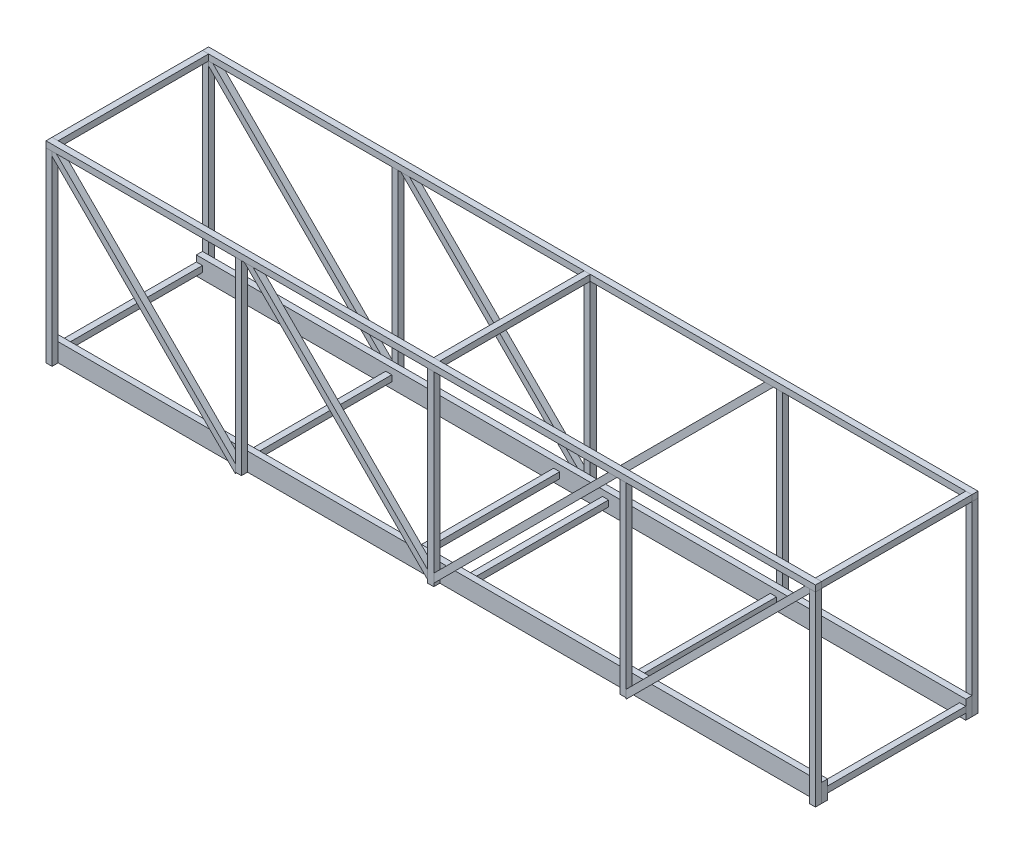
ISO-10303-21;
HEADER;
FILE_DESCRIPTION(('STEP AP214'),'2;1');
FILE_NAME('part.step','',(''),(''),'','','');
FILE_SCHEMA(('AUTOMOTIVE_DESIGN { 1 0 10303 214 1 1 1 1 }'));
ENDSEC;
DATA;
#1=APPLICATION_CONTEXT('core data for automotive mechanical design processes');
#2=APPLICATION_PROTOCOL_DEFINITION('international standard','automotive_design',2000,#1);
#3=PRODUCT_CONTEXT('',#1,'mechanical');
#4=PRODUCT('Part','Part','',(#3));
#5=PRODUCT_RELATED_PRODUCT_CATEGORY('part','',(#4));
#6=PRODUCT_DEFINITION_FORMATION('','',#4);
#7=PRODUCT_DEFINITION_CONTEXT('part definition',#1,'design');
#8=PRODUCT_DEFINITION('design','',#6,#7);
#9=PRODUCT_DEFINITION_SHAPE('','',#8);
#10=(LENGTH_UNIT() NAMED_UNIT(*) SI_UNIT(.MILLI.,.METRE.));
#11=(NAMED_UNIT(*) PLANE_ANGLE_UNIT() SI_UNIT($,.RADIAN.));
#12=(NAMED_UNIT(*) SI_UNIT($,.STERADIAN.) SOLID_ANGLE_UNIT());
#13=UNCERTAINTY_MEASURE_WITH_UNIT(LENGTH_MEASURE(1.E-05),#10,'distance_accuracy_value','');
#14=(GEOMETRIC_REPRESENTATION_CONTEXT(3) GLOBAL_UNCERTAINTY_ASSIGNED_CONTEXT((#13)) GLOBAL_UNIT_ASSIGNED_CONTEXT((#10,
#11,#12)) REPRESENTATION_CONTEXT('',''));
#15=CARTESIAN_POINT('',(0.,0.,0.));
#16=DIRECTION('',(0.,0.,1.));
#17=DIRECTION('',(1.,0.,0.));
#18=AXIS2_PLACEMENT_3D('',#15,#16,#17);
#19=CARTESIAN_POINT('',(-1.5875,92.0625,-39.0875));
#20=DIRECTION('',(1.,0.,0.));
#21=DIRECTION('',(0.,0.,-1.));
#22=AXIS2_PLACEMENT_3D('',#19,#20,#21);
#23=PLANE('',#22);
#24=DIRECTION('',(0.,1.,0.));
#25=VECTOR('',#24,1.);
#26=CARTESIAN_POINT('',(-1.5875,92.0625,39.0875));
#27=LINE('',#26,#25);
#28=CARTESIAN_POINT('',(-1.5875,92.0625,39.0875));
#29=VERTEX_POINT('',#28);
#30=CARTESIAN_POINT('',(-1.5875,95.2375,39.0875));
#31=VERTEX_POINT('',#30);
#32=EDGE_CURVE('E596',#29,#31,#27,.T.);
#33=ORIENTED_EDGE('',*,*,#32,.T.);
#34=DIRECTION('',(0.,0.,1.));
#35=VECTOR('',#34,1.);
#36=CARTESIAN_POINT('',(-1.5875,95.2375,-39.0875));
#37=LINE('',#36,#35);
#38=CARTESIAN_POINT('',(-1.5875,95.2375,-39.0875));
#39=VERTEX_POINT('',#38);
#40=EDGE_CURVE('E13',#39,#31,#37,.T.);
#41=ORIENTED_EDGE('',*,*,#40,.F.);
#42=DIRECTION('',(0.,1.,0.));
#43=VECTOR('',#42,1.);
#44=CARTESIAN_POINT('',(-1.5875,92.0625,-39.0875));
#45=LINE('',#44,#43);
#46=CARTESIAN_POINT('',(-1.5875,92.0625,-39.0875));
#47=VERTEX_POINT('',#46);
#48=EDGE_CURVE('E584',#47,#39,#45,.T.);
#49=ORIENTED_EDGE('',*,*,#48,.F.);
#50=DIRECTION('',(0.,0.,1.));
#51=VECTOR('',#50,1.);
#52=CARTESIAN_POINT('',(-1.5875,92.0625,-39.0875));
#53=LINE('',#52,#51);
#54=EDGE_CURVE('E592',#47,#29,#53,.T.);
#55=ORIENTED_EDGE('',*,*,#54,.T.);
#56=EDGE_LOOP('',(#33,#41,#49,#55));
#57=FACE_BOUND('',#56,.T.);
#58=ADVANCED_FACE('F533',(#57),#23,.F.);
#59=CARTESIAN_POINT('',(1.5875,95.2375,-39.0875));
#60=DIRECTION('',(0.,-1.,0.));
#61=DIRECTION('',(0.,0.,-1.));
#62=AXIS2_PLACEMENT_3D('',#59,#60,#61);
#63=PLANE('',#62);
#64=DIRECTION('',(1.,0.,0.));
#65=VECTOR('',#64,1.);
#66=CARTESIAN_POINT('',(1.5875,95.2375,39.0875));
#67=LINE('',#66,#65);
#68=CARTESIAN_POINT('',(1.5875,95.2375,39.0875));
#69=VERTEX_POINT('',#68);
#70=EDGE_CURVE('E588',#31,#69,#67,.T.);
#71=ORIENTED_EDGE('',*,*,#70,.T.);
#72=DIRECTION('',(0.,0.,1.));
#73=VECTOR('',#72,1.);
#74=CARTESIAN_POINT('',(1.5875,95.2375,-39.0875));
#75=LINE('',#74,#73);
#76=CARTESIAN_POINT('',(1.5875,95.2375,-39.0875));
#77=VERTEX_POINT('',#76);
#78=EDGE_CURVE('E541',#77,#69,#75,.T.);
#79=ORIENTED_EDGE('',*,*,#78,.F.);
#80=DIRECTION('',(1.,0.,0.));
#81=VECTOR('',#80,1.);
#82=CARTESIAN_POINT('',(1.5875,95.2375,-39.0875));
#83=LINE('',#82,#81);
#84=EDGE_CURVE('E579',#39,#77,#83,.T.);
#85=ORIENTED_EDGE('',*,*,#84,.F.);
#86=ORIENTED_EDGE('',*,*,#40,.T.);
#87=EDGE_LOOP('',(#71,#79,#85,#86));
#88=FACE_BOUND('',#87,.T.);
#89=ADVANCED_FACE('F587',(#88),#63,.F.);
#90=CARTESIAN_POINT('',(1.5875,92.0625,-39.0875));
#91=DIRECTION('',(-1.,0.,0.));
#92=DIRECTION('',(0.,0.,1.));
#93=AXIS2_PLACEMENT_3D('',#90,#91,#92);
#94=PLANE('',#93);
#95=DIRECTION('',(0.,-1.,0.));
#96=VECTOR('',#95,1.);
#97=CARTESIAN_POINT('',(1.5875,92.0625,39.0875));
#98=LINE('',#97,#96);
#99=CARTESIAN_POINT('',(1.5875,92.0625,39.0875));
#100=VERTEX_POINT('',#99);
#101=EDGE_CURVE('E566',#69,#100,#98,.T.);
#102=ORIENTED_EDGE('',*,*,#101,.T.);
#103=DIRECTION('',(0.,0.,1.));
#104=VECTOR('',#103,1.);
#105=CARTESIAN_POINT('',(1.5875,92.0625,-39.0875));
#106=LINE('',#105,#104);
#107=CARTESIAN_POINT('',(1.5875,92.0625,-39.0875));
#108=VERTEX_POINT('',#107);
#109=EDGE_CURVE('E589',#108,#100,#106,.T.);
#110=ORIENTED_EDGE('',*,*,#109,.F.);
#111=DIRECTION('',(0.,-1.,0.));
#112=VECTOR('',#111,1.);
#113=CARTESIAN_POINT('',(1.5875,92.0625,-39.0875));
#114=LINE('',#113,#112);
#115=EDGE_CURVE('E582',#77,#108,#114,.T.);
#116=ORIENTED_EDGE('',*,*,#115,.F.);
#117=ORIENTED_EDGE('',*,*,#78,.T.);
#118=EDGE_LOOP('',(#102,#110,#116,#117));
#119=FACE_BOUND('',#118,.T.);
#120=ADVANCED_FACE('F590',(#119),#94,.F.);
#121=CARTESIAN_POINT('',(1.5875,92.0625,-39.0875));
#122=DIRECTION('',(0.,1.,0.));
#123=DIRECTION('',(0.,0.,1.));
#124=AXIS2_PLACEMENT_3D('',#121,#122,#123);
#125=PLANE('',#124);
#126=DIRECTION('',(-1.,0.,0.));
#127=VECTOR('',#126,1.);
#128=CARTESIAN_POINT('',(1.5875,92.0625,39.0875));
#129=LINE('',#128,#127);
#130=EDGE_CURVE('E572',#100,#29,#129,.T.);
#131=ORIENTED_EDGE('',*,*,#130,.T.);
#132=ORIENTED_EDGE('',*,*,#54,.F.);
#133=DIRECTION('',(-1.,0.,0.));
#134=VECTOR('',#133,1.);
#135=CARTESIAN_POINT('',(1.5875,92.0625,-39.0875));
#136=LINE('',#135,#134);
#137=EDGE_CURVE('E549',#108,#47,#136,.T.);
#138=ORIENTED_EDGE('',*,*,#137,.F.);
#139=ORIENTED_EDGE('',*,*,#109,.T.);
#140=EDGE_LOOP('',(#131,#132,#138,#139));
#141=FACE_BOUND('',#140,.T.);
#142=ADVANCED_FACE('F603',(#141),#125,.F.);
#143=CARTESIAN_POINT('',(-1.5875,95.2375,-39.0875));
#144=DIRECTION('',(0.,0.,1.));
#145=DIRECTION('',(1.,0.,0.));
#146=AXIS2_PLACEMENT_3D('',#143,#144,#145);
#147=PLANE('',#146);
#148=ORIENTED_EDGE('',*,*,#48,.T.);
#149=ORIENTED_EDGE('',*,*,#84,.T.);
#150=ORIENTED_EDGE('',*,*,#115,.T.);
#151=ORIENTED_EDGE('',*,*,#137,.T.);
#152=EDGE_LOOP('',(#148,#149,#150,#151));
#153=FACE_BOUND('',#152,.T.);
#154=ADVANCED_FACE('F580',(#153),#147,.F.);
#155=CARTESIAN_POINT('',(-1.5875,95.2375,39.0875));
#156=DIRECTION('',(0.,0.,1.));
#157=DIRECTION('',(1.,0.,0.));
#158=AXIS2_PLACEMENT_3D('',#155,#156,#157);
#159=PLANE('',#158);
#160=ORIENTED_EDGE('',*,*,#32,.F.);
#161=ORIENTED_EDGE('',*,*,#130,.F.);
#162=ORIENTED_EDGE('',*,*,#101,.F.);
#163=ORIENTED_EDGE('',*,*,#70,.F.);
#164=EDGE_LOOP('',(#160,#161,#162,#163));
#165=FACE_BOUND('',#164,.T.);
#166=ADVANCED_FACE('F606',(#165),#159,.T.);
#167=CLOSED_SHELL('',(#58,#89,#120,#142,#154,#166));
#168=MANIFOLD_SOLID_BREP('B2',#167);
#169=CARTESIAN_POINT('',(-200.,92.0624999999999,-39.0875));
#170=DIRECTION('',(1.,0.,0.));
#171=DIRECTION('',(0.,0.,-1.));
#172=AXIS2_PLACEMENT_3D('',#169,#170,#171);
#173=PLANE('',#172);
#174=DIRECTION('',(0.,1.,0.));
#175=VECTOR('',#174,1.);
#176=CARTESIAN_POINT('',(-200.,92.0624999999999,39.0875));
#177=LINE('',#176,#175);
#178=CARTESIAN_POINT('',(-200.,92.0624999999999,39.0875));
#179=VERTEX_POINT('',#178);
#180=CARTESIAN_POINT('',(-200.,95.2374999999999,39.0875));
#181=VERTEX_POINT('',#180);
#182=EDGE_CURVE('E741',#179,#181,#177,.T.);
#183=ORIENTED_EDGE('',*,*,#182,.T.);
#184=DIRECTION('',(0.,0.,1.));
#185=VECTOR('',#184,1.);
#186=CARTESIAN_POINT('',(-200.,95.2374999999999,-39.0875));
#187=LINE('',#186,#185);
#188=CARTESIAN_POINT('',(-200.,95.2374999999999,-39.0875));
#189=VERTEX_POINT('',#188);
#190=EDGE_CURVE('E531',#189,#181,#187,.T.);
#191=ORIENTED_EDGE('',*,*,#190,.F.);
#192=DIRECTION('',(0.,1.,0.));
#193=VECTOR('',#192,1.);
#194=CARTESIAN_POINT('',(-200.,92.0624999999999,-39.0875));
#195=LINE('',#194,#193);
#196=CARTESIAN_POINT('',(-200.,92.0624999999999,-39.0875));
#197=VERTEX_POINT('',#196);
#198=EDGE_CURVE('E729',#197,#189,#195,.T.);
#199=ORIENTED_EDGE('',*,*,#198,.F.);
#200=DIRECTION('',(0.,0.,1.));
#201=VECTOR('',#200,1.);
#202=CARTESIAN_POINT('',(-200.,92.0624999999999,-39.0875));
#203=LINE('',#202,#201);
#204=EDGE_CURVE('E737',#197,#179,#203,.T.);
#205=ORIENTED_EDGE('',*,*,#204,.T.);
#206=EDGE_LOOP('',(#183,#191,#199,#205));
#207=FACE_BOUND('',#206,.T.);
#208=ADVANCED_FACE('F678',(#207),#173,.F.);
#209=CARTESIAN_POINT('',(-196.825,95.2374999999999,-39.0875));
#210=DIRECTION('',(0.,-1.,0.));
#211=DIRECTION('',(0.,0.,-1.));
#212=AXIS2_PLACEMENT_3D('',#209,#210,#211);
#213=PLANE('',#212);
#214=DIRECTION('',(1.,0.,0.));
#215=VECTOR('',#214,1.);
#216=CARTESIAN_POINT('',(-196.825,95.2374999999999,39.0875));
#217=LINE('',#216,#215);
#218=CARTESIAN_POINT('',(-196.825,95.2374999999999,39.0875));
#219=VERTEX_POINT('',#218);
#220=EDGE_CURVE('E733',#181,#219,#217,.T.);
#221=ORIENTED_EDGE('',*,*,#220,.T.);
#222=DIRECTION('',(0.,0.,1.));
#223=VECTOR('',#222,1.);
#224=CARTESIAN_POINT('',(-196.825,95.2374999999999,-39.0875));
#225=LINE('',#224,#223);
#226=CARTESIAN_POINT('',(-196.825,95.2374999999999,-39.0875));
#227=VERTEX_POINT('',#226);
#228=EDGE_CURVE('E686',#227,#219,#225,.T.);
#229=ORIENTED_EDGE('',*,*,#228,.F.);
#230=DIRECTION('',(1.,0.,0.));
#231=VECTOR('',#230,1.);
#232=CARTESIAN_POINT('',(-196.825,95.2374999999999,-39.0875));
#233=LINE('',#232,#231);
#234=EDGE_CURVE('E724',#189,#227,#233,.T.);
#235=ORIENTED_EDGE('',*,*,#234,.F.);
#236=ORIENTED_EDGE('',*,*,#190,.T.);
#237=EDGE_LOOP('',(#221,#229,#235,#236));
#238=FACE_BOUND('',#237,.T.);
#239=ADVANCED_FACE('F732',(#238),#213,.F.);
#240=CARTESIAN_POINT('',(-196.825,92.0624999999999,-39.0875));
#241=DIRECTION('',(-1.,0.,0.));
#242=DIRECTION('',(0.,0.,1.));
#243=AXIS2_PLACEMENT_3D('',#240,#241,#242);
#244=PLANE('',#243);
#245=DIRECTION('',(0.,-1.,0.));
#246=VECTOR('',#245,1.);
#247=CARTESIAN_POINT('',(-196.825,92.0624999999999,39.0875));
#248=LINE('',#247,#246);
#249=CARTESIAN_POINT('',(-196.825,92.0624999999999,39.0875));
#250=VERTEX_POINT('',#249);
#251=EDGE_CURVE('E711',#219,#250,#248,.T.);
#252=ORIENTED_EDGE('',*,*,#251,.T.);
#253=DIRECTION('',(0.,0.,1.));
#254=VECTOR('',#253,1.);
#255=CARTESIAN_POINT('',(-196.825,92.0624999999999,-39.0875));
#256=LINE('',#255,#254);
#257=CARTESIAN_POINT('',(-196.825,92.0624999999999,-39.0875));
#258=VERTEX_POINT('',#257);
#259=EDGE_CURVE('E734',#258,#250,#256,.T.);
#260=ORIENTED_EDGE('',*,*,#259,.F.);
#261=DIRECTION('',(0.,-1.,0.));
#262=VECTOR('',#261,1.);
#263=CARTESIAN_POINT('',(-196.825,92.0624999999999,-39.0875));
#264=LINE('',#263,#262);
#265=EDGE_CURVE('E727',#227,#258,#264,.T.);
#266=ORIENTED_EDGE('',*,*,#265,.F.);
#267=ORIENTED_EDGE('',*,*,#228,.T.);
#268=EDGE_LOOP('',(#252,#260,#266,#267));
#269=FACE_BOUND('',#268,.T.);
#270=ADVANCED_FACE('F735',(#269),#244,.F.);
#271=CARTESIAN_POINT('',(-196.825,92.0624999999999,-39.0875));
#272=DIRECTION('',(0.,1.,0.));
#273=DIRECTION('',(0.,0.,1.));
#274=AXIS2_PLACEMENT_3D('',#271,#272,#273);
#275=PLANE('',#274);
#276=DIRECTION('',(-1.,0.,0.));
#277=VECTOR('',#276,1.);
#278=CARTESIAN_POINT('',(-196.825,92.0624999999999,39.0875));
#279=LINE('',#278,#277);
#280=EDGE_CURVE('E717',#250,#179,#279,.T.);
#281=ORIENTED_EDGE('',*,*,#280,.T.);
#282=ORIENTED_EDGE('',*,*,#204,.F.);
#283=DIRECTION('',(-1.,0.,0.));
#284=VECTOR('',#283,1.);
#285=CARTESIAN_POINT('',(-196.825,92.0624999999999,-39.0875));
#286=LINE('',#285,#284);
#287=EDGE_CURVE('E694',#258,#197,#286,.T.);
#288=ORIENTED_EDGE('',*,*,#287,.F.);
#289=ORIENTED_EDGE('',*,*,#259,.T.);
#290=EDGE_LOOP('',(#281,#282,#288,#289));
#291=FACE_BOUND('',#290,.T.);
#292=ADVANCED_FACE('F748',(#291),#275,.F.);
#293=CARTESIAN_POINT('',(-200.,95.2374999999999,-39.0875));
#294=DIRECTION('',(0.,0.,1.));
#295=DIRECTION('',(1.,0.,0.));
#296=AXIS2_PLACEMENT_3D('',#293,#294,#295);
#297=PLANE('',#296);
#298=ORIENTED_EDGE('',*,*,#198,.T.);
#299=ORIENTED_EDGE('',*,*,#234,.T.);
#300=ORIENTED_EDGE('',*,*,#265,.T.);
#301=ORIENTED_EDGE('',*,*,#287,.T.);
#302=EDGE_LOOP('',(#298,#299,#300,#301));
#303=FACE_BOUND('',#302,.T.);
#304=ADVANCED_FACE('F725',(#303),#297,.F.);
#305=CARTESIAN_POINT('',(-200.,95.2374999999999,39.0875));
#306=DIRECTION('',(0.,0.,1.));
#307=DIRECTION('',(1.,0.,0.));
#308=AXIS2_PLACEMENT_3D('',#305,#306,#307);
#309=PLANE('',#308);
#310=ORIENTED_EDGE('',*,*,#182,.F.);
#311=ORIENTED_EDGE('',*,*,#280,.F.);
#312=ORIENTED_EDGE('',*,*,#251,.F.);
#313=ORIENTED_EDGE('',*,*,#220,.F.);
#314=EDGE_LOOP('',(#310,#311,#312,#313));
#315=FACE_BOUND('',#314,.T.);
#316=ADVANCED_FACE('F751',(#315),#309,.T.);
#317=CLOSED_SHELL('',(#208,#239,#270,#292,#304,#316));
#318=MANIFOLD_SOLID_BREP('B7',#317);
#319=CARTESIAN_POINT('',(196.825,92.0624999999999,-39.0875));
#320=DIRECTION('',(1.,0.,0.));
#321=DIRECTION('',(0.,0.,-1.));
#322=AXIS2_PLACEMENT_3D('',#319,#320,#321);
#323=PLANE('',#322);
#324=DIRECTION('',(0.,1.,0.));
#325=VECTOR('',#324,1.);
#326=CARTESIAN_POINT('',(196.825,92.0624999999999,39.0875));
#327=LINE('',#326,#325);
#328=CARTESIAN_POINT('',(196.825,92.0624999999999,39.0875));
#329=VERTEX_POINT('',#328);
#330=CARTESIAN_POINT('',(196.825,95.2374999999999,39.0875));
#331=VERTEX_POINT('',#330);
#332=EDGE_CURVE('E886',#329,#331,#327,.T.);
#333=ORIENTED_EDGE('',*,*,#332,.T.);
#334=DIRECTION('',(0.,0.,1.));
#335=VECTOR('',#334,1.);
#336=CARTESIAN_POINT('',(196.825,95.2374999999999,-39.0875));
#337=LINE('',#336,#335);
#338=CARTESIAN_POINT('',(196.825,95.2374999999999,-39.0875));
#339=VERTEX_POINT('',#338);
#340=EDGE_CURVE('E676',#339,#331,#337,.T.);
#341=ORIENTED_EDGE('',*,*,#340,.F.);
#342=DIRECTION('',(0.,1.,0.));
#343=VECTOR('',#342,1.);
#344=CARTESIAN_POINT('',(196.825,92.0624999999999,-39.0875));
#345=LINE('',#344,#343);
#346=CARTESIAN_POINT('',(196.825,92.0624999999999,-39.0875));
#347=VERTEX_POINT('',#346);
#348=EDGE_CURVE('E874',#347,#339,#345,.T.);
#349=ORIENTED_EDGE('',*,*,#348,.F.);
#350=DIRECTION('',(0.,0.,1.));
#351=VECTOR('',#350,1.);
#352=CARTESIAN_POINT('',(196.825,92.0624999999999,-39.0875));
#353=LINE('',#352,#351);
#354=EDGE_CURVE('E882',#347,#329,#353,.T.);
#355=ORIENTED_EDGE('',*,*,#354,.T.);
#356=EDGE_LOOP('',(#333,#341,#349,#355));
#357=FACE_BOUND('',#356,.T.);
#358=ADVANCED_FACE('F823',(#357),#323,.F.);
#359=CARTESIAN_POINT('',(200.,95.2374999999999,-39.0875));
#360=DIRECTION('',(0.,-1.,0.));
#361=DIRECTION('',(0.,0.,-1.));
#362=AXIS2_PLACEMENT_3D('',#359,#360,#361);
#363=PLANE('',#362);
#364=DIRECTION('',(1.,0.,0.));
#365=VECTOR('',#364,1.);
#366=CARTESIAN_POINT('',(200.,95.2374999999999,39.0875));
#367=LINE('',#366,#365);
#368=CARTESIAN_POINT('',(200.,95.2374999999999,39.0875));
#369=VERTEX_POINT('',#368);
#370=EDGE_CURVE('E878',#331,#369,#367,.T.);
#371=ORIENTED_EDGE('',*,*,#370,.T.);
#372=DIRECTION('',(0.,0.,1.));
#373=VECTOR('',#372,1.);
#374=CARTESIAN_POINT('',(200.,95.2374999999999,-39.0875));
#375=LINE('',#374,#373);
#376=CARTESIAN_POINT('',(200.,95.2374999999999,-39.0875));
#377=VERTEX_POINT('',#376);
#378=EDGE_CURVE('E831',#377,#369,#375,.T.);
#379=ORIENTED_EDGE('',*,*,#378,.F.);
#380=DIRECTION('',(1.,0.,0.));
#381=VECTOR('',#380,1.);
#382=CARTESIAN_POINT('',(200.,95.2374999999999,-39.0875));
#383=LINE('',#382,#381);
#384=EDGE_CURVE('E869',#339,#377,#383,.T.);
#385=ORIENTED_EDGE('',*,*,#384,.F.);
#386=ORIENTED_EDGE('',*,*,#340,.T.);
#387=EDGE_LOOP('',(#371,#379,#385,#386));
#388=FACE_BOUND('',#387,.T.);
#389=ADVANCED_FACE('F877',(#388),#363,.F.);
#390=CARTESIAN_POINT('',(200.,92.0624999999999,-39.0875));
#391=DIRECTION('',(-1.,0.,0.));
#392=DIRECTION('',(0.,0.,1.));
#393=AXIS2_PLACEMENT_3D('',#390,#391,#392);
#394=PLANE('',#393);
#395=DIRECTION('',(0.,-1.,0.));
#396=VECTOR('',#395,1.);
#397=CARTESIAN_POINT('',(200.,92.0624999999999,39.0875));
#398=LINE('',#397,#396);
#399=CARTESIAN_POINT('',(200.,92.0624999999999,39.0875));
#400=VERTEX_POINT('',#399);
#401=EDGE_CURVE('E856',#369,#400,#398,.T.);
#402=ORIENTED_EDGE('',*,*,#401,.T.);
#403=DIRECTION('',(0.,0.,1.));
#404=VECTOR('',#403,1.);
#405=CARTESIAN_POINT('',(200.,92.0624999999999,-39.0875));
#406=LINE('',#405,#404);
#407=CARTESIAN_POINT('',(200.,92.0624999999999,-39.0875));
#408=VERTEX_POINT('',#407);
#409=EDGE_CURVE('E879',#408,#400,#406,.T.);
#410=ORIENTED_EDGE('',*,*,#409,.F.);
#411=DIRECTION('',(0.,-1.,0.));
#412=VECTOR('',#411,1.);
#413=CARTESIAN_POINT('',(200.,92.0624999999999,-39.0875));
#414=LINE('',#413,#412);
#415=EDGE_CURVE('E872',#377,#408,#414,.T.);
#416=ORIENTED_EDGE('',*,*,#415,.F.);
#417=ORIENTED_EDGE('',*,*,#378,.T.);
#418=EDGE_LOOP('',(#402,#410,#416,#417));
#419=FACE_BOUND('',#418,.T.);
#420=ADVANCED_FACE('F880',(#419),#394,.F.);
#421=CARTESIAN_POINT('',(200.,92.0624999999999,-39.0875));
#422=DIRECTION('',(0.,1.,0.));
#423=DIRECTION('',(0.,0.,1.));
#424=AXIS2_PLACEMENT_3D('',#421,#422,#423);
#425=PLANE('',#424);
#426=DIRECTION('',(-1.,0.,0.));
#427=VECTOR('',#426,1.);
#428=CARTESIAN_POINT('',(200.,92.0624999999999,39.0875));
#429=LINE('',#428,#427);
#430=EDGE_CURVE('E862',#400,#329,#429,.T.);
#431=ORIENTED_EDGE('',*,*,#430,.T.);
#432=ORIENTED_EDGE('',*,*,#354,.F.);
#433=DIRECTION('',(-1.,0.,0.));
#434=VECTOR('',#433,1.);
#435=CARTESIAN_POINT('',(200.,92.0624999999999,-39.0875));
#436=LINE('',#435,#434);
#437=EDGE_CURVE('E839',#408,#347,#436,.T.);
#438=ORIENTED_EDGE('',*,*,#437,.F.);
#439=ORIENTED_EDGE('',*,*,#409,.T.);
#440=EDGE_LOOP('',(#431,#432,#438,#439));
#441=FACE_BOUND('',#440,.T.);
#442=ADVANCED_FACE('F893',(#441),#425,.F.);
#443=CARTESIAN_POINT('',(196.825,95.2374999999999,-39.0875));
#444=DIRECTION('',(0.,0.,1.));
#445=DIRECTION('',(1.,0.,0.));
#446=AXIS2_PLACEMENT_3D('',#443,#444,#445);
#447=PLANE('',#446);
#448=ORIENTED_EDGE('',*,*,#348,.T.);
#449=ORIENTED_EDGE('',*,*,#384,.T.);
#450=ORIENTED_EDGE('',*,*,#415,.T.);
#451=ORIENTED_EDGE('',*,*,#437,.T.);
#452=EDGE_LOOP('',(#448,#449,#450,#451));
#453=FACE_BOUND('',#452,.T.);
#454=ADVANCED_FACE('F870',(#453),#447,.F.);
#455=CARTESIAN_POINT('',(196.825,95.2374999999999,39.0875));
#456=DIRECTION('',(0.,0.,1.));
#457=DIRECTION('',(1.,0.,0.));
#458=AXIS2_PLACEMENT_3D('',#455,#456,#457);
#459=PLANE('',#458);
#460=ORIENTED_EDGE('',*,*,#332,.F.);
#461=ORIENTED_EDGE('',*,*,#430,.F.);
#462=ORIENTED_EDGE('',*,*,#401,.F.);
#463=ORIENTED_EDGE('',*,*,#370,.F.);
#464=EDGE_LOOP('',(#460,#461,#462,#463));
#465=FACE_BOUND('',#464,.T.);
#466=ADVANCED_FACE('F896',(#465),#459,.T.);
#467=CLOSED_SHELL('',(#358,#389,#420,#442,#454,#466));
#468=MANIFOLD_SOLID_BREP('B525',#467);
#469=CARTESIAN_POINT('',(198.877467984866,96.3600320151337,-39.0875));
#470=DIRECTION('',(0.,0.,-1.));
#471=DIRECTION('',(-1.,0.,0.));
#472=AXIS2_PLACEMENT_3D('',#469,#470,#471);
#473=PLANE('',#472);
#474=DIRECTION('',(0.,1.,0.));
#475=VECTOR('',#474,1.);
#476=CARTESIAN_POINT('',(101.5875,96.3600320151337,-39.0875));
#477=LINE('',#476,#475);
#478=CARTESIAN_POINT('',(101.5875,-5.42006403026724,-39.0875));
#479=VERTEX_POINT('',#478);
#480=CARTESIAN_POINT('',(101.5875,-0.929935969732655,-39.0875));
#481=VERTEX_POINT('',#480);
#482=EDGE_CURVE('E821',#479,#481,#477,.T.);
#483=ORIENTED_EDGE('',*,*,#482,.F.);
#484=DIRECTION('',(-0.707106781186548,-0.707106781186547,0.));
#485=VECTOR('',#484,1.);
#486=CARTESIAN_POINT('',(201.122532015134,94.1149679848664,-39.0875));
#487=LINE('',#486,#485);
#488=CARTESIAN_POINT('',(196.825,89.8174359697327,-39.0875));
#489=VERTEX_POINT('',#488);
#490=EDGE_CURVE('E1047',#489,#479,#487,.T.);
#491=ORIENTED_EDGE('',*,*,#490,.F.);
#492=DIRECTION('',(0.,-1.,0.));
#493=VECTOR('',#492,1.);
#494=CARTESIAN_POINT('',(196.825,95.2375,-39.0875));
#495=LINE('',#494,#493);
#496=CARTESIAN_POINT('',(196.825,92.0624999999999,-39.0875));
#497=VERTEX_POINT('',#496);
#498=EDGE_CURVE('E1024',#497,#489,#495,.T.);
#499=ORIENTED_EDGE('',*,*,#498,.F.);
#500=DIRECTION('',(-1.,0.,0.));
#501=VECTOR('',#500,1.);
#502=CARTESIAN_POINT('',(200.,92.0624999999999,-39.0875));
#503=LINE('',#502,#501);
#504=CARTESIAN_POINT('',(194.579935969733,92.0624999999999,-39.0875));
#505=VERTEX_POINT('',#504);
#506=EDGE_CURVE('E1028',#497,#505,#503,.T.);
#507=ORIENTED_EDGE('',*,*,#506,.T.);
#508=DIRECTION('',(-0.707106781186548,-0.707106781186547,0.));
#509=VECTOR('',#508,1.);
#510=CARTESIAN_POINT('',(198.877467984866,96.3600320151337,-39.0875));
#511=LINE('',#510,#509);
#512=EDGE_CURVE('E1050',#505,#481,#511,.T.);
#513=ORIENTED_EDGE('',*,*,#512,.T.);
#514=EDGE_LOOP('',(#483,#491,#499,#507,#513));
#515=FACE_BOUND('',#514,.T.);
#516=ADVANCED_FACE('F968',(#515),#473,.F.);
#517=CARTESIAN_POINT('',(198.877467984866,96.3600320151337,-39.0875));
#518=DIRECTION('',(0.707106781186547,-0.707106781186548,0.));
#519=DIRECTION('',(0.707106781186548,0.707106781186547,0.));
#520=AXIS2_PLACEMENT_3D('',#517,#518,#519);
#521=PLANE('',#520);
#522=DIRECTION('',(0.,0.,-1.));
#523=VECTOR('',#522,1.);
#524=CARTESIAN_POINT('',(101.5875,-0.929935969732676,-39.0875));
#525=LINE('',#524,#523);
#526=CARTESIAN_POINT('',(101.5875,-0.929935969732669,-42.2625));
#527=VERTEX_POINT('',#526);
#528=EDGE_CURVE('E1043',#481,#527,#525,.T.);
#529=ORIENTED_EDGE('',*,*,#528,.F.);
#530=ORIENTED_EDGE('',*,*,#512,.F.);
#531=DIRECTION('',(0.,0.,1.));
#532=VECTOR('',#531,1.);
#533=CARTESIAN_POINT('',(194.579935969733,92.0624999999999,-39.0875));
#534=LINE('',#533,#532);
#535=CARTESIAN_POINT('',(194.579935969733,92.0624999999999,-42.2625));
#536=VERTEX_POINT('',#535);
#537=EDGE_CURVE('E990',#536,#505,#534,.T.);
#538=ORIENTED_EDGE('',*,*,#537,.F.);
#539=DIRECTION('',(-0.707106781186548,-0.707106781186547,0.));
#540=VECTOR('',#539,1.);
#541=CARTESIAN_POINT('',(198.877467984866,96.3600320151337,-42.2625));
#542=LINE('',#541,#540);
#543=EDGE_CURVE('E1035',#536,#527,#542,.T.);
#544=ORIENTED_EDGE('',*,*,#543,.T.);
#545=EDGE_LOOP('',(#529,#530,#538,#544));
#546=FACE_BOUND('',#545,.T.);
#547=ADVANCED_FACE('F1060',(#546),#521,.F.);
#548=CARTESIAN_POINT('',(198.877467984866,96.3600320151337,-42.2625));
#549=DIRECTION('',(0.,0.,1.));
#550=DIRECTION('',(1.,0.,0.));
#551=AXIS2_PLACEMENT_3D('',#548,#549,#550);
#552=PLANE('',#551);
#553=DIRECTION('',(0.,-1.,0.));
#554=VECTOR('',#553,1.);
#555=CARTESIAN_POINT('',(101.5875,95.2375,-42.2625));
#556=LINE('',#555,#554);
#557=CARTESIAN_POINT('',(101.5875,-5.42006403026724,-42.2625));
#558=VERTEX_POINT('',#557);
#559=EDGE_CURVE('E1036',#527,#558,#556,.T.);
#560=ORIENTED_EDGE('',*,*,#559,.F.);
#561=ORIENTED_EDGE('',*,*,#543,.F.);
#562=DIRECTION('',(-1.,0.,0.));
#563=VECTOR('',#562,1.);
#564=CARTESIAN_POINT('',(200.,92.0624999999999,-42.2625));
#565=LINE('',#564,#563);
#566=CARTESIAN_POINT('',(196.825,92.0624999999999,-42.2625));
#567=VERTEX_POINT('',#566);
#568=EDGE_CURVE('E1027',#567,#536,#565,.T.);
#569=ORIENTED_EDGE('',*,*,#568,.F.);
#570=DIRECTION('',(0.,-1.,0.));
#571=VECTOR('',#570,1.);
#572=CARTESIAN_POINT('',(196.825,95.2375,-42.2625));
#573=LINE('',#572,#571);
#574=CARTESIAN_POINT('',(196.825,89.8174359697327,-42.2625));
#575=VERTEX_POINT('',#574);
#576=EDGE_CURVE('E1014',#567,#575,#573,.T.);
#577=ORIENTED_EDGE('',*,*,#576,.T.);
#578=DIRECTION('',(-0.707106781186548,-0.707106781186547,0.));
#579=VECTOR('',#578,1.);
#580=CARTESIAN_POINT('',(201.122532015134,94.1149679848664,-42.2625));
#581=LINE('',#580,#579);
#582=EDGE_CURVE('E976',#575,#558,#581,.T.);
#583=ORIENTED_EDGE('',*,*,#582,.T.);
#584=EDGE_LOOP('',(#560,#561,#569,#577,#583));
#585=FACE_BOUND('',#584,.T.);
#586=ADVANCED_FACE('F1033',(#585),#552,.F.);
#587=CARTESIAN_POINT('',(201.122532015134,94.1149679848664,-39.0875));
#588=DIRECTION('',(-0.707106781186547,0.707106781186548,0.));
#589=DIRECTION('',(-0.707106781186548,-0.707106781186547,0.));
#590=AXIS2_PLACEMENT_3D('',#587,#588,#589);
#591=PLANE('',#590);
#592=DIRECTION('',(0.,0.,-1.));
#593=VECTOR('',#592,1.);
#594=CARTESIAN_POINT('',(196.825,89.8174359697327,-39.0875));
#595=LINE('',#594,#593);
#596=EDGE_CURVE('E1019',#489,#575,#595,.T.);
#597=ORIENTED_EDGE('',*,*,#596,.F.);
#598=ORIENTED_EDGE('',*,*,#490,.T.);
#599=DIRECTION('',(0.,0.,1.));
#600=VECTOR('',#599,1.);
#601=CARTESIAN_POINT('',(101.5875,-5.42006403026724,-39.0875));
#602=LINE('',#601,#600);
#603=EDGE_CURVE('E982',#558,#479,#602,.T.);
#604=ORIENTED_EDGE('',*,*,#603,.F.);
#605=ORIENTED_EDGE('',*,*,#582,.F.);
#606=EDGE_LOOP('',(#597,#598,#604,#605));
#607=FACE_BOUND('',#606,.T.);
#608=ADVANCED_FACE('F970',(#607),#591,.F.);
#609=CARTESIAN_POINT('',(200.,92.0624999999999,-39.0875));
#610=DIRECTION('',(0.,1.,0.));
#611=DIRECTION('',(0.,0.,1.));
#612=AXIS2_PLACEMENT_3D('',#609,#610,#611);
#613=PLANE('',#612);
#614=ORIENTED_EDGE('',*,*,#537,.T.);
#615=ORIENTED_EDGE('',*,*,#506,.F.);
#616=DIRECTION('',(0.,0.,1.));
#617=VECTOR('',#616,1.);
#618=CARTESIAN_POINT('',(196.825,92.0624999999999,-39.0875));
#619=LINE('',#618,#617);
#620=EDGE_CURVE('E1017',#567,#497,#619,.T.);
#621=ORIENTED_EDGE('',*,*,#620,.F.);
#622=ORIENTED_EDGE('',*,*,#568,.T.);
#623=EDGE_LOOP('',(#614,#615,#621,#622));
#624=FACE_BOUND('',#623,.T.);
#625=ADVANCED_FACE('F1026',(#624),#613,.T.);
#626=CARTESIAN_POINT('',(196.825,95.2375,-39.0875));
#627=DIRECTION('',(1.,0.,0.));
#628=DIRECTION('',(0.,0.,-1.));
#629=AXIS2_PLACEMENT_3D('',#626,#627,#628);
#630=PLANE('',#629);
#631=ORIENTED_EDGE('',*,*,#596,.T.);
#632=ORIENTED_EDGE('',*,*,#576,.F.);
#633=ORIENTED_EDGE('',*,*,#620,.T.);
#634=ORIENTED_EDGE('',*,*,#498,.T.);
#635=EDGE_LOOP('',(#631,#632,#633,#634));
#636=FACE_BOUND('',#635,.T.);
#637=ADVANCED_FACE('F1016',(#636),#630,.T.);
#638=CARTESIAN_POINT('',(101.5875,95.2375,-39.0875));
#639=DIRECTION('',(-1.,0.,0.));
#640=DIRECTION('',(0.,0.,1.));
#641=AXIS2_PLACEMENT_3D('',#638,#639,#640);
#642=PLANE('',#641);
#643=ORIENTED_EDGE('',*,*,#603,.T.);
#644=ORIENTED_EDGE('',*,*,#482,.T.);
#645=ORIENTED_EDGE('',*,*,#528,.T.);
#646=ORIENTED_EDGE('',*,*,#559,.T.);
#647=EDGE_LOOP('',(#643,#644,#645,#646));
#648=FACE_BOUND('',#647,.T.);
#649=ADVANCED_FACE('F1058',(#648),#642,.T.);
#650=CLOSED_SHELL('',(#516,#547,#586,#608,#625,#637,#649));
#651=MANIFOLD_SOLID_BREP('B670',#650);
#652=CARTESIAN_POINT('',(-201.122532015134,94.1149679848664,-39.0875));
#653=DIRECTION('',(0.,0.,-1.));
#654=DIRECTION('',(-1.,0.,0.));
#655=AXIS2_PLACEMENT_3D('',#652,#653,#654);
#656=PLANE('',#655);
#657=DIRECTION('',(0.,-1.,0.));
#658=VECTOR('',#657,1.);
#659=CARTESIAN_POINT('',(-101.5875,94.1149679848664,-39.0875));
#660=LINE('',#659,#658);
#661=CARTESIAN_POINT('',(-101.5875,-0.929935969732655,-39.0875));
#662=VERTEX_POINT('',#661);
#663=CARTESIAN_POINT('',(-101.5875,-5.42006403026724,-39.0875));
#664=VERTEX_POINT('',#663);
#665=EDGE_CURVE('E1151',#662,#664,#660,.T.);
#666=ORIENTED_EDGE('',*,*,#665,.F.);
#667=DIRECTION('',(0.707106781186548,-0.707106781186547,0.));
#668=VECTOR('',#667,1.);
#669=CARTESIAN_POINT('',(-198.877467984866,96.3600320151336,-39.0875));
#670=LINE('',#669,#668);
#671=CARTESIAN_POINT('',(-194.579935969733,92.0624999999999,-39.0875));
#672=VERTEX_POINT('',#671);
#673=EDGE_CURVE('E1213',#672,#662,#670,.T.);
#674=ORIENTED_EDGE('',*,*,#673,.F.);
#675=DIRECTION('',(1.,0.,0.));
#676=VECTOR('',#675,1.);
#677=CARTESIAN_POINT('',(-201.122532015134,92.0624999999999,-39.0875));
#678=LINE('',#677,#676);
#679=CARTESIAN_POINT('',(-196.825,92.0624999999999,-39.0875));
#680=VERTEX_POINT('',#679);
#681=EDGE_CURVE('E1200',#680,#672,#678,.T.);
#682=ORIENTED_EDGE('',*,*,#681,.F.);
#683=DIRECTION('',(0.,-1.,0.));
#684=VECTOR('',#683,1.);
#685=CARTESIAN_POINT('',(-196.825,95.2374999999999,-39.0875));
#686=LINE('',#685,#684);
#687=CARTESIAN_POINT('',(-196.825,89.8174359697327,-39.0875));
#688=VERTEX_POINT('',#687);
#689=EDGE_CURVE('E1199',#680,#688,#686,.T.);
#690=ORIENTED_EDGE('',*,*,#689,.T.);
#691=DIRECTION('',(0.707106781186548,-0.707106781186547,0.));
#692=VECTOR('',#691,1.);
#693=CARTESIAN_POINT('',(-201.122532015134,94.1149679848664,-39.0875));
#694=LINE('',#693,#692);
#695=EDGE_CURVE('E1145',#688,#664,#694,.T.);
#696=ORIENTED_EDGE('',*,*,#695,.T.);
#697=EDGE_LOOP('',(#666,#674,#682,#690,#696));
#698=FACE_BOUND('',#697,.T.);
#699=ADVANCED_FACE('F1141',(#698),#656,.F.);
#700=CARTESIAN_POINT('',(-201.122532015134,94.1149679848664,-39.0875));
#701=DIRECTION('',(0.707106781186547,0.707106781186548,0.));
#702=DIRECTION('',(-0.707106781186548,0.707106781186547,0.));
#703=AXIS2_PLACEMENT_3D('',#700,#701,#702);
#704=PLANE('',#703);
#705=DIRECTION('',(0.,0.,-1.));
#706=VECTOR('',#705,1.);
#707=CARTESIAN_POINT('',(-101.5875,-5.42006403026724,-39.0875));
#708=LINE('',#707,#706);
#709=CARTESIAN_POINT('',(-101.5875,-5.42006403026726,-42.2625));
#710=VERTEX_POINT('',#709);
#711=EDGE_CURVE('E966',#664,#710,#708,.T.);
#712=ORIENTED_EDGE('',*,*,#711,.F.);
#713=ORIENTED_EDGE('',*,*,#695,.F.);
#714=DIRECTION('',(0.,0.,1.));
#715=VECTOR('',#714,1.);
#716=CARTESIAN_POINT('',(-196.825,89.8174359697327,-39.0875));
#717=LINE('',#716,#715);
#718=CARTESIAN_POINT('',(-196.825,89.8174359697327,-42.2625));
#719=VERTEX_POINT('',#718);
#720=EDGE_CURVE('E1207',#719,#688,#717,.T.);
#721=ORIENTED_EDGE('',*,*,#720,.F.);
#722=DIRECTION('',(0.707106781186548,-0.707106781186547,0.));
#723=VECTOR('',#722,1.);
#724=CARTESIAN_POINT('',(-201.122532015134,94.1149679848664,-42.2625));
#725=LINE('',#724,#723);
#726=EDGE_CURVE('E1205',#719,#710,#725,.T.);
#727=ORIENTED_EDGE('',*,*,#726,.T.);
#728=EDGE_LOOP('',(#712,#713,#721,#727));
#729=FACE_BOUND('',#728,.T.);
#730=ADVANCED_FACE('F1225',(#729),#704,.F.);
#731=CARTESIAN_POINT('',(-201.122532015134,94.1149679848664,-42.2625));
#732=DIRECTION('',(0.,0.,1.));
#733=DIRECTION('',(1.,0.,0.));
#734=AXIS2_PLACEMENT_3D('',#731,#732,#733);
#735=PLANE('',#734);
#736=DIRECTION('',(0.,-1.,0.));
#737=VECTOR('',#736,1.);
#738=CARTESIAN_POINT('',(-101.5875,95.2375,-42.2625));
#739=LINE('',#738,#737);
#740=CARTESIAN_POINT('',(-101.5875,-0.929935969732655,-42.2625));
#741=VERTEX_POINT('',#740);
#742=EDGE_CURVE('E1159',#741,#710,#739,.T.);
#743=ORIENTED_EDGE('',*,*,#742,.T.);
#744=ORIENTED_EDGE('',*,*,#726,.F.);
#745=DIRECTION('',(0.,-1.,0.));
#746=VECTOR('',#745,1.);
#747=CARTESIAN_POINT('',(-196.825,95.2374999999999,-42.2625));
#748=LINE('',#747,#746);
#749=CARTESIAN_POINT('',(-196.825,92.0624999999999,-42.2625));
#750=VERTEX_POINT('',#749);
#751=EDGE_CURVE('E1196',#750,#719,#748,.T.);
#752=ORIENTED_EDGE('',*,*,#751,.F.);
#753=DIRECTION('',(-1.,0.,0.));
#754=VECTOR('',#753,1.);
#755=CARTESIAN_POINT('',(200.,92.0624999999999,-42.2625));
#756=LINE('',#755,#754);
#757=CARTESIAN_POINT('',(-194.579935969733,92.0624999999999,-42.2625));
#758=VERTEX_POINT('',#757);
#759=EDGE_CURVE('E1183',#758,#750,#756,.T.);
#760=ORIENTED_EDGE('',*,*,#759,.F.);
#761=DIRECTION('',(0.707106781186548,-0.707106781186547,0.));
#762=VECTOR('',#761,1.);
#763=CARTESIAN_POINT('',(-198.877467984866,96.3600320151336,-42.2625));
#764=LINE('',#763,#762);
#765=EDGE_CURVE('E1216',#758,#741,#764,.T.);
#766=ORIENTED_EDGE('',*,*,#765,.T.);
#767=EDGE_LOOP('',(#743,#744,#752,#760,#766));
#768=FACE_BOUND('',#767,.T.);
#769=ADVANCED_FACE('F1203',(#768),#735,.F.);
#770=CARTESIAN_POINT('',(-198.877467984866,96.3600320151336,-39.0875));
#771=DIRECTION('',(-0.707106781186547,-0.707106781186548,0.));
#772=DIRECTION('',(0.707106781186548,-0.707106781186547,0.));
#773=AXIS2_PLACEMENT_3D('',#770,#771,#772);
#774=PLANE('',#773);
#775=DIRECTION('',(0.,0.,1.));
#776=VECTOR('',#775,1.);
#777=CARTESIAN_POINT('',(-101.5875,-0.929935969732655,-39.0875));
#778=LINE('',#777,#776);
#779=EDGE_CURVE('E1206',#741,#662,#778,.T.);
#780=ORIENTED_EDGE('',*,*,#779,.F.);
#781=ORIENTED_EDGE('',*,*,#765,.F.);
#782=DIRECTION('',(0.,0.,-1.));
#783=VECTOR('',#782,1.);
#784=CARTESIAN_POINT('',(-194.579935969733,92.0624999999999,-39.0875));
#785=LINE('',#784,#783);
#786=EDGE_CURVE('E1180',#672,#758,#785,.T.);
#787=ORIENTED_EDGE('',*,*,#786,.F.);
#788=ORIENTED_EDGE('',*,*,#673,.T.);
#789=EDGE_LOOP('',(#780,#781,#787,#788));
#790=FACE_BOUND('',#789,.T.);
#791=ADVANCED_FACE('F1143',(#790),#774,.F.);
#792=CARTESIAN_POINT('',(200.,92.0624999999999,-39.0875));
#793=DIRECTION('',(0.,1.,0.));
#794=DIRECTION('',(0.,0.,1.));
#795=AXIS2_PLACEMENT_3D('',#792,#793,#794);
#796=PLANE('',#795);
#797=ORIENTED_EDGE('',*,*,#786,.T.);
#798=ORIENTED_EDGE('',*,*,#759,.T.);
#799=DIRECTION('',(0.,0.,1.));
#800=VECTOR('',#799,1.);
#801=CARTESIAN_POINT('',(-196.825,92.0624999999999,-39.0875));
#802=LINE('',#801,#800);
#803=EDGE_CURVE('E1186',#750,#680,#802,.T.);
#804=ORIENTED_EDGE('',*,*,#803,.T.);
#805=ORIENTED_EDGE('',*,*,#681,.T.);
#806=EDGE_LOOP('',(#797,#798,#804,#805));
#807=FACE_BOUND('',#806,.T.);
#808=ADVANCED_FACE('F1185',(#807),#796,.T.);
#809=CARTESIAN_POINT('',(-196.825,95.2374999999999,-39.0875));
#810=DIRECTION('',(-1.,0.,0.));
#811=DIRECTION('',(0.,-1.,0.));
#812=AXIS2_PLACEMENT_3D('',#809,#810,#811);
#813=PLANE('',#812);
#814=ORIENTED_EDGE('',*,*,#720,.T.);
#815=ORIENTED_EDGE('',*,*,#689,.F.);
#816=ORIENTED_EDGE('',*,*,#803,.F.);
#817=ORIENTED_EDGE('',*,*,#751,.T.);
#818=EDGE_LOOP('',(#814,#815,#816,#817));
#819=FACE_BOUND('',#818,.T.);
#820=ADVANCED_FACE('F1195',(#819),#813,.T.);
#821=CARTESIAN_POINT('',(-101.5875,95.2375,-39.0875));
#822=DIRECTION('',(1.,0.,0.));
#823=DIRECTION('',(0.,0.,-1.));
#824=AXIS2_PLACEMENT_3D('',#821,#822,#823);
#825=PLANE('',#824);
#826=ORIENTED_EDGE('',*,*,#779,.T.);
#827=ORIENTED_EDGE('',*,*,#665,.T.);
#828=ORIENTED_EDGE('',*,*,#711,.T.);
#829=ORIENTED_EDGE('',*,*,#742,.F.);
#830=EDGE_LOOP('',(#826,#827,#828,#829));
#831=FACE_BOUND('',#830,.T.);
#832=ADVANCED_FACE('F1227',(#831),#825,.T.);
#833=CLOSED_SHELL('',(#699,#730,#769,#791,#808,#820,#832));
#834=MANIFOLD_SOLID_BREP('B815',#833);
#835=CARTESIAN_POINT('',(-101.122532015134,-5.88503201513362,39.0875));
#836=DIRECTION('',(0.,0.,1.));
#837=DIRECTION('',(1.,0.,0.));
#838=AXIS2_PLACEMENT_3D('',#835,#836,#837);
#839=PLANE('',#838);
#840=DIRECTION('',(0.,1.,0.));
#841=VECTOR('',#840,1.);
#842=CARTESIAN_POINT('',(-101.5875,-5.88503201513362,39.0875));
#843=LINE('',#842,#841);
#844=CARTESIAN_POINT('',(-101.5875,-5.42006403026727,39.0875));
#845=VERTEX_POINT('',#844);
#846=CARTESIAN_POINT('',(-101.5875,-0.929935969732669,39.0875));
#847=VERTEX_POINT('',#846);
#848=EDGE_CURVE('E1139',#845,#847,#843,.T.);
#849=ORIENTED_EDGE('',*,*,#848,.F.);
#850=DIRECTION('',(-0.707106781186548,0.707106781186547,0.));
#851=VECTOR('',#850,1.);
#852=CARTESIAN_POINT('',(-101.122532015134,-5.88503201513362,39.0875));
#853=LINE('',#852,#851);
#854=CARTESIAN_POINT('',(-196.825,89.8174359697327,39.0875));
#855=VERTEX_POINT('',#854);
#856=EDGE_CURVE('E1318',#845,#855,#853,.T.);
#857=ORIENTED_EDGE('',*,*,#856,.T.);
#858=DIRECTION('',(0.,-1.,0.));
#859=VECTOR('',#858,1.);
#860=CARTESIAN_POINT('',(-196.825,95.2375,39.0875));
#861=LINE('',#860,#859);
#862=CARTESIAN_POINT('',(-196.825,92.0625,39.0875));
#863=VERTEX_POINT('',#862);
#864=EDGE_CURVE('E1378',#863,#855,#861,.T.);
#865=ORIENTED_EDGE('',*,*,#864,.F.);
#866=DIRECTION('',(-1.,0.,0.));
#867=VECTOR('',#866,1.);
#868=CARTESIAN_POINT('',(200.,92.0625,39.0875));
#869=LINE('',#868,#867);
#870=CARTESIAN_POINT('',(-194.579935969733,92.0625,39.0875));
#871=VERTEX_POINT('',#870);
#872=EDGE_CURVE('E1377',#871,#863,#869,.T.);
#873=ORIENTED_EDGE('',*,*,#872,.F.);
#874=DIRECTION('',(-0.707106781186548,0.707106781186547,0.));
#875=VECTOR('',#874,1.);
#876=CARTESIAN_POINT('',(-98.8774679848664,-3.63996798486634,39.0875));
#877=LINE('',#876,#875);
#878=EDGE_CURVE('E1376',#847,#871,#877,.T.);
#879=ORIENTED_EDGE('',*,*,#878,.F.);
#880=EDGE_LOOP('',(#849,#857,#865,#873,#879));
#881=FACE_BOUND('',#880,.T.);
#882=ADVANCED_FACE('F1314',(#881),#839,.F.);
#883=CARTESIAN_POINT('',(-101.122532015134,-5.88503201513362,39.0875));
#884=DIRECTION('',(0.707106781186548,0.707106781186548,0.));
#885=DIRECTION('',(-0.707106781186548,0.707106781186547,0.));
#886=AXIS2_PLACEMENT_3D('',#883,#884,#885);
#887=PLANE('',#886);
#888=DIRECTION('',(0.,0.,-1.));
#889=VECTOR('',#888,1.);
#890=CARTESIAN_POINT('',(-101.5875,-5.42006403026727,39.0875));
#891=LINE('',#890,#889);
#892=CARTESIAN_POINT('',(-101.5875,-5.42006403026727,42.2625));
#893=VERTEX_POINT('',#892);
#894=EDGE_CURVE('E1324',#893,#845,#891,.T.);
#895=ORIENTED_EDGE('',*,*,#894,.F.);
#896=DIRECTION('',(-0.707106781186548,0.707106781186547,0.));
#897=VECTOR('',#896,1.);
#898=CARTESIAN_POINT('',(-101.122532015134,-5.88503201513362,42.2625));
#899=LINE('',#898,#897);
#900=CARTESIAN_POINT('',(-196.825,89.8174359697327,42.2625));
#901=VERTEX_POINT('',#900);
#902=EDGE_CURVE('E1391',#893,#901,#899,.T.);
#903=ORIENTED_EDGE('',*,*,#902,.T.);
#904=DIRECTION('',(0.,0.,1.));
#905=VECTOR('',#904,1.);
#906=CARTESIAN_POINT('',(-196.825,89.8174359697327,39.0875));
#907=LINE('',#906,#905);
#908=EDGE_CURVE('E1382',#855,#901,#907,.T.);
#909=ORIENTED_EDGE('',*,*,#908,.F.);
#910=ORIENTED_EDGE('',*,*,#856,.F.);
#911=EDGE_LOOP('',(#895,#903,#909,#910));
#912=FACE_BOUND('',#911,.T.);
#913=ADVANCED_FACE('F1403',(#912),#887,.F.);
#914=CARTESIAN_POINT('',(-101.122532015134,-5.88503201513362,42.2625));
#915=DIRECTION('',(0.,0.,-1.));
#916=DIRECTION('',(-1.,0.,0.));
#917=AXIS2_PLACEMENT_3D('',#914,#915,#916);
#918=PLANE('',#917);
#919=DIRECTION('',(0.,1.,0.));
#920=VECTOR('',#919,1.);
#921=CARTESIAN_POINT('',(-101.5875,-4.76249999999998,42.2625));
#922=LINE('',#921,#920);
#923=CARTESIAN_POINT('',(-101.5875,-0.929935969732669,42.2625));
#924=VERTEX_POINT('',#923);
#925=EDGE_CURVE('E1362',#893,#924,#922,.T.);
#926=ORIENTED_EDGE('',*,*,#925,.T.);
#927=DIRECTION('',(-0.707106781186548,0.707106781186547,0.));
#928=VECTOR('',#927,1.);
#929=CARTESIAN_POINT('',(-98.8774679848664,-3.63996798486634,42.2625));
#930=LINE('',#929,#928);
#931=CARTESIAN_POINT('',(-194.579935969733,92.0625,42.2625));
#932=VERTEX_POINT('',#931);
#933=EDGE_CURVE('E1356',#924,#932,#930,.T.);
#934=ORIENTED_EDGE('',*,*,#933,.T.);
#935=DIRECTION('',(-1.,0.,0.));
#936=VECTOR('',#935,1.);
#937=CARTESIAN_POINT('',(200.,92.0625,42.2625));
#938=LINE('',#937,#936);
#939=CARTESIAN_POINT('',(-196.825,92.0625,42.2625));
#940=VERTEX_POINT('',#939);
#941=EDGE_CURVE('E1359',#932,#940,#938,.T.);
#942=ORIENTED_EDGE('',*,*,#941,.T.);
#943=DIRECTION('',(0.,-1.,0.));
#944=VECTOR('',#943,1.);
#945=CARTESIAN_POINT('',(-196.825,95.2375,42.2625));
#946=LINE('',#945,#944);
#947=EDGE_CURVE('E1372',#940,#901,#946,.T.);
#948=ORIENTED_EDGE('',*,*,#947,.T.);
#949=ORIENTED_EDGE('',*,*,#902,.F.);
#950=EDGE_LOOP('',(#926,#934,#942,#948,#949));
#951=FACE_BOUND('',#950,.T.);
#952=ADVANCED_FACE('F1357',(#951),#918,.F.);
#953=CARTESIAN_POINT('',(-98.8774679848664,-3.63996798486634,39.0875));
#954=DIRECTION('',(-0.707106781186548,-0.707106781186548,0.));
#955=DIRECTION('',(0.707106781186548,-0.707106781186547,0.));
#956=AXIS2_PLACEMENT_3D('',#953,#954,#955);
#957=PLANE('',#956);
#958=DIRECTION('',(0.,0.,1.));
#959=VECTOR('',#958,1.);
#960=CARTESIAN_POINT('',(-101.5875,-0.929935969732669,39.0875));
#961=LINE('',#960,#959);
#962=EDGE_CURVE('E1389',#847,#924,#961,.T.);
#963=ORIENTED_EDGE('',*,*,#962,.F.);
#964=ORIENTED_EDGE('',*,*,#878,.T.);
#965=DIRECTION('',(0.,0.,-1.));
#966=VECTOR('',#965,1.);
#967=CARTESIAN_POINT('',(-194.579935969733,92.0625,39.0875));
#968=LINE('',#967,#966);
#969=EDGE_CURVE('E1370',#932,#871,#968,.T.);
#970=ORIENTED_EDGE('',*,*,#969,.F.);
#971=ORIENTED_EDGE('',*,*,#933,.F.);
#972=EDGE_LOOP('',(#963,#964,#970,#971));
#973=FACE_BOUND('',#972,.T.);
#974=ADVANCED_FACE('F1374',(#973),#957,.F.);
#975=CARTESIAN_POINT('',(-196.825,95.2375,39.0875));
#976=DIRECTION('',(-1.,0.,0.));
#977=DIRECTION('',(0.,0.,1.));
#978=AXIS2_PLACEMENT_3D('',#975,#976,#977);
#979=PLANE('',#978);
#980=ORIENTED_EDGE('',*,*,#908,.T.);
#981=ORIENTED_EDGE('',*,*,#947,.F.);
#982=DIRECTION('',(0.,0.,1.));
#983=VECTOR('',#982,1.);
#984=CARTESIAN_POINT('',(-196.825,92.0625,39.0875));
#985=LINE('',#984,#983);
#986=EDGE_CURVE('E1333',#863,#940,#985,.T.);
#987=ORIENTED_EDGE('',*,*,#986,.F.);
#988=ORIENTED_EDGE('',*,*,#864,.T.);
#989=EDGE_LOOP('',(#980,#981,#987,#988));
#990=FACE_BOUND('',#989,.T.);
#991=ADVANCED_FACE('F1402',(#990),#979,.T.);
#992=CARTESIAN_POINT('',(200.,92.0625,39.0875));
#993=DIRECTION('',(0.,1.,0.));
#994=DIRECTION('',(0.,0.,1.));
#995=AXIS2_PLACEMENT_3D('',#992,#993,#994);
#996=PLANE('',#995);
#997=ORIENTED_EDGE('',*,*,#969,.T.);
#998=ORIENTED_EDGE('',*,*,#872,.T.);
#999=ORIENTED_EDGE('',*,*,#986,.T.);
#1000=ORIENTED_EDGE('',*,*,#941,.F.);
#1001=EDGE_LOOP('',(#997,#998,#999,#1000));
#1002=FACE_BOUND('',#1001,.T.);
#1003=ADVANCED_FACE('F1369',(#1002),#996,.T.);
#1004=CARTESIAN_POINT('',(-101.5875,-4.76249999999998,39.0875));
#1005=DIRECTION('',(1.,0.,0.));
#1006=DIRECTION('',(0.,1.,0.));
#1007=AXIS2_PLACEMENT_3D('',#1004,#1005,#1006);
#1008=PLANE('',#1007);
#1009=ORIENTED_EDGE('',*,*,#962,.T.);
#1010=ORIENTED_EDGE('',*,*,#925,.F.);
#1011=ORIENTED_EDGE('',*,*,#894,.T.);
#1012=ORIENTED_EDGE('',*,*,#848,.T.);
#1013=EDGE_LOOP('',(#1009,#1010,#1011,#1012));
#1014=FACE_BOUND('',#1013,.T.);
#1015=ADVANCED_FACE('F1316',(#1014),#1008,.T.);
#1016=CLOSED_SHELL('',(#882,#913,#952,#974,#991,#1003,#1015));
#1017=MANIFOLD_SOLID_BREP('B960',#1016);
#1018=CARTESIAN_POINT('',(201.122532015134,94.1149679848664,39.0875));
#1019=DIRECTION('',(0.,0.,1.));
#1020=DIRECTION('',(1.,0.,0.));
#1021=AXIS2_PLACEMENT_3D('',#1018,#1019,#1020);
#1022=PLANE('',#1021);
#1023=DIRECTION('',(0.,-1.,0.));
#1024=VECTOR('',#1023,1.);
#1025=CARTESIAN_POINT('',(101.5875,94.1149679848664,39.0875));
#1026=LINE('',#1025,#1024);
#1027=CARTESIAN_POINT('',(101.5875,-0.929935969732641,39.0875));
#1028=VERTEX_POINT('',#1027);
#1029=CARTESIAN_POINT('',(101.5875,-5.42006403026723,39.0875));
#1030=VERTEX_POINT('',#1029);
#1031=EDGE_CURVE('E1312',#1028,#1030,#1026,.T.);
#1032=ORIENTED_EDGE('',*,*,#1031,.F.);
#1033=DIRECTION('',(-0.707106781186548,-0.707106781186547,0.));
#1034=VECTOR('',#1033,1.);
#1035=CARTESIAN_POINT('',(198.877467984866,96.3600320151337,39.0875));
#1036=LINE('',#1035,#1034);
#1037=CARTESIAN_POINT('',(194.579935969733,92.0625,39.0875));
#1038=VERTEX_POINT('',#1037);
#1039=EDGE_CURVE('E1566',#1038,#1028,#1036,.T.);
#1040=ORIENTED_EDGE('',*,*,#1039,.F.);
#1041=DIRECTION('',(-1.,0.,0.));
#1042=VECTOR('',#1041,1.);
#1043=CARTESIAN_POINT('',(200.,92.0625,39.0875));
#1044=LINE('',#1043,#1042);
#1045=CARTESIAN_POINT('',(196.825,92.0625,39.0875));
#1046=VERTEX_POINT('',#1045);
#1047=EDGE_CURVE('E1549',#1046,#1038,#1044,.T.);
#1048=ORIENTED_EDGE('',*,*,#1047,.F.);
#1049=DIRECTION('',(0.,-1.,0.));
#1050=VECTOR('',#1049,1.);
#1051=CARTESIAN_POINT('',(196.825,95.2375,39.0875));
#1052=LINE('',#1051,#1050);
#1053=CARTESIAN_POINT('',(196.825,89.8174359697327,39.0875));
#1054=VERTEX_POINT('',#1053);
#1055=EDGE_CURVE('E1536',#1046,#1054,#1052,.T.);
#1056=ORIENTED_EDGE('',*,*,#1055,.T.);
#1057=DIRECTION('',(-0.707106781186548,-0.707106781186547,0.));
#1058=VECTOR('',#1057,1.);
#1059=CARTESIAN_POINT('',(201.122532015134,94.1149679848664,39.0875));
#1060=LINE('',#1059,#1058);
#1061=EDGE_CURVE('E1569',#1054,#1030,#1060,.T.);
#1062=ORIENTED_EDGE('',*,*,#1061,.T.);
#1063=EDGE_LOOP('',(#1032,#1040,#1048,#1056,#1062));
#1064=FACE_BOUND('',#1063,.T.);
#1065=ADVANCED_FACE('F1487',(#1064),#1022,.F.);
#1066=CARTESIAN_POINT('',(201.122532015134,94.1149679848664,39.0875));
#1067=DIRECTION('',(-0.707106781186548,0.707106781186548,0.));
#1068=DIRECTION('',(-0.707106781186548,-0.707106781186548,0.));
#1069=AXIS2_PLACEMENT_3D('',#1066,#1067,#1068);
#1070=PLANE('',#1069);
#1071=DIRECTION('',(0.,0.,1.));
#1072=VECTOR('',#1071,1.);
#1073=CARTESIAN_POINT('',(101.5875,-5.42006403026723,39.0875));
#1074=LINE('',#1073,#1072);
#1075=CARTESIAN_POINT('',(101.5875,-5.42006403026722,42.2625));
#1076=VERTEX_POINT('',#1075);
#1077=EDGE_CURVE('E1563',#1030,#1076,#1074,.T.);
#1078=ORIENTED_EDGE('',*,*,#1077,.F.);
#1079=ORIENTED_EDGE('',*,*,#1061,.F.);
#1080=DIRECTION('',(0.,0.,-1.));
#1081=VECTOR('',#1080,1.);
#1082=CARTESIAN_POINT('',(196.825,89.8174359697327,39.0875));
#1083=LINE('',#1082,#1081);
#1084=CARTESIAN_POINT('',(196.825,89.8174359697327,42.2625));
#1085=VERTEX_POINT('',#1084);
#1086=EDGE_CURVE('E1509',#1085,#1054,#1083,.T.);
#1087=ORIENTED_EDGE('',*,*,#1086,.F.);
#1088=DIRECTION('',(-0.707106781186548,-0.707106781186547,0.));
#1089=VECTOR('',#1088,1.);
#1090=CARTESIAN_POINT('',(201.122532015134,94.1149679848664,42.2625));
#1091=LINE('',#1090,#1089);
#1092=EDGE_CURVE('E1555',#1085,#1076,#1091,.T.);
#1093=ORIENTED_EDGE('',*,*,#1092,.T.);
#1094=EDGE_LOOP('',(#1078,#1079,#1087,#1093));
#1095=FACE_BOUND('',#1094,.T.);
#1096=ADVANCED_FACE('F1579',(#1095),#1070,.F.);
#1097=CARTESIAN_POINT('',(201.122532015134,94.1149679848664,42.2625));
#1098=DIRECTION('',(0.,0.,-1.));
#1099=DIRECTION('',(-1.,0.,0.));
#1100=AXIS2_PLACEMENT_3D('',#1097,#1098,#1099);
#1101=PLANE('',#1100);
#1102=DIRECTION('',(0.,1.,0.));
#1103=VECTOR('',#1102,1.);
#1104=CARTESIAN_POINT('',(101.5875,-4.76249999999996,42.2625));
#1105=LINE('',#1104,#1103);
#1106=CARTESIAN_POINT('',(101.5875,-0.929935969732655,42.2625));
#1107=VERTEX_POINT('',#1106);
#1108=EDGE_CURVE('E1539',#1076,#1107,#1105,.T.);
#1109=ORIENTED_EDGE('',*,*,#1108,.F.);
#1110=ORIENTED_EDGE('',*,*,#1092,.F.);
#1111=DIRECTION('',(0.,-1.,0.));
#1112=VECTOR('',#1111,1.);
#1113=CARTESIAN_POINT('',(196.825,95.2375,42.2625));
#1114=LINE('',#1113,#1112);
#1115=CARTESIAN_POINT('',(196.824999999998,92.0625,42.2625));
#1116=VERTEX_POINT('',#1115);
#1117=EDGE_CURVE('E1535',#1116,#1085,#1114,.T.);
#1118=ORIENTED_EDGE('',*,*,#1117,.F.);
#1119=DIRECTION('',(-1.,0.,0.));
#1120=VECTOR('',#1119,1.);
#1121=CARTESIAN_POINT('',(200.,92.0625,42.2625));
#1122=LINE('',#1121,#1120);
#1123=CARTESIAN_POINT('',(194.579935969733,92.0625,42.2625));
#1124=VERTEX_POINT('',#1123);
#1125=EDGE_CURVE('E1540',#1116,#1124,#1122,.T.);
#1126=ORIENTED_EDGE('',*,*,#1125,.T.);
#1127=DIRECTION('',(-0.707106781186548,-0.707106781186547,0.));
#1128=VECTOR('',#1127,1.);
#1129=CARTESIAN_POINT('',(198.877467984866,96.3600320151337,42.2625));
#1130=LINE('',#1129,#1128);
#1131=EDGE_CURVE('E1495',#1124,#1107,#1130,.T.);
#1132=ORIENTED_EDGE('',*,*,#1131,.T.);
#1133=EDGE_LOOP('',(#1109,#1110,#1118,#1126,#1132));
#1134=FACE_BOUND('',#1133,.T.);
#1135=ADVANCED_FACE('F1553',(#1134),#1101,.F.);
#1136=CARTESIAN_POINT('',(198.877467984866,96.3600320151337,39.0875));
#1137=DIRECTION('',(0.707106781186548,-0.707106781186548,0.));
#1138=DIRECTION('',(0.707106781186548,0.707106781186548,0.));
#1139=AXIS2_PLACEMENT_3D('',#1136,#1137,#1138);
#1140=PLANE('',#1139);
#1141=DIRECTION('',(0.,0.,-1.));
#1142=VECTOR('',#1141,1.);
#1143=CARTESIAN_POINT('',(101.5875,-0.929935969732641,39.0875));
#1144=LINE('',#1143,#1142);
#1145=EDGE_CURVE('E1501',#1107,#1028,#1144,.T.);
#1146=ORIENTED_EDGE('',*,*,#1145,.F.);
#1147=ORIENTED_EDGE('',*,*,#1131,.F.);
#1148=DIRECTION('',(0.,0.,1.));
#1149=VECTOR('',#1148,1.);
#1150=CARTESIAN_POINT('',(194.579935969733,92.0625,39.0875));
#1151=LINE('',#1150,#1149);
#1152=EDGE_CURVE('E1545',#1038,#1124,#1151,.T.);
#1153=ORIENTED_EDGE('',*,*,#1152,.F.);
#1154=ORIENTED_EDGE('',*,*,#1039,.T.);
#1155=EDGE_LOOP('',(#1146,#1147,#1153,#1154));
#1156=FACE_BOUND('',#1155,.T.);
#1157=ADVANCED_FACE('F1489',(#1156),#1140,.F.);
#1158=CARTESIAN_POINT('',(196.825,95.2375,39.0875));
#1159=DIRECTION('',(1.,0.,0.));
#1160=DIRECTION('',(0.,1.,0.));
#1161=AXIS2_PLACEMENT_3D('',#1158,#1159,#1160);
#1162=PLANE('',#1161);
#1163=ORIENTED_EDGE('',*,*,#1086,.T.);
#1164=ORIENTED_EDGE('',*,*,#1055,.F.);
#1165=DIRECTION('',(0.,0.,-1.));
#1166=VECTOR('',#1165,1.);
#1167=CARTESIAN_POINT('',(196.825,92.0625,39.0875));
#1168=LINE('',#1167,#1166);
#1169=EDGE_CURVE('E1531',#1116,#1046,#1168,.T.);
#1170=ORIENTED_EDGE('',*,*,#1169,.F.);
#1171=ORIENTED_EDGE('',*,*,#1117,.T.);
#1172=EDGE_LOOP('',(#1163,#1164,#1170,#1171));
#1173=FACE_BOUND('',#1172,.T.);
#1174=ADVANCED_FACE('F1533',(#1173),#1162,.T.);
#1175=CARTESIAN_POINT('',(200.,92.0625,39.0875));
#1176=DIRECTION('',(0.,1.,0.));
#1177=DIRECTION('',(0.,0.,1.));
#1178=AXIS2_PLACEMENT_3D('',#1175,#1176,#1177);
#1179=PLANE('',#1178);
#1180=ORIENTED_EDGE('',*,*,#1152,.T.);
#1181=ORIENTED_EDGE('',*,*,#1125,.F.);
#1182=ORIENTED_EDGE('',*,*,#1169,.T.);
#1183=ORIENTED_EDGE('',*,*,#1047,.T.);
#1184=EDGE_LOOP('',(#1180,#1181,#1182,#1183));
#1185=FACE_BOUND('',#1184,.T.);
#1186=ADVANCED_FACE('F1543',(#1185),#1179,.T.);
#1187=CARTESIAN_POINT('',(101.5875,-4.76249999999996,39.0875));
#1188=DIRECTION('',(-1.,0.,0.));
#1189=DIRECTION('',(0.,-1.,0.));
#1190=AXIS2_PLACEMENT_3D('',#1187,#1188,#1189);
#1191=PLANE('',#1190);
#1192=ORIENTED_EDGE('',*,*,#1145,.T.);
#1193=ORIENTED_EDGE('',*,*,#1031,.T.);
#1194=ORIENTED_EDGE('',*,*,#1077,.T.);
#1195=ORIENTED_EDGE('',*,*,#1108,.T.);
#1196=EDGE_LOOP('',(#1192,#1193,#1194,#1195));
#1197=FACE_BOUND('',#1196,.T.);
#1198=ADVANCED_FACE('F1577',(#1197),#1191,.T.);
#1199=CLOSED_SHELL('',(#1065,#1096,#1135,#1157,#1174,#1186,#1198));
#1200=MANIFOLD_SOLID_BREP('B1133',#1199);
#1201=CARTESIAN_POINT('',(2.24506403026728,-2.51743596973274,-39.0875));
#1202=DIRECTION('',(0.,0.,-1.));
#1203=DIRECTION('',(-1.,0.,0.));
#1204=AXIS2_PLACEMENT_3D('',#1201,#1202,#1203);
#1205=PLANE('',#1204);
#1206=DIRECTION('',(1.,0.,0.));
#1207=VECTOR('',#1206,1.);
#1208=CARTESIAN_POINT('',(2.24506403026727,92.0624999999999,-39.0875));
#1209=LINE('',#1208,#1207);
#1210=CARTESIAN_POINT('',(-96.825,92.0624999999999,-39.0875));
#1211=VERTEX_POINT('',#1210);
#1212=CARTESIAN_POINT('',(-92.3348719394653,92.0624999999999,-39.0875));
#1213=VERTEX_POINT('',#1212);
#1214=EDGE_CURVE('E1705',#1211,#1213,#1209,.T.);
#1215=ORIENTED_EDGE('',*,*,#1214,.F.);
#1216=DIRECTION('',(-0.707106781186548,0.707106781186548,0.));
#1217=VECTOR('',#1216,1.);
#1218=CARTESIAN_POINT('',(0.,-4.76250000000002,-39.0875));
#1219=LINE('',#1218,#1217);
#1220=CARTESIAN_POINT('',(-1.58750000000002,-3.175,-39.0875));
#1221=VERTEX_POINT('',#1220);
#1222=EDGE_CURVE('E1715',#1221,#1211,#1219,.T.);
#1223=ORIENTED_EDGE('',*,*,#1222,.F.);
#1224=DIRECTION('',(0.,-1.,0.));
#1225=VECTOR('',#1224,1.);
#1226=CARTESIAN_POINT('',(-1.58750000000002,-2.51743596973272,-39.0875));
#1227=LINE('',#1226,#1225);
#1228=CARTESIAN_POINT('',(-1.58750000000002,1.31512806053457,-39.0875));
#1229=VERTEX_POINT('',#1228);
#1230=EDGE_CURVE('E1700',#1229,#1221,#1227,.T.);
#1231=ORIENTED_EDGE('',*,*,#1230,.F.);
#1232=DIRECTION('',(-0.707106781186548,0.707106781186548,0.));
#1233=VECTOR('',#1232,1.);
#1234=CARTESIAN_POINT('',(2.24506403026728,-2.51743596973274,-39.0875));
#1235=LINE('',#1234,#1233);
#1236=EDGE_CURVE('E1664',#1229,#1213,#1235,.T.);
#1237=ORIENTED_EDGE('',*,*,#1236,.T.);
#1238=EDGE_LOOP('',(#1215,#1223,#1231,#1237));
#1239=FACE_BOUND('',#1238,.T.);
#1240=ADVANCED_FACE('F1660',(#1239),#1205,.F.);
#1241=CARTESIAN_POINT('',(2.24506403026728,-2.51743596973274,-39.0875));
#1242=DIRECTION('',(-0.707106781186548,-0.707106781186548,0.));
#1243=DIRECTION('',(0.707106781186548,-0.707106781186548,0.));
#1244=AXIS2_PLACEMENT_3D('',#1241,#1242,#1243);
#1245=PLANE('',#1244);
#1246=DIRECTION('',(0.,0.,-1.));
#1247=VECTOR('',#1246,1.);
#1248=CARTESIAN_POINT('',(-92.3348719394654,92.0625,-39.0875));
#1249=LINE('',#1248,#1247);
#1250=CARTESIAN_POINT('',(-92.3348719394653,92.0624999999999,-42.2625));
#1251=VERTEX_POINT('',#1250);
#1252=EDGE_CURVE('E1670',#1213,#1251,#1249,.T.);
#1253=ORIENTED_EDGE('',*,*,#1252,.F.);
#1254=ORIENTED_EDGE('',*,*,#1236,.F.);
#1255=DIRECTION('',(0.,0.,1.));
#1256=VECTOR('',#1255,1.);
#1257=CARTESIAN_POINT('',(-1.58750000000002,1.31512806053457,-39.0875));
#1258=LINE('',#1257,#1256);
#1259=CARTESIAN_POINT('',(-1.58750000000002,1.31512806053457,-42.2625));
#1260=VERTEX_POINT('',#1259);
#1261=EDGE_CURVE('E1698',#1260,#1229,#1258,.T.);
#1262=ORIENTED_EDGE('',*,*,#1261,.F.);
#1263=DIRECTION('',(-0.707106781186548,0.707106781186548,0.));
#1264=VECTOR('',#1263,1.);
#1265=CARTESIAN_POINT('',(2.24506403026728,-2.51743596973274,-42.2625));
#1266=LINE('',#1265,#1264);
#1267=EDGE_CURVE('E1724',#1260,#1251,#1266,.T.);
#1268=ORIENTED_EDGE('',*,*,#1267,.T.);
#1269=EDGE_LOOP('',(#1253,#1254,#1262,#1268));
#1270=FACE_BOUND('',#1269,.T.);
#1271=ADVANCED_FACE('F1731',(#1270),#1245,.F.);
#1272=CARTESIAN_POINT('',(2.24506403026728,-2.51743596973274,-42.2625));
#1273=DIRECTION('',(0.,0.,1.));
#1274=DIRECTION('',(1.,0.,0.));
#1275=AXIS2_PLACEMENT_3D('',#1272,#1273,#1274);
#1276=PLANE('',#1275);
#1277=DIRECTION('',(-1.,0.,0.));
#1278=VECTOR('',#1277,1.);
#1279=CARTESIAN_POINT('',(200.,92.0625,-42.2625));
#1280=LINE('',#1279,#1278);
#1281=CARTESIAN_POINT('',(-96.8249999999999,92.0624999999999,-42.2625));
#1282=VERTEX_POINT('',#1281);
#1283=EDGE_CURVE('E1485',#1251,#1282,#1280,.T.);
#1284=ORIENTED_EDGE('',*,*,#1283,.F.);
#1285=ORIENTED_EDGE('',*,*,#1267,.F.);
#1286=DIRECTION('',(0.,-1.,0.));
#1287=VECTOR('',#1286,1.);
#1288=CARTESIAN_POINT('',(-1.58750000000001,95.2375,-42.2625));
#1289=LINE('',#1288,#1287);
#1290=CARTESIAN_POINT('',(-1.58750000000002,-3.175,-42.2625));
#1291=VERTEX_POINT('',#1290);
#1292=EDGE_CURVE('E1695',#1260,#1291,#1289,.T.);
#1293=ORIENTED_EDGE('',*,*,#1292,.T.);
#1294=DIRECTION('',(-0.707106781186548,0.707106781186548,0.));
#1295=VECTOR('',#1294,1.);
#1296=CARTESIAN_POINT('',(0.,-4.76250000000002,-42.2625));
#1297=LINE('',#1296,#1295);
#1298=EDGE_CURVE('E1719',#1291,#1282,#1297,.T.);
#1299=ORIENTED_EDGE('',*,*,#1298,.T.);
#1300=EDGE_LOOP('',(#1284,#1285,#1293,#1299));
#1301=FACE_BOUND('',#1300,.T.);
#1302=ADVANCED_FACE('F1729',(#1301),#1276,.F.);
#1303=CARTESIAN_POINT('',(0.,-4.76250000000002,-39.0875));
#1304=DIRECTION('',(0.707106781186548,0.707106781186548,0.));
#1305=DIRECTION('',(-0.707106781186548,0.707106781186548,0.));
#1306=AXIS2_PLACEMENT_3D('',#1303,#1304,#1305);
#1307=PLANE('',#1306);
#1308=DIRECTION('',(0.,0.,1.));
#1309=VECTOR('',#1308,1.);
#1310=CARTESIAN_POINT('',(-96.825,92.0624999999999,-39.0875));
#1311=LINE('',#1310,#1309);
#1312=EDGE_CURVE('E1702',#1282,#1211,#1311,.T.);
#1313=ORIENTED_EDGE('',*,*,#1312,.F.);
#1314=ORIENTED_EDGE('',*,*,#1298,.F.);
#1315=DIRECTION('',(0.,0.,-1.));
#1316=VECTOR('',#1315,1.);
#1317=CARTESIAN_POINT('',(-1.58750000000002,-3.175,-39.0875));
#1318=LINE('',#1317,#1316);
#1319=EDGE_CURVE('E1718',#1221,#1291,#1318,.T.);
#1320=ORIENTED_EDGE('',*,*,#1319,.F.);
#1321=ORIENTED_EDGE('',*,*,#1222,.T.);
#1322=EDGE_LOOP('',(#1313,#1314,#1320,#1321));
#1323=FACE_BOUND('',#1322,.T.);
#1324=ADVANCED_FACE('F1662',(#1323),#1307,.F.);
#1325=CARTESIAN_POINT('',(-1.58750000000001,95.2375,-39.0875));
#1326=DIRECTION('',(1.,0.,0.));
#1327=DIRECTION('',(0.,1.,0.));
#1328=AXIS2_PLACEMENT_3D('',#1325,#1326,#1327);
#1329=PLANE('',#1328);
#1330=ORIENTED_EDGE('',*,*,#1319,.T.);
#1331=ORIENTED_EDGE('',*,*,#1292,.F.);
#1332=ORIENTED_EDGE('',*,*,#1261,.T.);
#1333=ORIENTED_EDGE('',*,*,#1230,.T.);
#1334=EDGE_LOOP('',(#1330,#1331,#1332,#1333));
#1335=FACE_BOUND('',#1334,.T.);
#1336=ADVANCED_FACE('F1736',(#1335),#1329,.T.);
#1337=CARTESIAN_POINT('',(200.,92.0625,-39.0875));
#1338=DIRECTION('',(0.,1.,0.));
#1339=DIRECTION('',(0.,0.,1.));
#1340=AXIS2_PLACEMENT_3D('',#1337,#1338,#1339);
#1341=PLANE('',#1340);
#1342=ORIENTED_EDGE('',*,*,#1312,.T.);
#1343=ORIENTED_EDGE('',*,*,#1214,.T.);
#1344=ORIENTED_EDGE('',*,*,#1252,.T.);
#1345=ORIENTED_EDGE('',*,*,#1283,.T.);
#1346=EDGE_LOOP('',(#1342,#1343,#1344,#1345));
#1347=FACE_BOUND('',#1346,.T.);
#1348=ADVANCED_FACE('F1704',(#1347),#1341,.T.);
#1349=CLOSED_SHELL('',(#1240,#1271,#1302,#1324,#1336,#1348));
#1350=MANIFOLD_SOLID_BREP('B1306',#1349);
#1351=CARTESIAN_POINT('',(97.7549359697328,97.4825640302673,-39.0875));
#1352=DIRECTION('',(0.,0.,-1.));
#1353=DIRECTION('',(-1.,0.,0.));
#1354=AXIS2_PLACEMENT_3D('',#1351,#1352,#1353);
#1355=PLANE('',#1354);
#1356=DIRECTION('',(1.,0.,0.));
#1357=VECTOR('',#1356,1.);
#1358=CARTESIAN_POINT('',(97.7549359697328,92.0624999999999,-39.0875));
#1359=LINE('',#1358,#1357);
#1360=CARTESIAN_POINT('',(92.3348719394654,92.0624999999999,-39.0875));
#1361=VERTEX_POINT('',#1360);
#1362=CARTESIAN_POINT('',(96.825,92.0624999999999,-39.0875));
#1363=VERTEX_POINT('',#1362);
#1364=EDGE_CURVE('E1658',#1361,#1363,#1359,.T.);
#1365=ORIENTED_EDGE('',*,*,#1364,.F.);
#1366=DIRECTION('',(-0.707106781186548,-0.707106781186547,0.));
#1367=VECTOR('',#1366,1.);
#1368=CARTESIAN_POINT('',(97.7549359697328,97.4825640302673,-39.0875));
#1369=LINE('',#1368,#1367);
#1370=CARTESIAN_POINT('',(1.58749999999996,1.31512806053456,-39.0875));
#1371=VERTEX_POINT('',#1370);
#1372=EDGE_CURVE('E1863',#1361,#1371,#1369,.T.);
#1373=ORIENTED_EDGE('',*,*,#1372,.T.);
#1374=DIRECTION('',(0.,1.,0.));
#1375=VECTOR('',#1374,1.);
#1376=CARTESIAN_POINT('',(1.58749999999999,97.4825640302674,-39.0875));
#1377=LINE('',#1376,#1375);
#1378=CARTESIAN_POINT('',(1.58749999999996,-3.17500000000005,-39.0875));
#1379=VERTEX_POINT('',#1378);
#1380=EDGE_CURVE('E1813',#1379,#1371,#1377,.T.);
#1381=ORIENTED_EDGE('',*,*,#1380,.F.);
#1382=DIRECTION('',(-0.707106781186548,-0.707106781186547,0.));
#1383=VECTOR('',#1382,1.);
#1384=CARTESIAN_POINT('',(100.,95.2375,-39.0875));
#1385=LINE('',#1384,#1383);
#1386=EDGE_CURVE('E1866',#1363,#1379,#1385,.T.);
#1387=ORIENTED_EDGE('',*,*,#1386,.F.);
#1388=EDGE_LOOP('',(#1365,#1373,#1381,#1387));
#1389=FACE_BOUND('',#1388,.T.);
#1390=ADVANCED_FACE('F1805',(#1389),#1355,.F.);
#1391=CARTESIAN_POINT('',(97.7549359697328,97.4825640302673,-39.0875));
#1392=DIRECTION('',(0.707106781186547,-0.707106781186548,0.));
#1393=DIRECTION('',(0.707106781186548,0.707106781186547,0.));
#1394=AXIS2_PLACEMENT_3D('',#1391,#1392,#1393);
#1395=PLANE('',#1394);
#1396=DIRECTION('',(0.,0.,1.));
#1397=VECTOR('',#1396,1.);
#1398=CARTESIAN_POINT('',(92.3348719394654,92.0624999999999,-39.0875));
#1399=LINE('',#1398,#1397);
#1400=CARTESIAN_POINT('',(92.3348719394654,92.0624999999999,-42.2625));
#1401=VERTEX_POINT('',#1400);
#1402=EDGE_CURVE('E1827',#1401,#1361,#1399,.T.);
#1403=ORIENTED_EDGE('',*,*,#1402,.F.);
#1404=DIRECTION('',(-0.707106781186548,-0.707106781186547,0.));
#1405=VECTOR('',#1404,1.);
#1406=CARTESIAN_POINT('',(97.7549359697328,97.4825640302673,-42.2625));
#1407=LINE('',#1406,#1405);
#1408=CARTESIAN_POINT('',(1.58749999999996,1.31512806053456,-42.2625));
#1409=VERTEX_POINT('',#1408);
#1410=EDGE_CURVE('E1858',#1401,#1409,#1407,.T.);
#1411=ORIENTED_EDGE('',*,*,#1410,.T.);
#1412=DIRECTION('',(0.,0.,-1.));
#1413=VECTOR('',#1412,1.);
#1414=CARTESIAN_POINT('',(1.58749999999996,1.31512806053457,-39.0875));
#1415=LINE('',#1414,#1413);
#1416=EDGE_CURVE('E1843',#1371,#1409,#1415,.T.);
#1417=ORIENTED_EDGE('',*,*,#1416,.F.);
#1418=ORIENTED_EDGE('',*,*,#1372,.F.);
#1419=EDGE_LOOP('',(#1403,#1411,#1417,#1418));
#1420=FACE_BOUND('',#1419,.T.);
#1421=ADVANCED_FACE('F1862',(#1420),#1395,.F.);
#1422=CARTESIAN_POINT('',(97.7549359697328,97.4825640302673,-42.2625));
#1423=DIRECTION('',(0.,0.,1.));
#1424=DIRECTION('',(1.,0.,0.));
#1425=AXIS2_PLACEMENT_3D('',#1422,#1423,#1424);
#1426=PLANE('',#1425);
#1427=DIRECTION('',(-1.,0.,0.));
#1428=VECTOR('',#1427,1.);
#1429=CARTESIAN_POINT('',(200.,92.0624999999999,-42.2625));
#1430=LINE('',#1429,#1428);
#1431=CARTESIAN_POINT('',(96.825,92.0624999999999,-42.2625));
#1432=VERTEX_POINT('',#1431);
#1433=EDGE_CURVE('E1851',#1432,#1401,#1430,.T.);
#1434=ORIENTED_EDGE('',*,*,#1433,.F.);
#1435=DIRECTION('',(-0.707106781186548,-0.707106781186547,0.));
#1436=VECTOR('',#1435,1.);
#1437=CARTESIAN_POINT('',(100.,95.2375,-42.2625));
#1438=LINE('',#1437,#1436);
#1439=CARTESIAN_POINT('',(1.58749999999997,-3.17500000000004,-42.2625));
#1440=VERTEX_POINT('',#1439);
#1441=EDGE_CURVE('E1860',#1432,#1440,#1438,.T.);
#1442=ORIENTED_EDGE('',*,*,#1441,.T.);
#1443=DIRECTION('',(0.,-1.,0.));
#1444=VECTOR('',#1443,1.);
#1445=CARTESIAN_POINT('',(1.58750000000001,95.2375,-42.2625));
#1446=LINE('',#1445,#1444);
#1447=EDGE_CURVE('E1846',#1409,#1440,#1446,.T.);
#1448=ORIENTED_EDGE('',*,*,#1447,.F.);
#1449=ORIENTED_EDGE('',*,*,#1410,.F.);
#1450=EDGE_LOOP('',(#1434,#1442,#1448,#1449));
#1451=FACE_BOUND('',#1450,.T.);
#1452=ADVANCED_FACE('F1857',(#1451),#1426,.F.);
#1453=CARTESIAN_POINT('',(100.,95.2375,-39.0875));
#1454=DIRECTION('',(-0.707106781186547,0.707106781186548,0.));
#1455=DIRECTION('',(-0.707106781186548,-0.707106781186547,0.));
#1456=AXIS2_PLACEMENT_3D('',#1453,#1454,#1455);
#1457=PLANE('',#1456);
#1458=DIRECTION('',(0.,0.,-1.));
#1459=VECTOR('',#1458,1.);
#1460=CARTESIAN_POINT('',(96.8249999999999,92.0624999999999,-39.0875));
#1461=LINE('',#1460,#1459);
#1462=EDGE_CURVE('E1871',#1363,#1432,#1461,.T.);
#1463=ORIENTED_EDGE('',*,*,#1462,.F.);
#1464=ORIENTED_EDGE('',*,*,#1386,.T.);
#1465=DIRECTION('',(0.,0.,1.));
#1466=VECTOR('',#1465,1.);
#1467=CARTESIAN_POINT('',(1.58749999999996,-3.17500000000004,-39.0875));
#1468=LINE('',#1467,#1466);
#1469=EDGE_CURVE('E1820',#1440,#1379,#1468,.T.);
#1470=ORIENTED_EDGE('',*,*,#1469,.F.);
#1471=ORIENTED_EDGE('',*,*,#1441,.F.);
#1472=EDGE_LOOP('',(#1463,#1464,#1470,#1471));
#1473=FACE_BOUND('',#1472,.T.);
#1474=ADVANCED_FACE('F1807',(#1473),#1457,.F.);
#1475=CARTESIAN_POINT('',(1.58750000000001,95.2375,-39.0875));
#1476=DIRECTION('',(-1.,0.,0.));
#1477=DIRECTION('',(0.,-1.,0.));
#1478=AXIS2_PLACEMENT_3D('',#1475,#1476,#1477);
#1479=PLANE('',#1478);
#1480=ORIENTED_EDGE('',*,*,#1469,.T.);
#1481=ORIENTED_EDGE('',*,*,#1380,.T.);
#1482=ORIENTED_EDGE('',*,*,#1416,.T.);
#1483=ORIENTED_EDGE('',*,*,#1447,.T.);
#1484=EDGE_LOOP('',(#1480,#1481,#1482,#1483));
#1485=FACE_BOUND('',#1484,.T.);
#1486=ADVANCED_FACE('F1845',(#1485),#1479,.T.);
#1487=CARTESIAN_POINT('',(200.,92.0624999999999,-39.0875));
#1488=DIRECTION('',(0.,1.,0.));
#1489=DIRECTION('',(0.,0.,1.));
#1490=AXIS2_PLACEMENT_3D('',#1487,#1488,#1489);
#1491=PLANE('',#1490);
#1492=ORIENTED_EDGE('',*,*,#1462,.T.);
#1493=ORIENTED_EDGE('',*,*,#1433,.T.);
#1494=ORIENTED_EDGE('',*,*,#1402,.T.);
#1495=ORIENTED_EDGE('',*,*,#1364,.T.);
#1496=EDGE_LOOP('',(#1492,#1493,#1494,#1495));
#1497=FACE_BOUND('',#1496,.T.);
#1498=ADVANCED_FACE('F1878',(#1497),#1491,.T.);
#1499=CLOSED_SHELL('',(#1390,#1421,#1452,#1474,#1486,#1498));
#1500=MANIFOLD_SOLID_BREP('B1479',#1499);
#1501=CARTESIAN_POINT('',(100.000000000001,95.2375,39.0875));
#1502=DIRECTION('',(0.,0.,1.));
#1503=DIRECTION('',(1.,0.,0.));
#1504=AXIS2_PLACEMENT_3D('',#1501,#1502,#1503);
#1505=PLANE('',#1504);
#1506=DIRECTION('',(-1.,0.,0.));
#1507=VECTOR('',#1506,1.);
#1508=CARTESIAN_POINT('',(100.000000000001,92.0625,39.0875));
#1509=LINE('',#1508,#1507);
#1510=CARTESIAN_POINT('',(96.8250000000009,92.0625,39.0875));
#1511=VERTEX_POINT('',#1510);
#1512=CARTESIAN_POINT('',(92.3348719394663,92.0625,39.0875));
#1513=VERTEX_POINT('',#1512);
#1514=EDGE_CURVE('E1803',#1511,#1513,#1509,.T.);
#1515=ORIENTED_EDGE('',*,*,#1514,.F.);
#1516=DIRECTION('',(-0.707106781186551,-0.707106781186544,0.));
#1517=VECTOR('',#1516,1.);
#1518=CARTESIAN_POINT('',(100.000000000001,95.2375,39.0875));
#1519=LINE('',#1518,#1517);
#1520=CARTESIAN_POINT('',(1.58749999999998,-3.17500000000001,39.0875));
#1521=VERTEX_POINT('',#1520);
#1522=EDGE_CURVE('E1954',#1511,#1521,#1519,.T.);
#1523=ORIENTED_EDGE('',*,*,#1522,.T.);
#1524=DIRECTION('',(0.,-1.,0.));
#1525=VECTOR('',#1524,1.);
#1526=CARTESIAN_POINT('',(1.58750000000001,95.2375,39.0875));
#1527=LINE('',#1526,#1525);
#1528=CARTESIAN_POINT('',(1.58749999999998,1.31512806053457,39.0875));
#1529=VERTEX_POINT('',#1528);
#1530=EDGE_CURVE('E1987',#1529,#1521,#1527,.T.);
#1531=ORIENTED_EDGE('',*,*,#1530,.F.);
#1532=DIRECTION('',(-0.707106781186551,-0.707106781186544,0.));
#1533=VECTOR('',#1532,1.);
#1534=CARTESIAN_POINT('',(97.7549359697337,97.4825640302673,39.0875));
#1535=LINE('',#1534,#1533);
#1536=EDGE_CURVE('E2014',#1513,#1529,#1535,.T.);
#1537=ORIENTED_EDGE('',*,*,#1536,.F.);
#1538=EDGE_LOOP('',(#1515,#1523,#1531,#1537));
#1539=FACE_BOUND('',#1538,.T.);
#1540=ADVANCED_FACE('F1950',(#1539),#1505,.F.);
#1541=CARTESIAN_POINT('',(100.000000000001,95.2375,39.0875));
#1542=DIRECTION('',(-0.707106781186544,0.707106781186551,0.));
#1543=DIRECTION('',(-0.707106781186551,-0.707106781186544,0.));
#1544=AXIS2_PLACEMENT_3D('',#1541,#1542,#1543);
#1545=PLANE('',#1544);
#1546=DIRECTION('',(0.,0.,-1.));
#1547=VECTOR('',#1546,1.);
#1548=CARTESIAN_POINT('',(96.8250000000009,92.0625,39.0875));
#1549=LINE('',#1548,#1547);
#1550=CARTESIAN_POINT('',(96.825000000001,92.0625,42.2625));
#1551=VERTEX_POINT('',#1550);
#1552=EDGE_CURVE('E1960',#1551,#1511,#1549,.T.);
#1553=ORIENTED_EDGE('',*,*,#1552,.F.);
#1554=DIRECTION('',(-0.707106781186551,-0.707106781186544,0.));
#1555=VECTOR('',#1554,1.);
#1556=CARTESIAN_POINT('',(100.000000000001,95.2375,42.2625));
#1557=LINE('',#1556,#1555);
#1558=CARTESIAN_POINT('',(1.58749999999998,-3.17500000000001,42.2625));
#1559=VERTEX_POINT('',#1558);
#1560=EDGE_CURVE('E2002',#1551,#1559,#1557,.T.);
#1561=ORIENTED_EDGE('',*,*,#1560,.T.);
#1562=DIRECTION('',(0.,0.,1.));
#1563=VECTOR('',#1562,1.);
#1564=CARTESIAN_POINT('',(1.58749999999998,-3.17500000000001,39.0875));
#1565=LINE('',#1564,#1563);
#1566=EDGE_CURVE('E1982',#1521,#1559,#1565,.T.);
#1567=ORIENTED_EDGE('',*,*,#1566,.F.);
#1568=ORIENTED_EDGE('',*,*,#1522,.F.);
#1569=EDGE_LOOP('',(#1553,#1561,#1567,#1568));
#1570=FACE_BOUND('',#1569,.T.);
#1571=ADVANCED_FACE('F2007',(#1570),#1545,.F.);
#1572=CARTESIAN_POINT('',(100.000000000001,95.2375,42.2625));
#1573=DIRECTION('',(0.,0.,-1.));
#1574=DIRECTION('',(-1.,0.,0.));
#1575=AXIS2_PLACEMENT_3D('',#1572,#1573,#1574);
#1576=PLANE('',#1575);
#1577=DIRECTION('',(-1.,0.,0.));
#1578=VECTOR('',#1577,1.);
#1579=CARTESIAN_POINT('',(200.,92.0625,42.2625));
#1580=LINE('',#1579,#1578);
#1581=CARTESIAN_POINT('',(92.3348719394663,92.0625,42.2625));
#1582=VERTEX_POINT('',#1581);
#1583=EDGE_CURVE('E1994',#1551,#1582,#1580,.T.);
#1584=ORIENTED_EDGE('',*,*,#1583,.T.);
#1585=DIRECTION('',(-0.707106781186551,-0.707106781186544,0.));
#1586=VECTOR('',#1585,1.);
#1587=CARTESIAN_POINT('',(97.7549359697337,97.4825640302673,42.2625));
#1588=LINE('',#1587,#1586);
#1589=CARTESIAN_POINT('',(1.58749999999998,1.31512806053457,42.2625));
#1590=VERTEX_POINT('',#1589);
#1591=EDGE_CURVE('E2001',#1582,#1590,#1588,.T.);
#1592=ORIENTED_EDGE('',*,*,#1591,.T.);
#1593=DIRECTION('',(0.,1.,0.));
#1594=VECTOR('',#1593,1.);
#1595=CARTESIAN_POINT('',(1.58749999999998,-4.7625,42.2625));
#1596=LINE('',#1595,#1594);
#1597=EDGE_CURVE('E2011',#1559,#1590,#1596,.T.);
#1598=ORIENTED_EDGE('',*,*,#1597,.F.);
#1599=ORIENTED_EDGE('',*,*,#1560,.F.);
#1600=EDGE_LOOP('',(#1584,#1592,#1598,#1599));
#1601=FACE_BOUND('',#1600,.T.);
#1602=ADVANCED_FACE('F2010',(#1601),#1576,.F.);
#1603=CARTESIAN_POINT('',(97.7549359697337,97.4825640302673,39.0875));
#1604=DIRECTION('',(0.707106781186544,-0.707106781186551,0.));
#1605=DIRECTION('',(0.707106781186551,0.707106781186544,0.));
#1606=AXIS2_PLACEMENT_3D('',#1603,#1604,#1605);
#1607=PLANE('',#1606);
#1608=DIRECTION('',(0.,0.,1.));
#1609=VECTOR('',#1608,1.);
#1610=CARTESIAN_POINT('',(92.3348719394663,92.0625,39.0875));
#1611=LINE('',#1610,#1609);
#1612=EDGE_CURVE('E1992',#1513,#1582,#1611,.T.);
#1613=ORIENTED_EDGE('',*,*,#1612,.F.);
#1614=ORIENTED_EDGE('',*,*,#1536,.T.);
#1615=DIRECTION('',(0.,0.,-1.));
#1616=VECTOR('',#1615,1.);
#1617=CARTESIAN_POINT('',(1.58749999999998,1.31512806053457,39.0875));
#1618=LINE('',#1617,#1616);
#1619=EDGE_CURVE('E1990',#1590,#1529,#1618,.T.);
#1620=ORIENTED_EDGE('',*,*,#1619,.F.);
#1621=ORIENTED_EDGE('',*,*,#1591,.F.);
#1622=EDGE_LOOP('',(#1613,#1614,#1620,#1621));
#1623=FACE_BOUND('',#1622,.T.);
#1624=ADVANCED_FACE('F1952',(#1623),#1607,.F.);
#1625=CARTESIAN_POINT('',(1.58749999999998,-4.7625,39.0875));
#1626=DIRECTION('',(-1.,0.,0.));
#1627=DIRECTION('',(0.,-1.,0.));
#1628=AXIS2_PLACEMENT_3D('',#1625,#1626,#1627);
#1629=PLANE('',#1628);
#1630=ORIENTED_EDGE('',*,*,#1619,.T.);
#1631=ORIENTED_EDGE('',*,*,#1530,.T.);
#1632=ORIENTED_EDGE('',*,*,#1566,.T.);
#1633=ORIENTED_EDGE('',*,*,#1597,.T.);
#1634=EDGE_LOOP('',(#1630,#1631,#1632,#1633));
#1635=FACE_BOUND('',#1634,.T.);
#1636=ADVANCED_FACE('F2021',(#1635),#1629,.T.);
#1637=CARTESIAN_POINT('',(200.,92.0625,39.0875));
#1638=DIRECTION('',(0.,1.,0.));
#1639=DIRECTION('',(0.,0.,1.));
#1640=AXIS2_PLACEMENT_3D('',#1637,#1638,#1639);
#1641=PLANE('',#1640);
#1642=ORIENTED_EDGE('',*,*,#1612,.T.);
#1643=ORIENTED_EDGE('',*,*,#1583,.F.);
#1644=ORIENTED_EDGE('',*,*,#1552,.T.);
#1645=ORIENTED_EDGE('',*,*,#1514,.T.);
#1646=EDGE_LOOP('',(#1642,#1643,#1644,#1645));
#1647=FACE_BOUND('',#1646,.T.);
#1648=ADVANCED_FACE('F1996',(#1647),#1641,.T.);
#1649=CLOSED_SHELL('',(#1540,#1571,#1602,#1624,#1636,#1648));
#1650=MANIFOLD_SOLID_BREP('B1652',#1649);
#1651=CARTESIAN_POINT('',(-1.58750000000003,-4.7625,39.0875));
#1652=DIRECTION('',(1.,0.,0.));
#1653=DIRECTION('',(0.,1.,0.));
#1654=AXIS2_PLACEMENT_3D('',#1651,#1652,#1653);
#1655=PLANE('',#1654);
#1656=DIRECTION('',(0.,1.,0.));
#1657=VECTOR('',#1656,1.);
#1658=CARTESIAN_POINT('',(-1.58750000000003,-4.7625,39.0875));
#1659=LINE('',#1658,#1657);
#1660=CARTESIAN_POINT('',(-1.58750000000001,-3.175,39.0875));
#1661=VERTEX_POINT('',#1660);
#1662=CARTESIAN_POINT('',(-1.58750000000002,1.31512806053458,39.0875));
#1663=VERTEX_POINT('',#1662);
#1664=EDGE_CURVE('E1948',#1661,#1663,#1659,.T.);
#1665=ORIENTED_EDGE('',*,*,#1664,.T.);
#1666=DIRECTION('',(0.,0.,1.));
#1667=VECTOR('',#1666,1.);
#1668=CARTESIAN_POINT('',(-1.58750000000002,1.31512806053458,39.0875));
#1669=LINE('',#1668,#1667);
#1670=CARTESIAN_POINT('',(-1.58750000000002,1.31512806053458,42.2625));
#1671=VERTEX_POINT('',#1670);
#1672=EDGE_CURVE('E2157',#1663,#1671,#1669,.T.);
#1673=ORIENTED_EDGE('',*,*,#1672,.T.);
#1674=DIRECTION('',(0.,1.,0.));
#1675=VECTOR('',#1674,1.);
#1676=CARTESIAN_POINT('',(-1.58750000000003,-4.7625,42.2625));
#1677=LINE('',#1676,#1675);
#1678=CARTESIAN_POINT('',(-1.58750000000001,-3.175,42.2625));
#1679=VERTEX_POINT('',#1678);
#1680=EDGE_CURVE('E2116',#1679,#1671,#1677,.T.);
#1681=ORIENTED_EDGE('',*,*,#1680,.F.);
#1682=DIRECTION('',(0.,0.,-1.));
#1683=VECTOR('',#1682,1.);
#1684=CARTESIAN_POINT('',(-1.58750000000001,-3.175,39.0875));
#1685=LINE('',#1684,#1683);
#1686=EDGE_CURVE('E2111',#1679,#1661,#1685,.T.);
#1687=ORIENTED_EDGE('',*,*,#1686,.T.);
#1688=EDGE_LOOP('',(#1665,#1673,#1681,#1687));
#1689=FACE_BOUND('',#1688,.T.);
#1690=ADVANCED_FACE('F2095',(#1689),#1655,.T.);
#1691=CARTESIAN_POINT('',(0.,-4.7625,42.2625));
#1692=DIRECTION('',(0.,0.,-1.));
#1693=DIRECTION('',(-1.,0.,0.));
#1694=AXIS2_PLACEMENT_3D('',#1691,#1692,#1693);
#1695=PLANE('',#1694);
#1696=ORIENTED_EDGE('',*,*,#1680,.T.);
#1697=DIRECTION('',(-0.707106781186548,0.707106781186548,0.));
#1698=VECTOR('',#1697,1.);
#1699=CARTESIAN_POINT('',(2.24506403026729,-2.5174359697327,42.2625));
#1700=LINE('',#1699,#1698);
#1701=CARTESIAN_POINT('',(-92.3348719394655,92.0625,42.2625));
#1702=VERTEX_POINT('',#1701);
#1703=EDGE_CURVE('E2161',#1671,#1702,#1700,.T.);
#1704=ORIENTED_EDGE('',*,*,#1703,.T.);
#1705=DIRECTION('',(-1.,0.,0.));
#1706=VECTOR('',#1705,1.);
#1707=CARTESIAN_POINT('',(200.,92.0625,42.2625));
#1708=LINE('',#1707,#1706);
#1709=CARTESIAN_POINT('',(-96.8250000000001,92.0625,42.2625));
#1710=VERTEX_POINT('',#1709);
#1711=EDGE_CURVE('E2142',#1702,#1710,#1708,.T.);
#1712=ORIENTED_EDGE('',*,*,#1711,.T.);
#1713=DIRECTION('',(-0.707106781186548,0.707106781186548,0.));
#1714=VECTOR('',#1713,1.);
#1715=CARTESIAN_POINT('',(0.,-4.7625,42.2625));
#1716=LINE('',#1715,#1714);
#1717=EDGE_CURVE('E2166',#1679,#1710,#1716,.T.);
#1718=ORIENTED_EDGE('',*,*,#1717,.F.);
#1719=EDGE_LOOP('',(#1696,#1704,#1712,#1718));
#1720=FACE_BOUND('',#1719,.T.);
#1721=ADVANCED_FACE('F2097',(#1720),#1695,.F.);
#1722=CARTESIAN_POINT('',(0.,-4.7625,39.0875));
#1723=DIRECTION('',(0.707106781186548,0.707106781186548,0.));
#1724=DIRECTION('',(-0.707106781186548,0.707106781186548,0.));
#1725=AXIS2_PLACEMENT_3D('',#1722,#1723,#1724);
#1726=PLANE('',#1725);
#1727=ORIENTED_EDGE('',*,*,#1717,.T.);
#1728=DIRECTION('',(0.,0.,1.));
#1729=VECTOR('',#1728,1.);
#1730=CARTESIAN_POINT('',(-96.825,92.0625,39.0875));
#1731=LINE('',#1730,#1729);
#1732=CARTESIAN_POINT('',(-96.8250000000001,92.0625,39.0875));
#1733=VERTEX_POINT('',#1732);
#1734=EDGE_CURVE('E2153',#1733,#1710,#1731,.T.);
#1735=ORIENTED_EDGE('',*,*,#1734,.F.);
#1736=DIRECTION('',(-0.707106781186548,0.707106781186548,0.));
#1737=VECTOR('',#1736,1.);
#1738=CARTESIAN_POINT('',(0.,-4.7625,39.0875));
#1739=LINE('',#1738,#1737);
#1740=EDGE_CURVE('E2104',#1661,#1733,#1739,.T.);
#1741=ORIENTED_EDGE('',*,*,#1740,.F.);
#1742=ORIENTED_EDGE('',*,*,#1686,.F.);
#1743=EDGE_LOOP('',(#1727,#1735,#1741,#1742));
#1744=FACE_BOUND('',#1743,.T.);
#1745=ADVANCED_FACE('F2176',(#1744),#1726,.F.);
#1746=CARTESIAN_POINT('',(0.,-4.7625,39.0875));
#1747=DIRECTION('',(0.,0.,1.));
#1748=DIRECTION('',(1.,0.,0.));
#1749=AXIS2_PLACEMENT_3D('',#1746,#1747,#1748);
#1750=PLANE('',#1749);
#1751=ORIENTED_EDGE('',*,*,#1740,.T.);
#1752=DIRECTION('',(-1.,0.,0.));
#1753=VECTOR('',#1752,1.);
#1754=CARTESIAN_POINT('',(0.,92.0625,39.0875));
#1755=LINE('',#1754,#1753);
#1756=CARTESIAN_POINT('',(-92.3348719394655,92.0625,39.0875));
#1757=VERTEX_POINT('',#1756);
#1758=EDGE_CURVE('E2139',#1757,#1733,#1755,.T.);
#1759=ORIENTED_EDGE('',*,*,#1758,.F.);
#1760=DIRECTION('',(-0.707106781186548,0.707106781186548,0.));
#1761=VECTOR('',#1760,1.);
#1762=CARTESIAN_POINT('',(2.24506403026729,-2.5174359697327,39.0875));
#1763=LINE('',#1762,#1761);
#1764=EDGE_CURVE('E2147',#1663,#1757,#1763,.T.);
#1765=ORIENTED_EDGE('',*,*,#1764,.F.);
#1766=ORIENTED_EDGE('',*,*,#1664,.F.);
#1767=EDGE_LOOP('',(#1751,#1759,#1765,#1766));
#1768=FACE_BOUND('',#1767,.T.);
#1769=ADVANCED_FACE('F2151',(#1768),#1750,.F.);
#1770=CARTESIAN_POINT('',(2.24506403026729,-2.5174359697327,39.0875));
#1771=DIRECTION('',(-0.707106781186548,-0.707106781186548,0.));
#1772=DIRECTION('',(0.707106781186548,-0.707106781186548,0.));
#1773=AXIS2_PLACEMENT_3D('',#1770,#1771,#1772);
#1774=PLANE('',#1773);
#1775=DIRECTION('',(0.,0.,-1.));
#1776=VECTOR('',#1775,1.);
#1777=CARTESIAN_POINT('',(-92.3348719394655,92.0625,39.0875));
#1778=LINE('',#1777,#1776);
#1779=EDGE_CURVE('E2135',#1702,#1757,#1778,.T.);
#1780=ORIENTED_EDGE('',*,*,#1779,.F.);
#1781=ORIENTED_EDGE('',*,*,#1703,.F.);
#1782=ORIENTED_EDGE('',*,*,#1672,.F.);
#1783=ORIENTED_EDGE('',*,*,#1764,.T.);
#1784=EDGE_LOOP('',(#1780,#1781,#1782,#1783));
#1785=FACE_BOUND('',#1784,.T.);
#1786=ADVANCED_FACE('F2156',(#1785),#1774,.F.);
#1787=CARTESIAN_POINT('',(200.,92.0625,39.0875));
#1788=DIRECTION('',(0.,1.,0.));
#1789=DIRECTION('',(0.,0.,1.));
#1790=AXIS2_PLACEMENT_3D('',#1787,#1788,#1789);
#1791=PLANE('',#1790);
#1792=ORIENTED_EDGE('',*,*,#1779,.T.);
#1793=ORIENTED_EDGE('',*,*,#1758,.T.);
#1794=ORIENTED_EDGE('',*,*,#1734,.T.);
#1795=ORIENTED_EDGE('',*,*,#1711,.F.);
#1796=EDGE_LOOP('',(#1792,#1793,#1794,#1795));
#1797=FACE_BOUND('',#1796,.T.);
#1798=ADVANCED_FACE('F2137',(#1797),#1791,.T.);
#1799=CLOSED_SHELL('',(#1690,#1721,#1745,#1769,#1786,#1798));
#1800=MANIFOLD_SOLID_BREP('B1797',#1799);
#1801=CARTESIAN_POINT('',(-196.825,95.2374999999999,-39.0875));
#1802=DIRECTION('',(-1.,0.,0.));
#1803=DIRECTION('',(0.,-1.,0.));
#1804=AXIS2_PLACEMENT_3D('',#1801,#1802,#1803);
#1805=PLANE('',#1804);
#1806=DIRECTION('',(0.,0.,-1.));
#1807=VECTOR('',#1806,1.);
#1808=CARTESIAN_POINT('',(-196.825,-4.7625,-39.0875));
#1809=LINE('',#1808,#1807);
#1810=CARTESIAN_POINT('',(-196.825,-4.7625,-39.0875));
#1811=VERTEX_POINT('',#1810);
#1812=CARTESIAN_POINT('',(-196.825,-4.7625,-42.2625));
#1813=VERTEX_POINT('',#1812);
#1814=EDGE_CURVE('E2311',#1811,#1813,#1809,.T.);
#1815=ORIENTED_EDGE('',*,*,#1814,.T.);
#1816=DIRECTION('',(0.,-1.,0.));
#1817=VECTOR('',#1816,1.);
#1818=CARTESIAN_POINT('',(-196.825,95.2374999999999,-42.2625));
#1819=LINE('',#1818,#1817);
#1820=CARTESIAN_POINT('',(-196.825,92.0624999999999,-42.2625));
#1821=VERTEX_POINT('',#1820);
#1822=EDGE_CURVE('E2304',#1821,#1813,#1819,.T.);
#1823=ORIENTED_EDGE('',*,*,#1822,.F.);
#1824=DIRECTION('',(0.,0.,-1.));
#1825=VECTOR('',#1824,1.);
#1826=CARTESIAN_POINT('',(-196.825,92.0624999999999,-39.0875));
#1827=LINE('',#1826,#1825);
#1828=CARTESIAN_POINT('',(-196.825,92.0624999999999,-39.0875));
#1829=VERTEX_POINT('',#1828);
#1830=EDGE_CURVE('E2279',#1829,#1821,#1827,.T.);
#1831=ORIENTED_EDGE('',*,*,#1830,.F.);
#1832=DIRECTION('',(0.,-1.,0.));
#1833=VECTOR('',#1832,1.);
#1834=CARTESIAN_POINT('',(-196.825,95.2374999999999,-39.0875));
#1835=LINE('',#1834,#1833);
#1836=EDGE_CURVE('E2252',#1829,#1811,#1835,.T.);
#1837=ORIENTED_EDGE('',*,*,#1836,.T.);
#1838=EDGE_LOOP('',(#1815,#1823,#1831,#1837));
#1839=FACE_BOUND('',#1838,.T.);
#1840=ADVANCED_FACE('F2248',(#1839),#1805,.F.);
#1841=CARTESIAN_POINT('',(-200.,95.2374999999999,-42.2625));
#1842=DIRECTION('',(0.,0.,1.));
#1843=DIRECTION('',(1.,0.,0.));
#1844=AXIS2_PLACEMENT_3D('',#1841,#1842,#1843);
#1845=PLANE('',#1844);
#1846=DIRECTION('',(-1.,0.,0.));
#1847=VECTOR('',#1846,1.);
#1848=CARTESIAN_POINT('',(-200.,-4.7625,-42.2625));
#1849=LINE('',#1848,#1847);
#1850=CARTESIAN_POINT('',(-200.,-4.7625,-42.2625));
#1851=VERTEX_POINT('',#1850);
#1852=EDGE_CURVE('E2298',#1813,#1851,#1849,.T.);
#1853=ORIENTED_EDGE('',*,*,#1852,.T.);
#1854=DIRECTION('',(0.,-1.,0.));
#1855=VECTOR('',#1854,1.);
#1856=CARTESIAN_POINT('',(-200.,95.2374999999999,-42.2625));
#1857=LINE('',#1856,#1855);
#1858=CARTESIAN_POINT('',(-200.,92.0624999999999,-42.2625));
#1859=VERTEX_POINT('',#1858);
#1860=EDGE_CURVE('E2290',#1859,#1851,#1857,.T.);
#1861=ORIENTED_EDGE('',*,*,#1860,.F.);
#1862=DIRECTION('',(-1.,0.,0.));
#1863=VECTOR('',#1862,1.);
#1864=CARTESIAN_POINT('',(200.,92.0624999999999,-42.2625));
#1865=LINE('',#1864,#1863);
#1866=EDGE_CURVE('E2276',#1821,#1859,#1865,.T.);
#1867=ORIENTED_EDGE('',*,*,#1866,.F.);
#1868=ORIENTED_EDGE('',*,*,#1822,.T.);
#1869=EDGE_LOOP('',(#1853,#1861,#1867,#1868));
#1870=FACE_BOUND('',#1869,.T.);
#1871=ADVANCED_FACE('F2296',(#1870),#1845,.F.);
#1872=CARTESIAN_POINT('',(-200.,95.2374999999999,-39.0875));
#1873=DIRECTION('',(1.,0.,0.));
#1874=DIRECTION('',(0.,1.,0.));
#1875=AXIS2_PLACEMENT_3D('',#1872,#1873,#1874);
#1876=PLANE('',#1875);
#1877=DIRECTION('',(0.,0.,1.));
#1878=VECTOR('',#1877,1.);
#1879=CARTESIAN_POINT('',(-200.,-4.7625,-39.0875));
#1880=LINE('',#1879,#1878);
#1881=CARTESIAN_POINT('',(-200.,-4.7625,-39.0875));
#1882=VERTEX_POINT('',#1881);
#1883=EDGE_CURVE('E2300',#1851,#1882,#1880,.T.);
#1884=ORIENTED_EDGE('',*,*,#1883,.T.);
#1885=DIRECTION('',(0.,-1.,0.));
#1886=VECTOR('',#1885,1.);
#1887=CARTESIAN_POINT('',(-200.,95.2374999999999,-39.0875));
#1888=LINE('',#1887,#1886);
#1889=CARTESIAN_POINT('',(-200.,92.0624999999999,-39.0875));
#1890=VERTEX_POINT('',#1889);
#1891=EDGE_CURVE('E2293',#1890,#1882,#1888,.T.);
#1892=ORIENTED_EDGE('',*,*,#1891,.F.);
#1893=DIRECTION('',(0.,0.,1.));
#1894=VECTOR('',#1893,1.);
#1895=CARTESIAN_POINT('',(-200.,92.0624999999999,-39.0875));
#1896=LINE('',#1895,#1894);
#1897=EDGE_CURVE('E2258',#1859,#1890,#1896,.T.);
#1898=ORIENTED_EDGE('',*,*,#1897,.F.);
#1899=ORIENTED_EDGE('',*,*,#1860,.T.);
#1900=EDGE_LOOP('',(#1884,#1892,#1898,#1899));
#1901=FACE_BOUND('',#1900,.T.);
#1902=ADVANCED_FACE('F2289',(#1901),#1876,.F.);
#1903=CARTESIAN_POINT('',(-200.,95.2374999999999,-39.0875));
#1904=DIRECTION('',(0.,0.,-1.));
#1905=DIRECTION('',(-1.,0.,0.));
#1906=AXIS2_PLACEMENT_3D('',#1903,#1904,#1905);
#1907=PLANE('',#1906);
#1908=DIRECTION('',(1.,0.,0.));
#1909=VECTOR('',#1908,1.);
#1910=CARTESIAN_POINT('',(-200.,-4.7625,-39.0875));
#1911=LINE('',#1910,#1909);
#1912=EDGE_CURVE('E2299',#1882,#1811,#1911,.T.);
#1913=ORIENTED_EDGE('',*,*,#1912,.T.);
#1914=ORIENTED_EDGE('',*,*,#1836,.F.);
#1915=DIRECTION('',(1.,0.,0.));
#1916=VECTOR('',#1915,1.);
#1917=CARTESIAN_POINT('',(-200.,92.0624999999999,-39.0875));
#1918=LINE('',#1917,#1916);
#1919=EDGE_CURVE('E2093',#1890,#1829,#1918,.T.);
#1920=ORIENTED_EDGE('',*,*,#1919,.F.);
#1921=ORIENTED_EDGE('',*,*,#1891,.T.);
#1922=EDGE_LOOP('',(#1913,#1914,#1920,#1921));
#1923=FACE_BOUND('',#1922,.T.);
#1924=ADVANCED_FACE('F2322',(#1923),#1907,.F.);
#1925=CARTESIAN_POINT('',(200.,92.0624999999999,-39.0875));
#1926=DIRECTION('',(0.,1.,0.));
#1927=DIRECTION('',(0.,0.,1.));
#1928=AXIS2_PLACEMENT_3D('',#1925,#1926,#1927);
#1929=PLANE('',#1928);
#1930=ORIENTED_EDGE('',*,*,#1830,.T.);
#1931=ORIENTED_EDGE('',*,*,#1866,.T.);
#1932=ORIENTED_EDGE('',*,*,#1897,.T.);
#1933=ORIENTED_EDGE('',*,*,#1919,.T.);
#1934=EDGE_LOOP('',(#1930,#1931,#1932,#1933));
#1935=FACE_BOUND('',#1934,.T.);
#1936=ADVANCED_FACE('F2278',(#1935),#1929,.T.);
#1937=CARTESIAN_POINT('',(-196.825,-4.7625,-42.2625));
#1938=DIRECTION('',(0.,-1.,0.));
#1939=DIRECTION('',(1.,0.,0.));
#1940=AXIS2_PLACEMENT_3D('',#1937,#1938,#1939);
#1941=PLANE('',#1940);
#1942=ORIENTED_EDGE('',*,*,#1814,.F.);
#1943=ORIENTED_EDGE('',*,*,#1912,.F.);
#1944=ORIENTED_EDGE('',*,*,#1883,.F.);
#1945=ORIENTED_EDGE('',*,*,#1852,.F.);
#1946=EDGE_LOOP('',(#1942,#1943,#1944,#1945));
#1947=FACE_BOUND('',#1946,.T.);
#1948=ADVANCED_FACE('F2250',(#1947),#1941,.T.);
#1949=CLOSED_SHELL('',(#1840,#1871,#1902,#1924,#1936,#1948));
#1950=MANIFOLD_SOLID_BREP('B1942',#1949);
#1951=CARTESIAN_POINT('',(-98.4125,95.2375,-39.0875));
#1952=DIRECTION('',(-1.,0.,0.));
#1953=DIRECTION('',(0.,0.,1.));
#1954=AXIS2_PLACEMENT_3D('',#1951,#1952,#1953);
#1955=PLANE('',#1954);
#1956=DIRECTION('',(0.,0.,-1.));
#1957=VECTOR('',#1956,1.);
#1958=CARTESIAN_POINT('',(-98.4125,-4.76249999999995,-39.0875));
#1959=LINE('',#1958,#1957);
#1960=CARTESIAN_POINT('',(-98.4125,-4.76249999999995,-39.0875));
#1961=VERTEX_POINT('',#1960);
#1962=CARTESIAN_POINT('',(-98.4125,-4.76249999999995,-42.2625));
#1963=VERTEX_POINT('',#1962);
#1964=EDGE_CURVE('E2456',#1961,#1963,#1959,.T.);
#1965=ORIENTED_EDGE('',*,*,#1964,.T.);
#1966=DIRECTION('',(0.,-1.,0.));
#1967=VECTOR('',#1966,1.);
#1968=CARTESIAN_POINT('',(-98.4125,95.2375,-42.2625));
#1969=LINE('',#1968,#1967);
#1970=CARTESIAN_POINT('',(-98.4124999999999,92.0624999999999,-42.2625));
#1971=VERTEX_POINT('',#1970);
#1972=EDGE_CURVE('E2449',#1971,#1963,#1969,.T.);
#1973=ORIENTED_EDGE('',*,*,#1972,.F.);
#1974=DIRECTION('',(0.,0.,-1.));
#1975=VECTOR('',#1974,1.);
#1976=CARTESIAN_POINT('',(-98.4125,92.0624999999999,-39.0875));
#1977=LINE('',#1976,#1975);
#1978=CARTESIAN_POINT('',(-98.4124999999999,92.0624999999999,-39.0875));
#1979=VERTEX_POINT('',#1978);
#1980=EDGE_CURVE('E2424',#1979,#1971,#1977,.T.);
#1981=ORIENTED_EDGE('',*,*,#1980,.F.);
#1982=DIRECTION('',(0.,-1.,0.));
#1983=VECTOR('',#1982,1.);
#1984=CARTESIAN_POINT('',(-98.4125,95.2375,-39.0875));
#1985=LINE('',#1984,#1983);
#1986=EDGE_CURVE('E2397',#1979,#1961,#1985,.T.);
#1987=ORIENTED_EDGE('',*,*,#1986,.T.);
#1988=EDGE_LOOP('',(#1965,#1973,#1981,#1987));
#1989=FACE_BOUND('',#1988,.T.);
#1990=ADVANCED_FACE('F2393',(#1989),#1955,.F.);
#1991=CARTESIAN_POINT('',(-101.5875,95.2375,-42.2625));
#1992=DIRECTION('',(0.,0.,1.));
#1993=DIRECTION('',(1.,0.,0.));
#1994=AXIS2_PLACEMENT_3D('',#1991,#1992,#1993);
#1995=PLANE('',#1994);
#1996=DIRECTION('',(-1.,0.,0.));
#1997=VECTOR('',#1996,1.);
#1998=CARTESIAN_POINT('',(-101.5875,-4.76249999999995,-42.2625));
#1999=LINE('',#1998,#1997);
#2000=CARTESIAN_POINT('',(-101.5875,-4.76249999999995,-42.2625));
#2001=VERTEX_POINT('',#2000);
#2002=EDGE_CURVE('E2443',#1963,#2001,#1999,.T.);
#2003=ORIENTED_EDGE('',*,*,#2002,.T.);
#2004=DIRECTION('',(0.,-1.,0.));
#2005=VECTOR('',#2004,1.);
#2006=CARTESIAN_POINT('',(-101.5875,95.2375,-42.2625));
#2007=LINE('',#2006,#2005);
#2008=CARTESIAN_POINT('',(-101.5875,92.0624999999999,-42.2625));
#2009=VERTEX_POINT('',#2008);
#2010=EDGE_CURVE('E2435',#2009,#2001,#2007,.T.);
#2011=ORIENTED_EDGE('',*,*,#2010,.F.);
#2012=DIRECTION('',(-1.,0.,0.));
#2013=VECTOR('',#2012,1.);
#2014=CARTESIAN_POINT('',(200.,92.0624999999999,-42.2625));
#2015=LINE('',#2014,#2013);
#2016=EDGE_CURVE('E2421',#1971,#2009,#2015,.T.);
#2017=ORIENTED_EDGE('',*,*,#2016,.F.);
#2018=ORIENTED_EDGE('',*,*,#1972,.T.);
#2019=EDGE_LOOP('',(#2003,#2011,#2017,#2018));
#2020=FACE_BOUND('',#2019,.T.);
#2021=ADVANCED_FACE('F2441',(#2020),#1995,.F.);
#2022=CARTESIAN_POINT('',(-101.5875,95.2375,-39.0875));
#2023=DIRECTION('',(1.,0.,0.));
#2024=DIRECTION('',(0.,0.,-1.));
#2025=AXIS2_PLACEMENT_3D('',#2022,#2023,#2024);
#2026=PLANE('',#2025);
#2027=DIRECTION('',(0.,0.,1.));
#2028=VECTOR('',#2027,1.);
#2029=CARTESIAN_POINT('',(-101.5875,-4.76249999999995,-39.0875));
#2030=LINE('',#2029,#2028);
#2031=CARTESIAN_POINT('',(-101.5875,-4.76249999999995,-39.0875));
#2032=VERTEX_POINT('',#2031);
#2033=EDGE_CURVE('E2445',#2001,#2032,#2030,.T.);
#2034=ORIENTED_EDGE('',*,*,#2033,.T.);
#2035=DIRECTION('',(0.,-1.,0.));
#2036=VECTOR('',#2035,1.);
#2037=CARTESIAN_POINT('',(-101.5875,95.2375,-39.0875));
#2038=LINE('',#2037,#2036);
#2039=CARTESIAN_POINT('',(-101.5875,92.0624999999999,-39.0875));
#2040=VERTEX_POINT('',#2039);
#2041=EDGE_CURVE('E2438',#2040,#2032,#2038,.T.);
#2042=ORIENTED_EDGE('',*,*,#2041,.F.);
#2043=DIRECTION('',(0.,0.,1.));
#2044=VECTOR('',#2043,1.);
#2045=CARTESIAN_POINT('',(-101.5875,92.0624999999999,-39.0875));
#2046=LINE('',#2045,#2044);
#2047=EDGE_CURVE('E2403',#2009,#2040,#2046,.T.);
#2048=ORIENTED_EDGE('',*,*,#2047,.F.);
#2049=ORIENTED_EDGE('',*,*,#2010,.T.);
#2050=EDGE_LOOP('',(#2034,#2042,#2048,#2049));
#2051=FACE_BOUND('',#2050,.T.);
#2052=ADVANCED_FACE('F2434',(#2051),#2026,.F.);
#2053=CARTESIAN_POINT('',(-101.5875,95.2375,-39.0875));
#2054=DIRECTION('',(0.,0.,-1.));
#2055=DIRECTION('',(-1.,0.,0.));
#2056=AXIS2_PLACEMENT_3D('',#2053,#2054,#2055);
#2057=PLANE('',#2056);
#2058=DIRECTION('',(1.,0.,0.));
#2059=VECTOR('',#2058,1.);
#2060=CARTESIAN_POINT('',(-101.5875,-4.76249999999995,-39.0875));
#2061=LINE('',#2060,#2059);
#2062=EDGE_CURVE('E2444',#2032,#1961,#2061,.T.);
#2063=ORIENTED_EDGE('',*,*,#2062,.T.);
#2064=ORIENTED_EDGE('',*,*,#1986,.F.);
#2065=DIRECTION('',(1.,0.,0.));
#2066=VECTOR('',#2065,1.);
#2067=CARTESIAN_POINT('',(-101.5875,92.0624999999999,-39.0875));
#2068=LINE('',#2067,#2066);
#2069=EDGE_CURVE('E2246',#2040,#1979,#2068,.T.);
#2070=ORIENTED_EDGE('',*,*,#2069,.F.);
#2071=ORIENTED_EDGE('',*,*,#2041,.T.);
#2072=EDGE_LOOP('',(#2063,#2064,#2070,#2071));
#2073=FACE_BOUND('',#2072,.T.);
#2074=ADVANCED_FACE('F2467',(#2073),#2057,.F.);
#2075=CARTESIAN_POINT('',(200.,92.0624999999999,-39.0875));
#2076=DIRECTION('',(0.,1.,0.));
#2077=DIRECTION('',(0.,0.,1.));
#2078=AXIS2_PLACEMENT_3D('',#2075,#2076,#2077);
#2079=PLANE('',#2078);
#2080=ORIENTED_EDGE('',*,*,#1980,.T.);
#2081=ORIENTED_EDGE('',*,*,#2016,.T.);
#2082=ORIENTED_EDGE('',*,*,#2047,.T.);
#2083=ORIENTED_EDGE('',*,*,#2069,.T.);
#2084=EDGE_LOOP('',(#2080,#2081,#2082,#2083));
#2085=FACE_BOUND('',#2084,.T.);
#2086=ADVANCED_FACE('F2423',(#2085),#2079,.T.);
#2087=CARTESIAN_POINT('',(-98.4125,-4.76249999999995,-42.2625));
#2088=DIRECTION('',(0.,-1.,0.));
#2089=DIRECTION('',(0.,0.,-1.));
#2090=AXIS2_PLACEMENT_3D('',#2087,#2088,#2089);
#2091=PLANE('',#2090);
#2092=ORIENTED_EDGE('',*,*,#1964,.F.);
#2093=ORIENTED_EDGE('',*,*,#2062,.F.);
#2094=ORIENTED_EDGE('',*,*,#2033,.F.);
#2095=ORIENTED_EDGE('',*,*,#2002,.F.);
#2096=EDGE_LOOP('',(#2092,#2093,#2094,#2095));
#2097=FACE_BOUND('',#2096,.T.);
#2098=ADVANCED_FACE('F2395',(#2097),#2091,.T.);
#2099=CLOSED_SHELL('',(#1990,#2021,#2052,#2074,#2086,#2098));
#2100=MANIFOLD_SOLID_BREP('B2087',#2099);
#2101=CARTESIAN_POINT('',(1.58750000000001,95.2375,-39.0875));
#2102=DIRECTION('',(-1.,0.,0.));
#2103=DIRECTION('',(0.,-1.,0.));
#2104=AXIS2_PLACEMENT_3D('',#2101,#2102,#2103);
#2105=PLANE('',#2104);
#2106=DIRECTION('',(0.,0.,-1.));
#2107=VECTOR('',#2106,1.);
#2108=CARTESIAN_POINT('',(1.58749999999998,-4.7625,-39.0875));
#2109=LINE('',#2108,#2107);
#2110=CARTESIAN_POINT('',(1.58749999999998,-4.7625,-39.0875));
#2111=VERTEX_POINT('',#2110);
#2112=CARTESIAN_POINT('',(1.58749999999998,-4.7625,-42.2625));
#2113=VERTEX_POINT('',#2112);
#2114=EDGE_CURVE('E2601',#2111,#2113,#2109,.T.);
#2115=ORIENTED_EDGE('',*,*,#2114,.T.);
#2116=DIRECTION('',(0.,-1.,0.));
#2117=VECTOR('',#2116,1.);
#2118=CARTESIAN_POINT('',(1.58750000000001,95.2375,-42.2625));
#2119=LINE('',#2118,#2117);
#2120=CARTESIAN_POINT('',(1.58750000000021,92.0624999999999,-42.2625));
#2121=VERTEX_POINT('',#2120);
#2122=EDGE_CURVE('E2594',#2121,#2113,#2119,.T.);
#2123=ORIENTED_EDGE('',*,*,#2122,.F.);
#2124=DIRECTION('',(0.,0.,-1.));
#2125=VECTOR('',#2124,1.);
#2126=CARTESIAN_POINT('',(1.5875,92.0624999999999,-39.0875));
#2127=LINE('',#2126,#2125);
#2128=CARTESIAN_POINT('',(1.58750000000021,92.0624999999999,-39.0875));
#2129=VERTEX_POINT('',#2128);
#2130=EDGE_CURVE('E2569',#2129,#2121,#2127,.T.);
#2131=ORIENTED_EDGE('',*,*,#2130,.F.);
#2132=DIRECTION('',(0.,-1.,0.));
#2133=VECTOR('',#2132,1.);
#2134=CARTESIAN_POINT('',(1.58750000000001,95.2375,-39.0875));
#2135=LINE('',#2134,#2133);
#2136=EDGE_CURVE('E2542',#2129,#2111,#2135,.T.);
#2137=ORIENTED_EDGE('',*,*,#2136,.T.);
#2138=EDGE_LOOP('',(#2115,#2123,#2131,#2137));
#2139=FACE_BOUND('',#2138,.T.);
#2140=ADVANCED_FACE('F2538',(#2139),#2105,.F.);
#2141=CARTESIAN_POINT('',(-1.58750000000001,95.2375,-42.2625));
#2142=DIRECTION('',(0.,0.,1.));
#2143=DIRECTION('',(1.,0.,0.));
#2144=AXIS2_PLACEMENT_3D('',#2141,#2142,#2143);
#2145=PLANE('',#2144);
#2146=DIRECTION('',(-1.,0.,0.));
#2147=VECTOR('',#2146,1.);
#2148=CARTESIAN_POINT('',(-1.58750000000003,-4.7625,-42.2625));
#2149=LINE('',#2148,#2147);
#2150=CARTESIAN_POINT('',(-1.58750000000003,-4.7625,-42.2625));
#2151=VERTEX_POINT('',#2150);
#2152=EDGE_CURVE('E2588',#2113,#2151,#2149,.T.);
#2153=ORIENTED_EDGE('',*,*,#2152,.T.);
#2154=DIRECTION('',(0.,-1.,0.));
#2155=VECTOR('',#2154,1.);
#2156=CARTESIAN_POINT('',(-1.58750000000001,95.2375,-42.2625));
#2157=LINE('',#2156,#2155);
#2158=CARTESIAN_POINT('',(-1.58749999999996,92.0624999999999,-42.2625));
#2159=VERTEX_POINT('',#2158);
#2160=EDGE_CURVE('E2580',#2159,#2151,#2157,.T.);
#2161=ORIENTED_EDGE('',*,*,#2160,.F.);
#2162=DIRECTION('',(-1.,0.,0.));
#2163=VECTOR('',#2162,1.);
#2164=CARTESIAN_POINT('',(200.,92.0624999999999,-42.2625));
#2165=LINE('',#2164,#2163);
#2166=EDGE_CURVE('E2566',#2121,#2159,#2165,.T.);
#2167=ORIENTED_EDGE('',*,*,#2166,.F.);
#2168=ORIENTED_EDGE('',*,*,#2122,.T.);
#2169=EDGE_LOOP('',(#2153,#2161,#2167,#2168));
#2170=FACE_BOUND('',#2169,.T.);
#2171=ADVANCED_FACE('F2586',(#2170),#2145,.F.);
#2172=CARTESIAN_POINT('',(-1.58750000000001,95.2375,-39.0875));
#2173=DIRECTION('',(1.,0.,0.));
#2174=DIRECTION('',(0.,1.,0.));
#2175=AXIS2_PLACEMENT_3D('',#2172,#2173,#2174);
#2176=PLANE('',#2175);
#2177=DIRECTION('',(0.,0.,1.));
#2178=VECTOR('',#2177,1.);
#2179=CARTESIAN_POINT('',(-1.58750000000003,-4.7625,-39.0875));
#2180=LINE('',#2179,#2178);
#2181=CARTESIAN_POINT('',(-1.58750000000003,-4.7625,-39.0875));
#2182=VERTEX_POINT('',#2181);
#2183=EDGE_CURVE('E2590',#2151,#2182,#2180,.T.);
#2184=ORIENTED_EDGE('',*,*,#2183,.T.);
#2185=DIRECTION('',(0.,-1.,0.));
#2186=VECTOR('',#2185,1.);
#2187=CARTESIAN_POINT('',(-1.58750000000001,95.2375,-39.0875));
#2188=LINE('',#2187,#2186);
#2189=CARTESIAN_POINT('',(-1.58750000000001,92.0624999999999,-39.0875));
#2190=VERTEX_POINT('',#2189);
#2191=EDGE_CURVE('E2583',#2190,#2182,#2188,.T.);
#2192=ORIENTED_EDGE('',*,*,#2191,.F.);
#2193=DIRECTION('',(0.,0.,1.));
#2194=VECTOR('',#2193,1.);
#2195=CARTESIAN_POINT('',(-1.58750000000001,92.0624999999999,-39.0875));
#2196=LINE('',#2195,#2194);
#2197=EDGE_CURVE('E2548',#2159,#2190,#2196,.T.);
#2198=ORIENTED_EDGE('',*,*,#2197,.F.);
#2199=ORIENTED_EDGE('',*,*,#2160,.T.);
#2200=EDGE_LOOP('',(#2184,#2192,#2198,#2199));
#2201=FACE_BOUND('',#2200,.T.);
#2202=ADVANCED_FACE('F2579',(#2201),#2176,.F.);
#2203=CARTESIAN_POINT('',(-1.58750000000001,95.2375,-39.0875));
#2204=DIRECTION('',(0.,0.,-1.));
#2205=DIRECTION('',(-1.,0.,0.));
#2206=AXIS2_PLACEMENT_3D('',#2203,#2204,#2205);
#2207=PLANE('',#2206);
#2208=DIRECTION('',(1.,0.,0.));
#2209=VECTOR('',#2208,1.);
#2210=CARTESIAN_POINT('',(-1.58750000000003,-4.7625,-39.0875));
#2211=LINE('',#2210,#2209);
#2212=EDGE_CURVE('E2589',#2182,#2111,#2211,.T.);
#2213=ORIENTED_EDGE('',*,*,#2212,.T.);
#2214=ORIENTED_EDGE('',*,*,#2136,.F.);
#2215=DIRECTION('',(1.,0.,0.));
#2216=VECTOR('',#2215,1.);
#2217=CARTESIAN_POINT('',(-1.58750000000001,92.0624999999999,-39.0875));
#2218=LINE('',#2217,#2216);
#2219=EDGE_CURVE('E2391',#2190,#2129,#2218,.T.);
#2220=ORIENTED_EDGE('',*,*,#2219,.F.);
#2221=ORIENTED_EDGE('',*,*,#2191,.T.);
#2222=EDGE_LOOP('',(#2213,#2214,#2220,#2221));
#2223=FACE_BOUND('',#2222,.T.);
#2224=ADVANCED_FACE('F2612',(#2223),#2207,.F.);
#2225=CARTESIAN_POINT('',(200.,92.0624999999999,-39.0875));
#2226=DIRECTION('',(0.,1.,0.));
#2227=DIRECTION('',(0.,0.,1.));
#2228=AXIS2_PLACEMENT_3D('',#2225,#2226,#2227);
#2229=PLANE('',#2228);
#2230=ORIENTED_EDGE('',*,*,#2130,.T.);
#2231=ORIENTED_EDGE('',*,*,#2166,.T.);
#2232=ORIENTED_EDGE('',*,*,#2197,.T.);
#2233=ORIENTED_EDGE('',*,*,#2219,.T.);
#2234=EDGE_LOOP('',(#2230,#2231,#2232,#2233));
#2235=FACE_BOUND('',#2234,.T.);
#2236=ADVANCED_FACE('F2568',(#2235),#2229,.T.);
#2237=CARTESIAN_POINT('',(1.58749999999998,-4.7625,-42.2625));
#2238=DIRECTION('',(0.,-1.,0.));
#2239=DIRECTION('',(0.,0.,-1.));
#2240=AXIS2_PLACEMENT_3D('',#2237,#2238,#2239);
#2241=PLANE('',#2240);
#2242=ORIENTED_EDGE('',*,*,#2114,.F.);
#2243=ORIENTED_EDGE('',*,*,#2212,.F.);
#2244=ORIENTED_EDGE('',*,*,#2183,.F.);
#2245=ORIENTED_EDGE('',*,*,#2152,.F.);
#2246=EDGE_LOOP('',(#2242,#2243,#2244,#2245));
#2247=FACE_BOUND('',#2246,.T.);
#2248=ADVANCED_FACE('F2540',(#2247),#2241,.T.);
#2249=CLOSED_SHELL('',(#2140,#2171,#2202,#2224,#2236,#2248));
#2250=MANIFOLD_SOLID_BREP('B2240',#2249);
#2251=CARTESIAN_POINT('',(101.5875,95.2375,-39.0875));
#2252=DIRECTION('',(-1.,0.,0.));
#2253=DIRECTION('',(0.,0.,1.));
#2254=AXIS2_PLACEMENT_3D('',#2251,#2252,#2253);
#2255=PLANE('',#2254);
#2256=DIRECTION('',(0.,0.,-1.));
#2257=VECTOR('',#2256,1.);
#2258=CARTESIAN_POINT('',(101.5875,-4.76249999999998,-39.0875));
#2259=LINE('',#2258,#2257);
#2260=CARTESIAN_POINT('',(101.5875,-4.76249999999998,-39.0875));
#2261=VERTEX_POINT('',#2260);
#2262=CARTESIAN_POINT('',(101.5875,-4.76249999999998,-42.2625));
#2263=VERTEX_POINT('',#2262);
#2264=EDGE_CURVE('E2746',#2261,#2263,#2259,.T.);
#2265=ORIENTED_EDGE('',*,*,#2264,.T.);
#2266=DIRECTION('',(0.,-1.,0.));
#2267=VECTOR('',#2266,1.);
#2268=CARTESIAN_POINT('',(101.5875,95.2375,-42.2625));
#2269=LINE('',#2268,#2267);
#2270=CARTESIAN_POINT('',(101.5875,92.0624999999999,-42.2625));
#2271=VERTEX_POINT('',#2270);
#2272=EDGE_CURVE('E2739',#2271,#2263,#2269,.T.);
#2273=ORIENTED_EDGE('',*,*,#2272,.F.);
#2274=DIRECTION('',(0.,0.,-1.));
#2275=VECTOR('',#2274,1.);
#2276=CARTESIAN_POINT('',(101.5875,92.0624999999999,-39.0875));
#2277=LINE('',#2276,#2275);
#2278=CARTESIAN_POINT('',(101.5875,92.0624999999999,-39.0875));
#2279=VERTEX_POINT('',#2278);
#2280=EDGE_CURVE('E2714',#2279,#2271,#2277,.T.);
#2281=ORIENTED_EDGE('',*,*,#2280,.F.);
#2282=DIRECTION('',(0.,-1.,0.));
#2283=VECTOR('',#2282,1.);
#2284=CARTESIAN_POINT('',(101.5875,95.2375,-39.0875));
#2285=LINE('',#2284,#2283);
#2286=EDGE_CURVE('E2687',#2279,#2261,#2285,.T.);
#2287=ORIENTED_EDGE('',*,*,#2286,.T.);
#2288=EDGE_LOOP('',(#2265,#2273,#2281,#2287));
#2289=FACE_BOUND('',#2288,.T.);
#2290=ADVANCED_FACE('F2683',(#2289),#2255,.F.);
#2291=CARTESIAN_POINT('',(98.4125,95.2375,-42.2625));
#2292=DIRECTION('',(0.,0.,1.));
#2293=DIRECTION('',(1.,0.,0.));
#2294=AXIS2_PLACEMENT_3D('',#2291,#2292,#2293);
#2295=PLANE('',#2294);
#2296=DIRECTION('',(-1.,0.,0.));
#2297=VECTOR('',#2296,1.);
#2298=CARTESIAN_POINT('',(98.4125,-4.76249999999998,-42.2625));
#2299=LINE('',#2298,#2297);
#2300=CARTESIAN_POINT('',(98.4125,-4.76249999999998,-42.2625));
#2301=VERTEX_POINT('',#2300);
#2302=EDGE_CURVE('E2733',#2263,#2301,#2299,.T.);
#2303=ORIENTED_EDGE('',*,*,#2302,.T.);
#2304=DIRECTION('',(0.,-1.,0.));
#2305=VECTOR('',#2304,1.);
#2306=CARTESIAN_POINT('',(98.4125,95.2375,-42.2625));
#2307=LINE('',#2306,#2305);
#2308=CARTESIAN_POINT('',(98.4125000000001,92.0624999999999,-42.2625));
#2309=VERTEX_POINT('',#2308);
#2310=EDGE_CURVE('E2725',#2309,#2301,#2307,.T.);
#2311=ORIENTED_EDGE('',*,*,#2310,.F.);
#2312=DIRECTION('',(-1.,0.,0.));
#2313=VECTOR('',#2312,1.);
#2314=CARTESIAN_POINT('',(200.,92.0624999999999,-42.2625));
#2315=LINE('',#2314,#2313);
#2316=EDGE_CURVE('E2711',#2271,#2309,#2315,.T.);
#2317=ORIENTED_EDGE('',*,*,#2316,.F.);
#2318=ORIENTED_EDGE('',*,*,#2272,.T.);
#2319=EDGE_LOOP('',(#2303,#2311,#2317,#2318));
#2320=FACE_BOUND('',#2319,.T.);
#2321=ADVANCED_FACE('F2731',(#2320),#2295,.F.);
#2322=CARTESIAN_POINT('',(98.4125,95.2375,-39.0875));
#2323=DIRECTION('',(1.,0.,0.));
#2324=DIRECTION('',(0.,0.,-1.));
#2325=AXIS2_PLACEMENT_3D('',#2322,#2323,#2324);
#2326=PLANE('',#2325);
#2327=DIRECTION('',(0.,0.,1.));
#2328=VECTOR('',#2327,1.);
#2329=CARTESIAN_POINT('',(98.4125,-4.76249999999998,-39.0875));
#2330=LINE('',#2329,#2328);
#2331=CARTESIAN_POINT('',(98.4125,-4.76249999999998,-39.0875));
#2332=VERTEX_POINT('',#2331);
#2333=EDGE_CURVE('E2735',#2301,#2332,#2330,.T.);
#2334=ORIENTED_EDGE('',*,*,#2333,.T.);
#2335=DIRECTION('',(0.,-1.,0.));
#2336=VECTOR('',#2335,1.);
#2337=CARTESIAN_POINT('',(98.4125,95.2375,-39.0875));
#2338=LINE('',#2337,#2336);
#2339=CARTESIAN_POINT('',(98.4125,92.0624999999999,-39.0875));
#2340=VERTEX_POINT('',#2339);
#2341=EDGE_CURVE('E2728',#2340,#2332,#2338,.T.);
#2342=ORIENTED_EDGE('',*,*,#2341,.F.);
#2343=DIRECTION('',(0.,0.,1.));
#2344=VECTOR('',#2343,1.);
#2345=CARTESIAN_POINT('',(98.4125,92.0624999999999,-39.0875));
#2346=LINE('',#2345,#2344);
#2347=EDGE_CURVE('E2693',#2309,#2340,#2346,.T.);
#2348=ORIENTED_EDGE('',*,*,#2347,.F.);
#2349=ORIENTED_EDGE('',*,*,#2310,.T.);
#2350=EDGE_LOOP('',(#2334,#2342,#2348,#2349));
#2351=FACE_BOUND('',#2350,.T.);
#2352=ADVANCED_FACE('F2724',(#2351),#2326,.F.);
#2353=CARTESIAN_POINT('',(98.4125,95.2375,-39.0875));
#2354=DIRECTION('',(0.,0.,-1.));
#2355=DIRECTION('',(-1.,0.,0.));
#2356=AXIS2_PLACEMENT_3D('',#2353,#2354,#2355);
#2357=PLANE('',#2356);
#2358=DIRECTION('',(1.,0.,0.));
#2359=VECTOR('',#2358,1.);
#2360=CARTESIAN_POINT('',(98.4125,-4.76249999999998,-39.0875));
#2361=LINE('',#2360,#2359);
#2362=EDGE_CURVE('E2734',#2332,#2261,#2361,.T.);
#2363=ORIENTED_EDGE('',*,*,#2362,.T.);
#2364=ORIENTED_EDGE('',*,*,#2286,.F.);
#2365=DIRECTION('',(1.,0.,0.));
#2366=VECTOR('',#2365,1.);
#2367=CARTESIAN_POINT('',(98.4125,92.0624999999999,-39.0875));
#2368=LINE('',#2367,#2366);
#2369=EDGE_CURVE('E2536',#2340,#2279,#2368,.T.);
#2370=ORIENTED_EDGE('',*,*,#2369,.F.);
#2371=ORIENTED_EDGE('',*,*,#2341,.T.);
#2372=EDGE_LOOP('',(#2363,#2364,#2370,#2371));
#2373=FACE_BOUND('',#2372,.T.);
#2374=ADVANCED_FACE('F2757',(#2373),#2357,.F.);
#2375=CARTESIAN_POINT('',(200.,92.0624999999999,-39.0875));
#2376=DIRECTION('',(0.,1.,0.));
#2377=DIRECTION('',(0.,0.,1.));
#2378=AXIS2_PLACEMENT_3D('',#2375,#2376,#2377);
#2379=PLANE('',#2378);
#2380=ORIENTED_EDGE('',*,*,#2280,.T.);
#2381=ORIENTED_EDGE('',*,*,#2316,.T.);
#2382=ORIENTED_EDGE('',*,*,#2347,.T.);
#2383=ORIENTED_EDGE('',*,*,#2369,.T.);
#2384=EDGE_LOOP('',(#2380,#2381,#2382,#2383));
#2385=FACE_BOUND('',#2384,.T.);
#2386=ADVANCED_FACE('F2713',(#2385),#2379,.T.);
#2387=CARTESIAN_POINT('',(101.5875,-4.76249999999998,-42.2625));
#2388=DIRECTION('',(0.,-1.,0.));
#2389=DIRECTION('',(0.,0.,-1.));
#2390=AXIS2_PLACEMENT_3D('',#2387,#2388,#2389);
#2391=PLANE('',#2390);
#2392=ORIENTED_EDGE('',*,*,#2264,.F.);
#2393=ORIENTED_EDGE('',*,*,#2362,.F.);
#2394=ORIENTED_EDGE('',*,*,#2333,.F.);
#2395=ORIENTED_EDGE('',*,*,#2302,.F.);
#2396=EDGE_LOOP('',(#2392,#2393,#2394,#2395));
#2397=FACE_BOUND('',#2396,.T.);
#2398=ADVANCED_FACE('F2685',(#2397),#2391,.T.);
#2399=CLOSED_SHELL('',(#2290,#2321,#2352,#2374,#2386,#2398));
#2400=MANIFOLD_SOLID_BREP('B2385',#2399);
#2401=CARTESIAN_POINT('',(200.,95.2374999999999,-39.0875));
#2402=DIRECTION('',(-1.,0.,0.));
#2403=DIRECTION('',(0.,0.,1.));
#2404=AXIS2_PLACEMENT_3D('',#2401,#2402,#2403);
#2405=PLANE('',#2404);
#2406=DIRECTION('',(0.,0.,-1.));
#2407=VECTOR('',#2406,1.);
#2408=CARTESIAN_POINT('',(200.,-4.7625,-39.0875));
#2409=LINE('',#2408,#2407);
#2410=CARTESIAN_POINT('',(200.,-4.7625,-39.0875));
#2411=VERTEX_POINT('',#2410);
#2412=CARTESIAN_POINT('',(200.,-4.7625,-42.2625));
#2413=VERTEX_POINT('',#2412);
#2414=EDGE_CURVE('E2891',#2411,#2413,#2409,.T.);
#2415=ORIENTED_EDGE('',*,*,#2414,.T.);
#2416=DIRECTION('',(0.,-1.,0.));
#2417=VECTOR('',#2416,1.);
#2418=CARTESIAN_POINT('',(200.,95.2374999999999,-42.2625));
#2419=LINE('',#2418,#2417);
#2420=CARTESIAN_POINT('',(200.,92.0624999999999,-42.2625));
#2421=VERTEX_POINT('',#2420);
#2422=EDGE_CURVE('E2884',#2421,#2413,#2419,.T.);
#2423=ORIENTED_EDGE('',*,*,#2422,.F.);
#2424=DIRECTION('',(0.,0.,-1.));
#2425=VECTOR('',#2424,1.);
#2426=CARTESIAN_POINT('',(200.,92.0624999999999,-39.0875));
#2427=LINE('',#2426,#2425);
#2428=CARTESIAN_POINT('',(200.,92.0624999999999,-39.0875));
#2429=VERTEX_POINT('',#2428);
#2430=EDGE_CURVE('E2859',#2429,#2421,#2427,.T.);
#2431=ORIENTED_EDGE('',*,*,#2430,.F.);
#2432=DIRECTION('',(0.,-1.,0.));
#2433=VECTOR('',#2432,1.);
#2434=CARTESIAN_POINT('',(200.,95.2374999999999,-39.0875));
#2435=LINE('',#2434,#2433);
#2436=EDGE_CURVE('E2832',#2429,#2411,#2435,.T.);
#2437=ORIENTED_EDGE('',*,*,#2436,.T.);
#2438=EDGE_LOOP('',(#2415,#2423,#2431,#2437));
#2439=FACE_BOUND('',#2438,.T.);
#2440=ADVANCED_FACE('F2828',(#2439),#2405,.F.);
#2441=CARTESIAN_POINT('',(196.825,95.2374999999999,-42.2625));
#2442=DIRECTION('',(0.,0.,1.));
#2443=DIRECTION('',(1.,0.,0.));
#2444=AXIS2_PLACEMENT_3D('',#2441,#2442,#2443);
#2445=PLANE('',#2444);
#2446=DIRECTION('',(-1.,0.,0.));
#2447=VECTOR('',#2446,1.);
#2448=CARTESIAN_POINT('',(196.825,-4.7625,-42.2625));
#2449=LINE('',#2448,#2447);
#2450=CARTESIAN_POINT('',(196.825,-4.7625,-42.2625));
#2451=VERTEX_POINT('',#2450);
#2452=EDGE_CURVE('E2878',#2413,#2451,#2449,.T.);
#2453=ORIENTED_EDGE('',*,*,#2452,.T.);
#2454=DIRECTION('',(0.,-1.,0.));
#2455=VECTOR('',#2454,1.);
#2456=CARTESIAN_POINT('',(196.825,95.2374999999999,-42.2625));
#2457=LINE('',#2456,#2455);
#2458=CARTESIAN_POINT('',(196.825,92.0624999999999,-42.2625));
#2459=VERTEX_POINT('',#2458);
#2460=EDGE_CURVE('E2870',#2459,#2451,#2457,.T.);
#2461=ORIENTED_EDGE('',*,*,#2460,.F.);
#2462=DIRECTION('',(-1.,0.,0.));
#2463=VECTOR('',#2462,1.);
#2464=CARTESIAN_POINT('',(200.,92.0624999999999,-42.2625));
#2465=LINE('',#2464,#2463);
#2466=EDGE_CURVE('E2856',#2421,#2459,#2465,.T.);
#2467=ORIENTED_EDGE('',*,*,#2466,.F.);
#2468=ORIENTED_EDGE('',*,*,#2422,.T.);
#2469=EDGE_LOOP('',(#2453,#2461,#2467,#2468));
#2470=FACE_BOUND('',#2469,.T.);
#2471=ADVANCED_FACE('F2876',(#2470),#2445,.F.);
#2472=CARTESIAN_POINT('',(196.825,95.2374999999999,-39.0875));
#2473=DIRECTION('',(1.,0.,0.));
#2474=DIRECTION('',(0.,0.,-1.));
#2475=AXIS2_PLACEMENT_3D('',#2472,#2473,#2474);
#2476=PLANE('',#2475);
#2477=DIRECTION('',(0.,0.,1.));
#2478=VECTOR('',#2477,1.);
#2479=CARTESIAN_POINT('',(196.825,-4.7625,-39.0875));
#2480=LINE('',#2479,#2478);
#2481=CARTESIAN_POINT('',(196.825,-4.7625,-39.0875));
#2482=VERTEX_POINT('',#2481);
#2483=EDGE_CURVE('E2880',#2451,#2482,#2480,.T.);
#2484=ORIENTED_EDGE('',*,*,#2483,.T.);
#2485=DIRECTION('',(0.,-1.,0.));
#2486=VECTOR('',#2485,1.);
#2487=CARTESIAN_POINT('',(196.825,95.2374999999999,-39.0875));
#2488=LINE('',#2487,#2486);
#2489=CARTESIAN_POINT('',(196.825,92.0624999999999,-39.0875));
#2490=VERTEX_POINT('',#2489);
#2491=EDGE_CURVE('E2873',#2490,#2482,#2488,.T.);
#2492=ORIENTED_EDGE('',*,*,#2491,.F.);
#2493=DIRECTION('',(0.,0.,1.));
#2494=VECTOR('',#2493,1.);
#2495=CARTESIAN_POINT('',(196.825,92.0624999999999,-39.0875));
#2496=LINE('',#2495,#2494);
#2497=EDGE_CURVE('E2838',#2459,#2490,#2496,.T.);
#2498=ORIENTED_EDGE('',*,*,#2497,.F.);
#2499=ORIENTED_EDGE('',*,*,#2460,.T.);
#2500=EDGE_LOOP('',(#2484,#2492,#2498,#2499));
#2501=FACE_BOUND('',#2500,.T.);
#2502=ADVANCED_FACE('F2869',(#2501),#2476,.F.);
#2503=CARTESIAN_POINT('',(196.825,95.2374999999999,-39.0875));
#2504=DIRECTION('',(0.,0.,-1.));
#2505=DIRECTION('',(-1.,0.,0.));
#2506=AXIS2_PLACEMENT_3D('',#2503,#2504,#2505);
#2507=PLANE('',#2506);
#2508=DIRECTION('',(1.,0.,0.));
#2509=VECTOR('',#2508,1.);
#2510=CARTESIAN_POINT('',(196.825,-4.7625,-39.0875));
#2511=LINE('',#2510,#2509);
#2512=EDGE_CURVE('E2879',#2482,#2411,#2511,.T.);
#2513=ORIENTED_EDGE('',*,*,#2512,.T.);
#2514=ORIENTED_EDGE('',*,*,#2436,.F.);
#2515=DIRECTION('',(1.,0.,0.));
#2516=VECTOR('',#2515,1.);
#2517=CARTESIAN_POINT('',(196.825,92.0624999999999,-39.0875));
#2518=LINE('',#2517,#2516);
#2519=EDGE_CURVE('E2681',#2490,#2429,#2518,.T.);
#2520=ORIENTED_EDGE('',*,*,#2519,.F.);
#2521=ORIENTED_EDGE('',*,*,#2491,.T.);
#2522=EDGE_LOOP('',(#2513,#2514,#2520,#2521));
#2523=FACE_BOUND('',#2522,.T.);
#2524=ADVANCED_FACE('F2902',(#2523),#2507,.F.);
#2525=CARTESIAN_POINT('',(200.,92.0624999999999,-39.0875));
#2526=DIRECTION('',(0.,1.,0.));
#2527=DIRECTION('',(0.,0.,1.));
#2528=AXIS2_PLACEMENT_3D('',#2525,#2526,#2527);
#2529=PLANE('',#2528);
#2530=ORIENTED_EDGE('',*,*,#2430,.T.);
#2531=ORIENTED_EDGE('',*,*,#2466,.T.);
#2532=ORIENTED_EDGE('',*,*,#2497,.T.);
#2533=ORIENTED_EDGE('',*,*,#2519,.T.);
#2534=EDGE_LOOP('',(#2530,#2531,#2532,#2533));
#2535=FACE_BOUND('',#2534,.T.);
#2536=ADVANCED_FACE('F2858',(#2535),#2529,.T.);
#2537=CARTESIAN_POINT('',(200.,-4.7625,-42.2625));
#2538=DIRECTION('',(0.,-1.,0.));
#2539=DIRECTION('',(0.,0.,-1.));
#2540=AXIS2_PLACEMENT_3D('',#2537,#2538,#2539);
#2541=PLANE('',#2540);
#2542=ORIENTED_EDGE('',*,*,#2414,.F.);
#2543=ORIENTED_EDGE('',*,*,#2512,.F.);
#2544=ORIENTED_EDGE('',*,*,#2483,.F.);
#2545=ORIENTED_EDGE('',*,*,#2452,.F.);
#2546=EDGE_LOOP('',(#2542,#2543,#2544,#2545));
#2547=FACE_BOUND('',#2546,.T.);
#2548=ADVANCED_FACE('F2830',(#2547),#2541,.T.);
#2549=CLOSED_SHELL('',(#2440,#2471,#2502,#2524,#2536,#2548));
#2550=MANIFOLD_SOLID_BREP('B2530',#2549);
#2551=CARTESIAN_POINT('',(200.,92.0624999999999,-39.0875));
#2552=DIRECTION('',(0.,1.,0.));
#2553=DIRECTION('',(0.,0.,1.));
#2554=AXIS2_PLACEMENT_3D('',#2551,#2552,#2553);
#2555=PLANE('',#2554);
#2556=DIRECTION('',(0.,0.,-1.));
#2557=VECTOR('',#2556,1.);
#2558=CARTESIAN_POINT('',(-200.,92.0624999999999,-39.0875));
#2559=LINE('',#2558,#2557);
#2560=CARTESIAN_POINT('',(-200.,92.0624999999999,-39.0875));
#2561=VERTEX_POINT('',#2560);
#2562=CARTESIAN_POINT('',(-200.,92.0624999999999,-42.2625));
#2563=VERTEX_POINT('',#2562);
#2564=EDGE_CURVE('E3036',#2561,#2563,#2559,.T.);
#2565=ORIENTED_EDGE('',*,*,#2564,.T.);
#2566=DIRECTION('',(-1.,0.,0.));
#2567=VECTOR('',#2566,1.);
#2568=CARTESIAN_POINT('',(200.,92.0624999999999,-42.2625));
#2569=LINE('',#2568,#2567);
#2570=CARTESIAN_POINT('',(200.,92.0624999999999,-42.2625));
#2571=VERTEX_POINT('',#2570);
#2572=EDGE_CURVE('E2826',#2571,#2563,#2569,.T.);
#2573=ORIENTED_EDGE('',*,*,#2572,.F.);
#2574=DIRECTION('',(0.,0.,-1.));
#2575=VECTOR('',#2574,1.);
#2576=CARTESIAN_POINT('',(200.,92.0624999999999,-39.0875));
#2577=LINE('',#2576,#2575);
#2578=CARTESIAN_POINT('',(200.,92.0624999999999,-39.0875));
#2579=VERTEX_POINT('',#2578);
#2580=EDGE_CURVE('E3024',#2579,#2571,#2577,.T.);
#2581=ORIENTED_EDGE('',*,*,#2580,.F.);
#2582=DIRECTION('',(-1.,0.,0.));
#2583=VECTOR('',#2582,1.);
#2584=CARTESIAN_POINT('',(200.,92.0624999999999,-39.0875));
#2585=LINE('',#2584,#2583);
#2586=EDGE_CURVE('E3032',#2579,#2561,#2585,.T.);
#2587=ORIENTED_EDGE('',*,*,#2586,.T.);
#2588=EDGE_LOOP('',(#2565,#2573,#2581,#2587));
#2589=FACE_BOUND('',#2588,.T.);
#2590=ADVANCED_FACE('F2973',(#2589),#2555,.F.);
#2591=CARTESIAN_POINT('',(200.,95.2374999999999,-42.2625));
#2592=DIRECTION('',(0.,0.,1.));
#2593=DIRECTION('',(1.,0.,0.));
#2594=AXIS2_PLACEMENT_3D('',#2591,#2592,#2593);
#2595=PLANE('',#2594);
#2596=DIRECTION('',(0.,1.,0.));
#2597=VECTOR('',#2596,1.);
#2598=CARTESIAN_POINT('',(-200.,95.2374999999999,-42.2625));
#2599=LINE('',#2598,#2597);
#2600=CARTESIAN_POINT('',(-200.,95.2374999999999,-42.2625));
#2601=VERTEX_POINT('',#2600);
#2602=EDGE_CURVE('E3028',#2563,#2601,#2599,.T.);
#2603=ORIENTED_EDGE('',*,*,#2602,.T.);
#2604=DIRECTION('',(-1.,0.,0.));
#2605=VECTOR('',#2604,1.);
#2606=CARTESIAN_POINT('',(200.,95.2374999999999,-42.2625));
#2607=LINE('',#2606,#2605);
#2608=CARTESIAN_POINT('',(200.,95.2374999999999,-42.2625));
#2609=VERTEX_POINT('',#2608);
#2610=EDGE_CURVE('E2981',#2609,#2601,#2607,.T.);
#2611=ORIENTED_EDGE('',*,*,#2610,.F.);
#2612=DIRECTION('',(0.,1.,0.));
#2613=VECTOR('',#2612,1.);
#2614=CARTESIAN_POINT('',(200.,95.2374999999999,-42.2625));
#2615=LINE('',#2614,#2613);
#2616=EDGE_CURVE('E3019',#2571,#2609,#2615,.T.);
#2617=ORIENTED_EDGE('',*,*,#2616,.F.);
#2618=ORIENTED_EDGE('',*,*,#2572,.T.);
#2619=EDGE_LOOP('',(#2603,#2611,#2617,#2618));
#2620=FACE_BOUND('',#2619,.T.);
#2621=ADVANCED_FACE('F3027',(#2620),#2595,.F.);
#2622=CARTESIAN_POINT('',(200.,95.2374999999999,-39.0875));
#2623=DIRECTION('',(0.,-1.,0.));
#2624=DIRECTION('',(0.,0.,-1.));
#2625=AXIS2_PLACEMENT_3D('',#2622,#2623,#2624);
#2626=PLANE('',#2625);
#2627=DIRECTION('',(0.,0.,1.));
#2628=VECTOR('',#2627,1.);
#2629=CARTESIAN_POINT('',(-200.,95.2374999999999,-39.0875));
#2630=LINE('',#2629,#2628);
#2631=CARTESIAN_POINT('',(-200.,95.2374999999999,-39.0875));
#2632=VERTEX_POINT('',#2631);
#2633=EDGE_CURVE('E3006',#2601,#2632,#2630,.T.);
#2634=ORIENTED_EDGE('',*,*,#2633,.T.);
#2635=DIRECTION('',(-1.,0.,0.));
#2636=VECTOR('',#2635,1.);
#2637=CARTESIAN_POINT('',(200.,95.2374999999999,-39.0875));
#2638=LINE('',#2637,#2636);
#2639=CARTESIAN_POINT('',(200.,95.2374999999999,-39.0875));
#2640=VERTEX_POINT('',#2639);
#2641=EDGE_CURVE('E3029',#2640,#2632,#2638,.T.);
#2642=ORIENTED_EDGE('',*,*,#2641,.F.);
#2643=DIRECTION('',(0.,0.,1.));
#2644=VECTOR('',#2643,1.);
#2645=CARTESIAN_POINT('',(200.,95.2374999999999,-39.0875));
#2646=LINE('',#2645,#2644);
#2647=EDGE_CURVE('E3022',#2609,#2640,#2646,.T.);
#2648=ORIENTED_EDGE('',*,*,#2647,.F.);
#2649=ORIENTED_EDGE('',*,*,#2610,.T.);
#2650=EDGE_LOOP('',(#2634,#2642,#2648,#2649));
#2651=FACE_BOUND('',#2650,.T.);
#2652=ADVANCED_FACE('F3030',(#2651),#2626,.F.);
#2653=CARTESIAN_POINT('',(200.,95.2374999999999,-39.0875));
#2654=DIRECTION('',(0.,0.,-1.));
#2655=DIRECTION('',(-1.,0.,0.));
#2656=AXIS2_PLACEMENT_3D('',#2653,#2654,#2655);
#2657=PLANE('',#2656);
#2658=DIRECTION('',(0.,-1.,0.));
#2659=VECTOR('',#2658,1.);
#2660=CARTESIAN_POINT('',(-200.,95.2374999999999,-39.0875));
#2661=LINE('',#2660,#2659);
#2662=EDGE_CURVE('E3012',#2632,#2561,#2661,.T.);
#2663=ORIENTED_EDGE('',*,*,#2662,.T.);
#2664=ORIENTED_EDGE('',*,*,#2586,.F.);
#2665=DIRECTION('',(0.,-1.,0.));
#2666=VECTOR('',#2665,1.);
#2667=CARTESIAN_POINT('',(200.,95.2374999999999,-39.0875));
#2668=LINE('',#2667,#2666);
#2669=EDGE_CURVE('E2989',#2640,#2579,#2668,.T.);
#2670=ORIENTED_EDGE('',*,*,#2669,.F.);
#2671=ORIENTED_EDGE('',*,*,#2641,.T.);
#2672=EDGE_LOOP('',(#2663,#2664,#2670,#2671));
#2673=FACE_BOUND('',#2672,.T.);
#2674=ADVANCED_FACE('F3043',(#2673),#2657,.F.);
#2675=CARTESIAN_POINT('',(200.,92.0624999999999,-42.2625));
#2676=DIRECTION('',(-1.,0.,0.));
#2677=DIRECTION('',(0.,0.,1.));
#2678=AXIS2_PLACEMENT_3D('',#2675,#2676,#2677);
#2679=PLANE('',#2678);
#2680=ORIENTED_EDGE('',*,*,#2580,.T.);
#2681=ORIENTED_EDGE('',*,*,#2616,.T.);
#2682=ORIENTED_EDGE('',*,*,#2647,.T.);
#2683=ORIENTED_EDGE('',*,*,#2669,.T.);
#2684=EDGE_LOOP('',(#2680,#2681,#2682,#2683));
#2685=FACE_BOUND('',#2684,.T.);
#2686=ADVANCED_FACE('F3020',(#2685),#2679,.F.);
#2687=CARTESIAN_POINT('',(-200.,92.0624999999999,-42.2625));
#2688=DIRECTION('',(-1.,0.,0.));
#2689=DIRECTION('',(0.,0.,1.));
#2690=AXIS2_PLACEMENT_3D('',#2687,#2688,#2689);
#2691=PLANE('',#2690);
#2692=ORIENTED_EDGE('',*,*,#2564,.F.);
#2693=ORIENTED_EDGE('',*,*,#2662,.F.);
#2694=ORIENTED_EDGE('',*,*,#2633,.F.);
#2695=ORIENTED_EDGE('',*,*,#2602,.F.);
#2696=EDGE_LOOP('',(#2692,#2693,#2694,#2695));
#2697=FACE_BOUND('',#2696,.T.);
#2698=ADVANCED_FACE('F3046',(#2697),#2691,.T.);
#2699=CLOSED_SHELL('',(#2590,#2621,#2652,#2674,#2686,#2698));
#2700=MANIFOLD_SOLID_BREP('B2675',#2699);
#2701=CARTESIAN_POINT('',(200.,95.2375,39.0875));
#2702=DIRECTION('',(0.,0.,1.));
#2703=DIRECTION('',(1.,0.,0.));
#2704=AXIS2_PLACEMENT_3D('',#2701,#2702,#2703);
#2705=PLANE('',#2704);
#2706=DIRECTION('',(-1.,0.,0.));
#2707=VECTOR('',#2706,1.);
#2708=CARTESIAN_POINT('',(200.,-4.7625,39.0875));
#2709=LINE('',#2708,#2707);
#2710=CARTESIAN_POINT('',(200.,-4.7625,39.0875));
#2711=VERTEX_POINT('',#2710);
#2712=CARTESIAN_POINT('',(196.825,-4.7625,39.0875));
#2713=VERTEX_POINT('',#2712);
#2714=EDGE_CURVE('E3175',#2711,#2713,#2709,.T.);
#2715=ORIENTED_EDGE('',*,*,#2714,.T.);
#2716=DIRECTION('',(0.,-1.,0.));
#2717=VECTOR('',#2716,1.);
#2718=CARTESIAN_POINT('',(196.825,95.2375,39.0875));
#2719=LINE('',#2718,#2717);
#2720=CARTESIAN_POINT('',(196.824999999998,92.0625,39.0875));
#2721=VERTEX_POINT('',#2720);
#2722=EDGE_CURVE('E3122',#2721,#2713,#2719,.T.);
#2723=ORIENTED_EDGE('',*,*,#2722,.F.);
#2724=DIRECTION('',(-1.,0.,0.));
#2725=VECTOR('',#2724,1.);
#2726=CARTESIAN_POINT('',(200.,92.0625,39.0875));
#2727=LINE('',#2726,#2725);
#2728=CARTESIAN_POINT('',(200.,92.0625,39.0875));
#2729=VERTEX_POINT('',#2728);
#2730=EDGE_CURVE('E2971',#2729,#2721,#2727,.T.);
#2731=ORIENTED_EDGE('',*,*,#2730,.F.);
#2732=DIRECTION('',(0.,-1.,0.));
#2733=VECTOR('',#2732,1.);
#2734=CARTESIAN_POINT('',(200.,95.2375,39.0875));
#2735=LINE('',#2734,#2733);
#2736=EDGE_CURVE('E3164',#2729,#2711,#2735,.T.);
#2737=ORIENTED_EDGE('',*,*,#2736,.T.);
#2738=EDGE_LOOP('',(#2715,#2723,#2731,#2737));
#2739=FACE_BOUND('',#2738,.T.);
#2740=ADVANCED_FACE('F3118',(#2739),#2705,.F.);
#2741=CARTESIAN_POINT('',(200.,95.2375,39.0875));
#2742=DIRECTION('',(-1.,0.,0.));
#2743=DIRECTION('',(0.,-1.,0.));
#2744=AXIS2_PLACEMENT_3D('',#2741,#2742,#2743);
#2745=PLANE('',#2744);
#2746=DIRECTION('',(0.,0.,-1.));
#2747=VECTOR('',#2746,1.);
#2748=CARTESIAN_POINT('',(200.,-4.7625,39.0875));
#2749=LINE('',#2748,#2747);
#2750=CARTESIAN_POINT('',(200.,-4.7625,42.2625));
#2751=VERTEX_POINT('',#2750);
#2752=EDGE_CURVE('E3169',#2751,#2711,#2749,.T.);
#2753=ORIENTED_EDGE('',*,*,#2752,.T.);
#2754=ORIENTED_EDGE('',*,*,#2736,.F.);
#2755=DIRECTION('',(0.,0.,-1.));
#2756=VECTOR('',#2755,1.);
#2757=CARTESIAN_POINT('',(200.,92.0625,39.0875));
#2758=LINE('',#2757,#2756);
#2759=CARTESIAN_POINT('',(200.,92.0625,42.2625));
#2760=VERTEX_POINT('',#2759);
#2761=EDGE_CURVE('E3128',#2760,#2729,#2758,.T.);
#2762=ORIENTED_EDGE('',*,*,#2761,.F.);
#2763=DIRECTION('',(0.,-1.,0.));
#2764=VECTOR('',#2763,1.);
#2765=CARTESIAN_POINT('',(200.,95.2375,42.2625));
#2766=LINE('',#2765,#2764);
#2767=EDGE_CURVE('E3161',#2760,#2751,#2766,.T.);
#2768=ORIENTED_EDGE('',*,*,#2767,.T.);
#2769=EDGE_LOOP('',(#2753,#2754,#2762,#2768));
#2770=FACE_BOUND('',#2769,.T.);
#2771=ADVANCED_FACE('F3159',(#2770),#2745,.F.);
#2772=CARTESIAN_POINT('',(200.,95.2375,42.2625));
#2773=DIRECTION('',(0.,0.,-1.));
#2774=DIRECTION('',(-1.,0.,0.));
#2775=AXIS2_PLACEMENT_3D('',#2772,#2773,#2774);
#2776=PLANE('',#2775);
#2777=DIRECTION('',(1.,0.,0.));
#2778=VECTOR('',#2777,1.);
#2779=CARTESIAN_POINT('',(200.,-4.7625,42.2625));
#2780=LINE('',#2779,#2778);
#2781=CARTESIAN_POINT('',(196.825,-4.7625,42.2625));
#2782=VERTEX_POINT('',#2781);
#2783=EDGE_CURVE('E3153',#2782,#2751,#2780,.T.);
#2784=ORIENTED_EDGE('',*,*,#2783,.T.);
#2785=ORIENTED_EDGE('',*,*,#2767,.F.);
#2786=DIRECTION('',(-1.,0.,0.));
#2787=VECTOR('',#2786,1.);
#2788=CARTESIAN_POINT('',(200.,92.0625,42.2625));
#2789=LINE('',#2788,#2787);
#2790=CARTESIAN_POINT('',(196.824999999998,92.0625,42.2625));
#2791=VERTEX_POINT('',#2790);
#2792=EDGE_CURVE('E3144',#2760,#2791,#2789,.T.);
#2793=ORIENTED_EDGE('',*,*,#2792,.T.);
#2794=DIRECTION('',(0.,-1.,0.));
#2795=VECTOR('',#2794,1.);
#2796=CARTESIAN_POINT('',(196.825,95.2375,42.2625));
#2797=LINE('',#2796,#2795);
#2798=EDGE_CURVE('E3152',#2791,#2782,#2797,.T.);
#2799=ORIENTED_EDGE('',*,*,#2798,.T.);
#2800=EDGE_LOOP('',(#2784,#2785,#2793,#2799));
#2801=FACE_BOUND('',#2800,.T.);
#2802=ADVANCED_FACE('F3167',(#2801),#2776,.F.);
#2803=CARTESIAN_POINT('',(196.825,95.2375,39.0875));
#2804=DIRECTION('',(1.,0.,0.));
#2805=DIRECTION('',(0.,1.,0.));
#2806=AXIS2_PLACEMENT_3D('',#2803,#2804,#2805);
#2807=PLANE('',#2806);
#2808=DIRECTION('',(0.,0.,1.));
#2809=VECTOR('',#2808,1.);
#2810=CARTESIAN_POINT('',(196.825,-4.7625,39.0875));
#2811=LINE('',#2810,#2809);
#2812=EDGE_CURVE('E3183',#2713,#2782,#2811,.T.);
#2813=ORIENTED_EDGE('',*,*,#2812,.T.);
#2814=ORIENTED_EDGE('',*,*,#2798,.F.);
#2815=DIRECTION('',(0.,0.,1.));
#2816=VECTOR('',#2815,1.);
#2817=CARTESIAN_POINT('',(196.825,92.0625,39.0875));
#2818=LINE('',#2817,#2816);
#2819=EDGE_CURVE('E3147',#2721,#2791,#2818,.T.);
#2820=ORIENTED_EDGE('',*,*,#2819,.F.);
#2821=ORIENTED_EDGE('',*,*,#2722,.T.);
#2822=EDGE_LOOP('',(#2813,#2814,#2820,#2821));
#2823=FACE_BOUND('',#2822,.T.);
#2824=ADVANCED_FACE('F3189',(#2823),#2807,.F.);
#2825=CARTESIAN_POINT('',(200.,92.0625,39.0875));
#2826=DIRECTION('',(0.,1.,0.));
#2827=DIRECTION('',(0.,0.,1.));
#2828=AXIS2_PLACEMENT_3D('',#2825,#2826,#2827);
#2829=PLANE('',#2828);
#2830=ORIENTED_EDGE('',*,*,#2819,.T.);
#2831=ORIENTED_EDGE('',*,*,#2792,.F.);
#2832=ORIENTED_EDGE('',*,*,#2761,.T.);
#2833=ORIENTED_EDGE('',*,*,#2730,.T.);
#2834=EDGE_LOOP('',(#2830,#2831,#2832,#2833));
#2835=FACE_BOUND('',#2834,.T.);
#2836=ADVANCED_FACE('F3146',(#2835),#2829,.T.);
#2837=CARTESIAN_POINT('',(196.825,-4.7625,42.2625));
#2838=DIRECTION('',(0.,-1.,0.));
#2839=DIRECTION('',(1.,0.,0.));
#2840=AXIS2_PLACEMENT_3D('',#2837,#2838,#2839);
#2841=PLANE('',#2840);
#2842=ORIENTED_EDGE('',*,*,#2812,.F.);
#2843=ORIENTED_EDGE('',*,*,#2714,.F.);
#2844=ORIENTED_EDGE('',*,*,#2752,.F.);
#2845=ORIENTED_EDGE('',*,*,#2783,.F.);
#2846=EDGE_LOOP('',(#2842,#2843,#2844,#2845));
#2847=FACE_BOUND('',#2846,.T.);
#2848=ADVANCED_FACE('F3120',(#2847),#2841,.T.);
#2849=CLOSED_SHELL('',(#2740,#2771,#2802,#2824,#2836,#2848));
#2850=MANIFOLD_SOLID_BREP('B2820',#2849);
#2851=CARTESIAN_POINT('',(101.5875,-4.76249999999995,42.2625));
#2852=DIRECTION('',(0.,1.,0.));
#2853=DIRECTION('',(0.,0.,1.));
#2854=AXIS2_PLACEMENT_3D('',#2851,#2852,#2853);
#2855=PLANE('',#2854);
#2856=DIRECTION('',(0.,0.,1.));
#2857=VECTOR('',#2856,1.);
#2858=CARTESIAN_POINT('',(101.5875,-4.76249999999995,39.0875));
#2859=LINE('',#2858,#2857);
#2860=CARTESIAN_POINT('',(101.5875,-4.76249999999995,39.0875));
#2861=VERTEX_POINT('',#2860);
#2862=CARTESIAN_POINT('',(101.5875,-4.76249999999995,42.2625));
#2863=VERTEX_POINT('',#2862);
#2864=EDGE_CURVE('E3301',#2861,#2863,#2859,.T.);
#2865=ORIENTED_EDGE('',*,*,#2864,.T.);
#2866=DIRECTION('',(-1.,0.,0.));
#2867=VECTOR('',#2866,1.);
#2868=CARTESIAN_POINT('',(98.4125,-4.76249999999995,42.2625));
#2869=LINE('',#2868,#2867);
#2870=CARTESIAN_POINT('',(98.4125,-4.76249999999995,42.2625));
#2871=VERTEX_POINT('',#2870);
#2872=EDGE_CURVE('E3297',#2863,#2871,#2869,.T.);
#2873=ORIENTED_EDGE('',*,*,#2872,.T.);
#2874=DIRECTION('',(0.,0.,-1.));
#2875=VECTOR('',#2874,1.);
#2876=CARTESIAN_POINT('',(98.4125,-4.76249999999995,39.0875));
#2877=LINE('',#2876,#2875);
#2878=CARTESIAN_POINT('',(98.4125,-4.76249999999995,39.0875));
#2879=VERTEX_POINT('',#2878);
#2880=EDGE_CURVE('E3314',#2871,#2879,#2877,.T.);
#2881=ORIENTED_EDGE('',*,*,#2880,.T.);
#2882=DIRECTION('',(1.,0.,0.));
#2883=VECTOR('',#2882,1.);
#2884=CARTESIAN_POINT('',(98.4125,-4.76249999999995,39.0875));
#2885=LINE('',#2884,#2883);
#2886=EDGE_CURVE('E3302',#2879,#2861,#2885,.T.);
#2887=ORIENTED_EDGE('',*,*,#2886,.T.);
#2888=EDGE_LOOP('',(#2865,#2873,#2881,#2887));
#2889=FACE_BOUND('',#2888,.T.);
#2890=ADVANCED_FACE('F3263',(#2889),#2855,.F.);
#2891=CARTESIAN_POINT('',(200.,92.0625,39.0875));
#2892=DIRECTION('',(0.,1.,0.));
#2893=DIRECTION('',(0.,0.,1.));
#2894=AXIS2_PLACEMENT_3D('',#2891,#2892,#2893);
#2895=PLANE('',#2894);
#2896=DIRECTION('',(0.,0.,-1.));
#2897=VECTOR('',#2896,1.);
#2898=CARTESIAN_POINT('',(101.5875,92.0625,39.0875));
#2899=LINE('',#2898,#2897);
#2900=CARTESIAN_POINT('',(101.5875,92.0625,42.2625));
#2901=VERTEX_POINT('',#2900);
#2902=CARTESIAN_POINT('',(101.5875,92.0625,39.0875));
#2903=VERTEX_POINT('',#2902);
#2904=EDGE_CURVE('E3319',#2901,#2903,#2899,.T.);
#2905=ORIENTED_EDGE('',*,*,#2904,.T.);
#2906=DIRECTION('',(-1.,0.,0.));
#2907=VECTOR('',#2906,1.);
#2908=CARTESIAN_POINT('',(98.4125,92.0625,39.0875));
#2909=LINE('',#2908,#2907);
#2910=CARTESIAN_POINT('',(98.4124999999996,92.0625,39.0875));
#2911=VERTEX_POINT('',#2910);
#2912=EDGE_CURVE('E3331',#2903,#2911,#2909,.T.);
#2913=ORIENTED_EDGE('',*,*,#2912,.T.);
#2914=DIRECTION('',(0.,0.,1.));
#2915=VECTOR('',#2914,1.);
#2916=CARTESIAN_POINT('',(98.4125,92.0625,39.0875));
#2917=LINE('',#2916,#2915);
#2918=CARTESIAN_POINT('',(98.4125,92.0625,42.2625));
#2919=VERTEX_POINT('',#2918);
#2920=EDGE_CURVE('E3323',#2911,#2919,#2917,.T.);
#2921=ORIENTED_EDGE('',*,*,#2920,.T.);
#2922=DIRECTION('',(-1.,0.,0.));
#2923=VECTOR('',#2922,1.);
#2924=CARTESIAN_POINT('',(200.,92.0625,42.2625));
#2925=LINE('',#2924,#2923);
#2926=EDGE_CURVE('E3320',#2901,#2919,#2925,.T.);
#2927=ORIENTED_EDGE('',*,*,#2926,.F.);
#2928=EDGE_LOOP('',(#2905,#2913,#2921,#2927));
#2929=FACE_BOUND('',#2928,.T.);
#2930=ADVANCED_FACE('F3330',(#2929),#2895,.T.);
#2931=CARTESIAN_POINT('',(101.5875,-4.76249999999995,39.0875));
#2932=DIRECTION('',(-1.,0.,0.));
#2933=DIRECTION('',(0.,-1.,0.));
#2934=AXIS2_PLACEMENT_3D('',#2931,#2932,#2933);
#2935=PLANE('',#2934);
#2936=DIRECTION('',(0.,1.,0.));
#2937=VECTOR('',#2936,1.);
#2938=CARTESIAN_POINT('',(101.5875,-4.76249999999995,42.2625));
#2939=LINE('',#2938,#2937);
#2940=EDGE_CURVE('E3311',#2863,#2901,#2939,.T.);
#2941=ORIENTED_EDGE('',*,*,#2940,.F.);
#2942=ORIENTED_EDGE('',*,*,#2864,.F.);
#2943=DIRECTION('',(0.,1.,0.));
#2944=VECTOR('',#2943,1.);
#2945=CARTESIAN_POINT('',(101.5875,-4.76249999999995,39.0875));
#2946=LINE('',#2945,#2944);
#2947=EDGE_CURVE('E3266',#2861,#2903,#2946,.T.);
#2948=ORIENTED_EDGE('',*,*,#2947,.T.);
#2949=ORIENTED_EDGE('',*,*,#2904,.F.);
#2950=EDGE_LOOP('',(#2941,#2942,#2948,#2949));
#2951=FACE_BOUND('',#2950,.T.);
#2952=ADVANCED_FACE('F3317',(#2951),#2935,.F.);
#2953=CARTESIAN_POINT('',(98.4125,-4.76249999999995,42.2625));
#2954=DIRECTION('',(0.,0.,-1.));
#2955=DIRECTION('',(-1.,0.,0.));
#2956=AXIS2_PLACEMENT_3D('',#2953,#2954,#2955);
#2957=PLANE('',#2956);
#2958=DIRECTION('',(0.,1.,0.));
#2959=VECTOR('',#2958,1.);
#2960=CARTESIAN_POINT('',(98.4125,-4.76249999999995,42.2625));
#2961=LINE('',#2960,#2959);
#2962=EDGE_CURVE('E3272',#2871,#2919,#2961,.T.);
#2963=ORIENTED_EDGE('',*,*,#2962,.F.);
#2964=ORIENTED_EDGE('',*,*,#2872,.F.);
#2965=ORIENTED_EDGE('',*,*,#2940,.T.);
#2966=ORIENTED_EDGE('',*,*,#2926,.T.);
#2967=EDGE_LOOP('',(#2963,#2964,#2965,#2966));
#2968=FACE_BOUND('',#2967,.T.);
#2969=ADVANCED_FACE('F3309',(#2968),#2957,.F.);
#2970=CARTESIAN_POINT('',(98.4125,-4.76249999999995,39.0875));
#2971=DIRECTION('',(1.,0.,0.));
#2972=DIRECTION('',(0.,1.,0.));
#2973=AXIS2_PLACEMENT_3D('',#2970,#2971,#2972);
#2974=PLANE('',#2973);
#2975=DIRECTION('',(0.,1.,0.));
#2976=VECTOR('',#2975,1.);
#2977=CARTESIAN_POINT('',(98.4125,-4.76249999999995,39.0875));
#2978=LINE('',#2977,#2976);
#2979=EDGE_CURVE('E3116',#2879,#2911,#2978,.T.);
#2980=ORIENTED_EDGE('',*,*,#2979,.F.);
#2981=ORIENTED_EDGE('',*,*,#2880,.F.);
#2982=ORIENTED_EDGE('',*,*,#2962,.T.);
#2983=ORIENTED_EDGE('',*,*,#2920,.F.);
#2984=EDGE_LOOP('',(#2980,#2981,#2982,#2983));
#2985=FACE_BOUND('',#2984,.T.);
#2986=ADVANCED_FACE('F3328',(#2985),#2974,.F.);
#2987=CARTESIAN_POINT('',(98.4125,-4.76249999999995,39.0875));
#2988=DIRECTION('',(0.,0.,1.));
#2989=DIRECTION('',(1.,0.,0.));
#2990=AXIS2_PLACEMENT_3D('',#2987,#2988,#2989);
#2991=PLANE('',#2990);
#2992=ORIENTED_EDGE('',*,*,#2947,.F.);
#2993=ORIENTED_EDGE('',*,*,#2886,.F.);
#2994=ORIENTED_EDGE('',*,*,#2979,.T.);
#2995=ORIENTED_EDGE('',*,*,#2912,.F.);
#2996=EDGE_LOOP('',(#2992,#2993,#2994,#2995));
#2997=FACE_BOUND('',#2996,.T.);
#2998=ADVANCED_FACE('F3337',(#2997),#2991,.F.);
#2999=CLOSED_SHELL('',(#2890,#2930,#2952,#2969,#2986,#2998));
#3000=MANIFOLD_SOLID_BREP('B2965',#2999);
#3001=CARTESIAN_POINT('',(1.58749999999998,-4.76250000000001,42.2625));
#3002=DIRECTION('',(0.,1.,0.));
#3003=DIRECTION('',(0.,0.,1.));
#3004=AXIS2_PLACEMENT_3D('',#3001,#3002,#3003);
#3005=PLANE('',#3004);
#3006=DIRECTION('',(0.,0.,1.));
#3007=VECTOR('',#3006,1.);
#3008=CARTESIAN_POINT('',(1.58749999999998,-4.7625,39.0875));
#3009=LINE('',#3008,#3007);
#3010=CARTESIAN_POINT('',(1.58749999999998,-4.7625,39.0875));
#3011=VERTEX_POINT('',#3010);
#3012=CARTESIAN_POINT('',(1.58749999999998,-4.76250000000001,42.2625));
#3013=VERTEX_POINT('',#3012);
#3014=EDGE_CURVE('E3446',#3011,#3013,#3009,.T.);
#3015=ORIENTED_EDGE('',*,*,#3014,.T.);
#3016=DIRECTION('',(-1.,0.,0.));
#3017=VECTOR('',#3016,1.);
#3018=CARTESIAN_POINT('',(-1.58750000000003,-4.7625,42.2625));
#3019=LINE('',#3018,#3017);
#3020=CARTESIAN_POINT('',(-1.58750000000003,-4.7625,42.2625));
#3021=VERTEX_POINT('',#3020);
#3022=EDGE_CURVE('E3442',#3013,#3021,#3019,.T.);
#3023=ORIENTED_EDGE('',*,*,#3022,.T.);
#3024=DIRECTION('',(0.,0.,-1.));
#3025=VECTOR('',#3024,1.);
#3026=CARTESIAN_POINT('',(-1.58750000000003,-4.7625,39.0875));
#3027=LINE('',#3026,#3025);
#3028=CARTESIAN_POINT('',(-1.58750000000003,-4.7625,39.0875));
#3029=VERTEX_POINT('',#3028);
#3030=EDGE_CURVE('E3459',#3021,#3029,#3027,.T.);
#3031=ORIENTED_EDGE('',*,*,#3030,.T.);
#3032=DIRECTION('',(1.,0.,0.));
#3033=VECTOR('',#3032,1.);
#3034=CARTESIAN_POINT('',(-1.58750000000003,-4.7625,39.0875));
#3035=LINE('',#3034,#3033);
#3036=EDGE_CURVE('E3447',#3029,#3011,#3035,.T.);
#3037=ORIENTED_EDGE('',*,*,#3036,.T.);
#3038=EDGE_LOOP('',(#3015,#3023,#3031,#3037));
#3039=FACE_BOUND('',#3038,.T.);
#3040=ADVANCED_FACE('F3408',(#3039),#3005,.F.);
#3041=CARTESIAN_POINT('',(200.,92.0625,39.0875));
#3042=DIRECTION('',(0.,1.,0.));
#3043=DIRECTION('',(0.,0.,1.));
#3044=AXIS2_PLACEMENT_3D('',#3041,#3042,#3043);
#3045=PLANE('',#3044);
#3046=DIRECTION('',(0.,0.,-1.));
#3047=VECTOR('',#3046,1.);
#3048=CARTESIAN_POINT('',(1.5875,92.0625,39.0875));
#3049=LINE('',#3048,#3047);
#3050=CARTESIAN_POINT('',(1.58750000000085,92.0625,42.2625));
#3051=VERTEX_POINT('',#3050);
#3052=CARTESIAN_POINT('',(1.5875,92.0625,39.0875));
#3053=VERTEX_POINT('',#3052);
#3054=EDGE_CURVE('E3464',#3051,#3053,#3049,.T.);
#3055=ORIENTED_EDGE('',*,*,#3054,.T.);
#3056=DIRECTION('',(-1.,0.,0.));
#3057=VECTOR('',#3056,1.);
#3058=CARTESIAN_POINT('',(-1.58750000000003,92.0625,39.0875));
#3059=LINE('',#3058,#3057);
#3060=CARTESIAN_POINT('',(-1.58750000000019,92.0625,39.0875));
#3061=VERTEX_POINT('',#3060);
#3062=EDGE_CURVE('E3476',#3053,#3061,#3059,.T.);
#3063=ORIENTED_EDGE('',*,*,#3062,.T.);
#3064=DIRECTION('',(0.,0.,1.));
#3065=VECTOR('',#3064,1.);
#3066=CARTESIAN_POINT('',(-1.58750000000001,92.0625,39.0875));
#3067=LINE('',#3066,#3065);
#3068=CARTESIAN_POINT('',(-1.58750000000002,92.0625,42.2625));
#3069=VERTEX_POINT('',#3068);
#3070=EDGE_CURVE('E3468',#3061,#3069,#3067,.T.);
#3071=ORIENTED_EDGE('',*,*,#3070,.T.);
#3072=DIRECTION('',(-1.,0.,0.));
#3073=VECTOR('',#3072,1.);
#3074=CARTESIAN_POINT('',(200.,92.0625,42.2625));
#3075=LINE('',#3074,#3073);
#3076=EDGE_CURVE('E3465',#3051,#3069,#3075,.T.);
#3077=ORIENTED_EDGE('',*,*,#3076,.F.);
#3078=EDGE_LOOP('',(#3055,#3063,#3071,#3077));
#3079=FACE_BOUND('',#3078,.T.);
#3080=ADVANCED_FACE('F3475',(#3079),#3045,.T.);
#3081=CARTESIAN_POINT('',(1.58749999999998,-4.7625,39.0875));
#3082=DIRECTION('',(-1.,0.,0.));
#3083=DIRECTION('',(0.,-1.,0.));
#3084=AXIS2_PLACEMENT_3D('',#3081,#3082,#3083);
#3085=PLANE('',#3084);
#3086=DIRECTION('',(0.,1.,0.));
#3087=VECTOR('',#3086,1.);
#3088=CARTESIAN_POINT('',(1.58749999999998,-4.76250000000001,42.2625));
#3089=LINE('',#3088,#3087);
#3090=EDGE_CURVE('E3456',#3013,#3051,#3089,.T.);
#3091=ORIENTED_EDGE('',*,*,#3090,.F.);
#3092=ORIENTED_EDGE('',*,*,#3014,.F.);
#3093=DIRECTION('',(0.,1.,0.));
#3094=VECTOR('',#3093,1.);
#3095=CARTESIAN_POINT('',(1.58749999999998,-4.7625,39.0875));
#3096=LINE('',#3095,#3094);
#3097=EDGE_CURVE('E3411',#3011,#3053,#3096,.T.);
#3098=ORIENTED_EDGE('',*,*,#3097,.T.);
#3099=ORIENTED_EDGE('',*,*,#3054,.F.);
#3100=EDGE_LOOP('',(#3091,#3092,#3098,#3099));
#3101=FACE_BOUND('',#3100,.T.);
#3102=ADVANCED_FACE('F3462',(#3101),#3085,.F.);
#3103=CARTESIAN_POINT('',(-1.58750000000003,-4.7625,42.2625));
#3104=DIRECTION('',(0.,0.,-1.));
#3105=DIRECTION('',(-1.,0.,0.));
#3106=AXIS2_PLACEMENT_3D('',#3103,#3104,#3105);
#3107=PLANE('',#3106);
#3108=DIRECTION('',(0.,1.,0.));
#3109=VECTOR('',#3108,1.);
#3110=CARTESIAN_POINT('',(-1.58750000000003,-4.7625,42.2625));
#3111=LINE('',#3110,#3109);
#3112=EDGE_CURVE('E3417',#3021,#3069,#3111,.T.);
#3113=ORIENTED_EDGE('',*,*,#3112,.F.);
#3114=ORIENTED_EDGE('',*,*,#3022,.F.);
#3115=ORIENTED_EDGE('',*,*,#3090,.T.);
#3116=ORIENTED_EDGE('',*,*,#3076,.T.);
#3117=EDGE_LOOP('',(#3113,#3114,#3115,#3116));
#3118=FACE_BOUND('',#3117,.T.);
#3119=ADVANCED_FACE('F3454',(#3118),#3107,.F.);
#3120=CARTESIAN_POINT('',(-1.58750000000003,-4.7625,39.0875));
#3121=DIRECTION('',(1.,0.,0.));
#3122=DIRECTION('',(0.,1.,0.));
#3123=AXIS2_PLACEMENT_3D('',#3120,#3121,#3122);
#3124=PLANE('',#3123);
#3125=DIRECTION('',(0.,1.,0.));
#3126=VECTOR('',#3125,1.);
#3127=CARTESIAN_POINT('',(-1.58750000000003,-4.7625,39.0875));
#3128=LINE('',#3127,#3126);
#3129=EDGE_CURVE('E3261',#3029,#3061,#3128,.T.);
#3130=ORIENTED_EDGE('',*,*,#3129,.F.);
#3131=ORIENTED_EDGE('',*,*,#3030,.F.);
#3132=ORIENTED_EDGE('',*,*,#3112,.T.);
#3133=ORIENTED_EDGE('',*,*,#3070,.F.);
#3134=EDGE_LOOP('',(#3130,#3131,#3132,#3133));
#3135=FACE_BOUND('',#3134,.T.);
#3136=ADVANCED_FACE('F3473',(#3135),#3124,.F.);
#3137=CARTESIAN_POINT('',(-1.58750000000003,-4.7625,39.0875));
#3138=DIRECTION('',(0.,0.,1.));
#3139=DIRECTION('',(1.,0.,0.));
#3140=AXIS2_PLACEMENT_3D('',#3137,#3138,#3139);
#3141=PLANE('',#3140);
#3142=ORIENTED_EDGE('',*,*,#3097,.F.);
#3143=ORIENTED_EDGE('',*,*,#3036,.F.);
#3144=ORIENTED_EDGE('',*,*,#3129,.T.);
#3145=ORIENTED_EDGE('',*,*,#3062,.F.);
#3146=EDGE_LOOP('',(#3142,#3143,#3144,#3145));
#3147=FACE_BOUND('',#3146,.T.);
#3148=ADVANCED_FACE('F3482',(#3147),#3141,.F.);
#3149=CLOSED_SHELL('',(#3040,#3080,#3102,#3119,#3136,#3148));
#3150=MANIFOLD_SOLID_BREP('B3110',#3149);
#3151=CARTESIAN_POINT('',(-98.4125,-4.76249999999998,42.2625));
#3152=DIRECTION('',(0.,1.,0.));
#3153=DIRECTION('',(0.,0.,1.));
#3154=AXIS2_PLACEMENT_3D('',#3151,#3152,#3153);
#3155=PLANE('',#3154);
#3156=DIRECTION('',(0.,0.,1.));
#3157=VECTOR('',#3156,1.);
#3158=CARTESIAN_POINT('',(-98.4125,-4.76249999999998,39.0875));
#3159=LINE('',#3158,#3157);
#3160=CARTESIAN_POINT('',(-98.4125,-4.76249999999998,39.0875));
#3161=VERTEX_POINT('',#3160);
#3162=CARTESIAN_POINT('',(-98.4125,-4.76249999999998,42.2625));
#3163=VERTEX_POINT('',#3162);
#3164=EDGE_CURVE('E3591',#3161,#3163,#3159,.T.);
#3165=ORIENTED_EDGE('',*,*,#3164,.T.);
#3166=DIRECTION('',(-1.,0.,0.));
#3167=VECTOR('',#3166,1.);
#3168=CARTESIAN_POINT('',(-101.5875,-4.76249999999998,42.2625));
#3169=LINE('',#3168,#3167);
#3170=CARTESIAN_POINT('',(-101.5875,-4.76249999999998,42.2625));
#3171=VERTEX_POINT('',#3170);
#3172=EDGE_CURVE('E3587',#3163,#3171,#3169,.T.);
#3173=ORIENTED_EDGE('',*,*,#3172,.T.);
#3174=DIRECTION('',(0.,0.,-1.));
#3175=VECTOR('',#3174,1.);
#3176=CARTESIAN_POINT('',(-101.5875,-4.76249999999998,39.0875));
#3177=LINE('',#3176,#3175);
#3178=CARTESIAN_POINT('',(-101.5875,-4.76249999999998,39.0875));
#3179=VERTEX_POINT('',#3178);
#3180=EDGE_CURVE('E3604',#3171,#3179,#3177,.T.);
#3181=ORIENTED_EDGE('',*,*,#3180,.T.);
#3182=DIRECTION('',(1.,0.,0.));
#3183=VECTOR('',#3182,1.);
#3184=CARTESIAN_POINT('',(-101.5875,-4.76249999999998,39.0875));
#3185=LINE('',#3184,#3183);
#3186=EDGE_CURVE('E3592',#3179,#3161,#3185,.T.);
#3187=ORIENTED_EDGE('',*,*,#3186,.T.);
#3188=EDGE_LOOP('',(#3165,#3173,#3181,#3187));
#3189=FACE_BOUND('',#3188,.T.);
#3190=ADVANCED_FACE('F3553',(#3189),#3155,.F.);
#3191=CARTESIAN_POINT('',(200.,92.0625,39.0875));
#3192=DIRECTION('',(0.,1.,0.));
#3193=DIRECTION('',(0.,0.,1.));
#3194=AXIS2_PLACEMENT_3D('',#3191,#3192,#3193);
#3195=PLANE('',#3194);
#3196=DIRECTION('',(0.,0.,-1.));
#3197=VECTOR('',#3196,1.);
#3198=CARTESIAN_POINT('',(-98.4125,92.0625,39.0875));
#3199=LINE('',#3198,#3197);
#3200=CARTESIAN_POINT('',(-98.4124999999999,92.0625,42.2625));
#3201=VERTEX_POINT('',#3200);
#3202=CARTESIAN_POINT('',(-98.4125,92.0625,39.0875));
#3203=VERTEX_POINT('',#3202);
#3204=EDGE_CURVE('E3609',#3201,#3203,#3199,.T.);
#3205=ORIENTED_EDGE('',*,*,#3204,.T.);
#3206=DIRECTION('',(-1.,0.,0.));
#3207=VECTOR('',#3206,1.);
#3208=CARTESIAN_POINT('',(-101.5875,92.0625,39.0875));
#3209=LINE('',#3208,#3207);
#3210=CARTESIAN_POINT('',(-101.5875,92.0625,39.0875));
#3211=VERTEX_POINT('',#3210);
#3212=EDGE_CURVE('E3621',#3203,#3211,#3209,.T.);
#3213=ORIENTED_EDGE('',*,*,#3212,.T.);
#3214=DIRECTION('',(0.,0.,1.));
#3215=VECTOR('',#3214,1.);
#3216=CARTESIAN_POINT('',(-101.5875,92.0625,39.0875));
#3217=LINE('',#3216,#3215);
#3218=CARTESIAN_POINT('',(-101.5875,92.0625,42.2625));
#3219=VERTEX_POINT('',#3218);
#3220=EDGE_CURVE('E3613',#3211,#3219,#3217,.T.);
#3221=ORIENTED_EDGE('',*,*,#3220,.T.);
#3222=DIRECTION('',(-1.,0.,0.));
#3223=VECTOR('',#3222,1.);
#3224=CARTESIAN_POINT('',(200.,92.0625,42.2625));
#3225=LINE('',#3224,#3223);
#3226=EDGE_CURVE('E3610',#3201,#3219,#3225,.T.);
#3227=ORIENTED_EDGE('',*,*,#3226,.F.);
#3228=EDGE_LOOP('',(#3205,#3213,#3221,#3227));
#3229=FACE_BOUND('',#3228,.T.);
#3230=ADVANCED_FACE('F3620',(#3229),#3195,.T.);
#3231=CARTESIAN_POINT('',(-98.4125,-4.76249999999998,39.0875));
#3232=DIRECTION('',(-1.,0.,0.));
#3233=DIRECTION('',(0.,-1.,0.));
#3234=AXIS2_PLACEMENT_3D('',#3231,#3232,#3233);
#3235=PLANE('',#3234);
#3236=DIRECTION('',(0.,1.,0.));
#3237=VECTOR('',#3236,1.);
#3238=CARTESIAN_POINT('',(-98.4125,-4.76249999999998,42.2625));
#3239=LINE('',#3238,#3237);
#3240=EDGE_CURVE('E3601',#3163,#3201,#3239,.T.);
#3241=ORIENTED_EDGE('',*,*,#3240,.F.);
#3242=ORIENTED_EDGE('',*,*,#3164,.F.);
#3243=DIRECTION('',(0.,1.,0.));
#3244=VECTOR('',#3243,1.);
#3245=CARTESIAN_POINT('',(-98.4125,-4.76249999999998,39.0875));
#3246=LINE('',#3245,#3244);
#3247=EDGE_CURVE('E3556',#3161,#3203,#3246,.T.);
#3248=ORIENTED_EDGE('',*,*,#3247,.T.);
#3249=ORIENTED_EDGE('',*,*,#3204,.F.);
#3250=EDGE_LOOP('',(#3241,#3242,#3248,#3249));
#3251=FACE_BOUND('',#3250,.T.);
#3252=ADVANCED_FACE('F3607',(#3251),#3235,.F.);
#3253=CARTESIAN_POINT('',(-101.5875,-4.76249999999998,42.2625));
#3254=DIRECTION('',(0.,0.,-1.));
#3255=DIRECTION('',(-1.,0.,0.));
#3256=AXIS2_PLACEMENT_3D('',#3253,#3254,#3255);
#3257=PLANE('',#3256);
#3258=DIRECTION('',(0.,1.,0.));
#3259=VECTOR('',#3258,1.);
#3260=CARTESIAN_POINT('',(-101.5875,-4.76249999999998,42.2625));
#3261=LINE('',#3260,#3259);
#3262=EDGE_CURVE('E3562',#3171,#3219,#3261,.T.);
#3263=ORIENTED_EDGE('',*,*,#3262,.F.);
#3264=ORIENTED_EDGE('',*,*,#3172,.F.);
#3265=ORIENTED_EDGE('',*,*,#3240,.T.);
#3266=ORIENTED_EDGE('',*,*,#3226,.T.);
#3267=EDGE_LOOP('',(#3263,#3264,#3265,#3266));
#3268=FACE_BOUND('',#3267,.T.);
#3269=ADVANCED_FACE('F3599',(#3268),#3257,.F.);
#3270=CARTESIAN_POINT('',(-101.5875,-4.76249999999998,39.0875));
#3271=DIRECTION('',(1.,0.,0.));
#3272=DIRECTION('',(0.,1.,0.));
#3273=AXIS2_PLACEMENT_3D('',#3270,#3271,#3272);
#3274=PLANE('',#3273);
#3275=DIRECTION('',(0.,1.,0.));
#3276=VECTOR('',#3275,1.);
#3277=CARTESIAN_POINT('',(-101.5875,-4.76249999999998,39.0875));
#3278=LINE('',#3277,#3276);
#3279=EDGE_CURVE('E3406',#3179,#3211,#3278,.T.);
#3280=ORIENTED_EDGE('',*,*,#3279,.F.);
#3281=ORIENTED_EDGE('',*,*,#3180,.F.);
#3282=ORIENTED_EDGE('',*,*,#3262,.T.);
#3283=ORIENTED_EDGE('',*,*,#3220,.F.);
#3284=EDGE_LOOP('',(#3280,#3281,#3282,#3283));
#3285=FACE_BOUND('',#3284,.T.);
#3286=ADVANCED_FACE('F3618',(#3285),#3274,.F.);
#3287=CARTESIAN_POINT('',(-101.5875,-4.76249999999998,39.0875));
#3288=DIRECTION('',(0.,0.,1.));
#3289=DIRECTION('',(1.,0.,0.));
#3290=AXIS2_PLACEMENT_3D('',#3287,#3288,#3289);
#3291=PLANE('',#3290);
#3292=ORIENTED_EDGE('',*,*,#3247,.F.);
#3293=ORIENTED_EDGE('',*,*,#3186,.F.);
#3294=ORIENTED_EDGE('',*,*,#3279,.T.);
#3295=ORIENTED_EDGE('',*,*,#3212,.F.);
#3296=EDGE_LOOP('',(#3292,#3293,#3294,#3295));
#3297=FACE_BOUND('',#3296,.T.);
#3298=ADVANCED_FACE('F3627',(#3297),#3291,.F.);
#3299=CLOSED_SHELL('',(#3190,#3230,#3252,#3269,#3286,#3298));
#3300=MANIFOLD_SOLID_BREP('B3255',#3299);
#3301=CARTESIAN_POINT('',(-196.825,95.2375,39.0875));
#3302=DIRECTION('',(0.,0.,1.));
#3303=DIRECTION('',(1.,0.,0.));
#3304=AXIS2_PLACEMENT_3D('',#3301,#3302,#3303);
#3305=PLANE('',#3304);
#3306=DIRECTION('',(-1.,0.,0.));
#3307=VECTOR('',#3306,1.);
#3308=CARTESIAN_POINT('',(-196.825,-4.7625,39.0875));
#3309=LINE('',#3308,#3307);
#3310=CARTESIAN_POINT('',(-196.825,-4.7625,39.0875));
#3311=VERTEX_POINT('',#3310);
#3312=CARTESIAN_POINT('',(-200.,-4.7625,39.0875));
#3313=VERTEX_POINT('',#3312);
#3314=EDGE_CURVE('E3755',#3311,#3313,#3309,.T.);
#3315=ORIENTED_EDGE('',*,*,#3314,.T.);
#3316=DIRECTION('',(0.,-1.,0.));
#3317=VECTOR('',#3316,1.);
#3318=CARTESIAN_POINT('',(-200.,95.2375,39.0875));
#3319=LINE('',#3318,#3317);
#3320=CARTESIAN_POINT('',(-200.,92.0625,39.0875));
#3321=VERTEX_POINT('',#3320);
#3322=EDGE_CURVE('E3702',#3321,#3313,#3319,.T.);
#3323=ORIENTED_EDGE('',*,*,#3322,.F.);
#3324=DIRECTION('',(-1.,0.,0.));
#3325=VECTOR('',#3324,1.);
#3326=CARTESIAN_POINT('',(-196.825,92.0625,39.0875));
#3327=LINE('',#3326,#3325);
#3328=CARTESIAN_POINT('',(-196.825,92.0625,39.0875));
#3329=VERTEX_POINT('',#3328);
#3330=EDGE_CURVE('E3551',#3329,#3321,#3327,.T.);
#3331=ORIENTED_EDGE('',*,*,#3330,.F.);
#3332=DIRECTION('',(0.,-1.,0.));
#3333=VECTOR('',#3332,1.);
#3334=CARTESIAN_POINT('',(-196.825,95.2375,39.0875));
#3335=LINE('',#3334,#3333);
#3336=EDGE_CURVE('E3744',#3329,#3311,#3335,.T.);
#3337=ORIENTED_EDGE('',*,*,#3336,.T.);
#3338=EDGE_LOOP('',(#3315,#3323,#3331,#3337));
#3339=FACE_BOUND('',#3338,.T.);
#3340=ADVANCED_FACE('F3698',(#3339),#3305,.F.);
#3341=CARTESIAN_POINT('',(-196.825,95.2375,39.0875));
#3342=DIRECTION('',(-1.,0.,0.));
#3343=DIRECTION('',(0.,0.,1.));
#3344=AXIS2_PLACEMENT_3D('',#3341,#3342,#3343);
#3345=PLANE('',#3344);
#3346=DIRECTION('',(0.,0.,-1.));
#3347=VECTOR('',#3346,1.);
#3348=CARTESIAN_POINT('',(-196.825,-4.7625,39.0875));
#3349=LINE('',#3348,#3347);
#3350=CARTESIAN_POINT('',(-196.825,-4.7625,42.2625));
#3351=VERTEX_POINT('',#3350);
#3352=EDGE_CURVE('E3749',#3351,#3311,#3349,.T.);
#3353=ORIENTED_EDGE('',*,*,#3352,.T.);
#3354=ORIENTED_EDGE('',*,*,#3336,.F.);
#3355=DIRECTION('',(0.,0.,-1.));
#3356=VECTOR('',#3355,1.);
#3357=CARTESIAN_POINT('',(-196.825,92.0625,39.0875));
#3358=LINE('',#3357,#3356);
#3359=CARTESIAN_POINT('',(-196.825,92.0625,42.2625));
#3360=VERTEX_POINT('',#3359);
#3361=EDGE_CURVE('E3708',#3360,#3329,#3358,.T.);
#3362=ORIENTED_EDGE('',*,*,#3361,.F.);
#3363=DIRECTION('',(0.,-1.,0.));
#3364=VECTOR('',#3363,1.);
#3365=CARTESIAN_POINT('',(-196.825,95.2375,42.2625));
#3366=LINE('',#3365,#3364);
#3367=EDGE_CURVE('E3741',#3360,#3351,#3366,.T.);
#3368=ORIENTED_EDGE('',*,*,#3367,.T.);
#3369=EDGE_LOOP('',(#3353,#3354,#3362,#3368));
#3370=FACE_BOUND('',#3369,.T.);
#3371=ADVANCED_FACE('F3739',(#3370),#3345,.F.);
#3372=CARTESIAN_POINT('',(-196.825,95.2375,42.2625));
#3373=DIRECTION('',(0.,0.,-1.));
#3374=DIRECTION('',(-1.,0.,0.));
#3375=AXIS2_PLACEMENT_3D('',#3372,#3373,#3374);
#3376=PLANE('',#3375);
#3377=DIRECTION('',(1.,0.,0.));
#3378=VECTOR('',#3377,1.);
#3379=CARTESIAN_POINT('',(-196.825,-4.7625,42.2625));
#3380=LINE('',#3379,#3378);
#3381=CARTESIAN_POINT('',(-200.,-4.7625,42.2625));
#3382=VERTEX_POINT('',#3381);
#3383=EDGE_CURVE('E3733',#3382,#3351,#3380,.T.);
#3384=ORIENTED_EDGE('',*,*,#3383,.T.);
#3385=ORIENTED_EDGE('',*,*,#3367,.F.);
#3386=DIRECTION('',(-1.,0.,0.));
#3387=VECTOR('',#3386,1.);
#3388=CARTESIAN_POINT('',(200.,92.0625,42.2625));
#3389=LINE('',#3388,#3387);
#3390=CARTESIAN_POINT('',(-200.,92.0625,42.2625));
#3391=VERTEX_POINT('',#3390);
#3392=EDGE_CURVE('E3724',#3360,#3391,#3389,.T.);
#3393=ORIENTED_EDGE('',*,*,#3392,.T.);
#3394=DIRECTION('',(0.,-1.,0.));
#3395=VECTOR('',#3394,1.);
#3396=CARTESIAN_POINT('',(-200.,95.2375,42.2625));
#3397=LINE('',#3396,#3395);
#3398=EDGE_CURVE('E3732',#3391,#3382,#3397,.T.);
#3399=ORIENTED_EDGE('',*,*,#3398,.T.);
#3400=EDGE_LOOP('',(#3384,#3385,#3393,#3399));
#3401=FACE_BOUND('',#3400,.T.);
#3402=ADVANCED_FACE('F3747',(#3401),#3376,.F.);
#3403=CARTESIAN_POINT('',(-200.,95.2375,39.0875));
#3404=DIRECTION('',(1.,0.,0.));
#3405=DIRECTION('',(0.,0.,-1.));
#3406=AXIS2_PLACEMENT_3D('',#3403,#3404,#3405);
#3407=PLANE('',#3406);
#3408=DIRECTION('',(0.,0.,1.));
#3409=VECTOR('',#3408,1.);
#3410=CARTESIAN_POINT('',(-200.,-4.7625,39.0875));
#3411=LINE('',#3410,#3409);
#3412=EDGE_CURVE('E3763',#3313,#3382,#3411,.T.);
#3413=ORIENTED_EDGE('',*,*,#3412,.T.);
#3414=ORIENTED_EDGE('',*,*,#3398,.F.);
#3415=DIRECTION('',(0.,0.,1.));
#3416=VECTOR('',#3415,1.);
#3417=CARTESIAN_POINT('',(-200.,92.0625,39.0875));
#3418=LINE('',#3417,#3416);
#3419=EDGE_CURVE('E3727',#3321,#3391,#3418,.T.);
#3420=ORIENTED_EDGE('',*,*,#3419,.F.);
#3421=ORIENTED_EDGE('',*,*,#3322,.T.);
#3422=EDGE_LOOP('',(#3413,#3414,#3420,#3421));
#3423=FACE_BOUND('',#3422,.T.);
#3424=ADVANCED_FACE('F3769',(#3423),#3407,.F.);
#3425=CARTESIAN_POINT('',(200.,92.0625,39.0875));
#3426=DIRECTION('',(0.,1.,0.));
#3427=DIRECTION('',(0.,0.,1.));
#3428=AXIS2_PLACEMENT_3D('',#3425,#3426,#3427);
#3429=PLANE('',#3428);
#3430=ORIENTED_EDGE('',*,*,#3419,.T.);
#3431=ORIENTED_EDGE('',*,*,#3392,.F.);
#3432=ORIENTED_EDGE('',*,*,#3361,.T.);
#3433=ORIENTED_EDGE('',*,*,#3330,.T.);
#3434=EDGE_LOOP('',(#3430,#3431,#3432,#3433));
#3435=FACE_BOUND('',#3434,.T.);
#3436=ADVANCED_FACE('F3726',(#3435),#3429,.T.);
#3437=CARTESIAN_POINT('',(-200.,-4.7625,42.2625));
#3438=DIRECTION('',(0.,-1.,0.));
#3439=DIRECTION('',(0.,0.,-1.));
#3440=AXIS2_PLACEMENT_3D('',#3437,#3438,#3439);
#3441=PLANE('',#3440);
#3442=ORIENTED_EDGE('',*,*,#3412,.F.);
#3443=ORIENTED_EDGE('',*,*,#3314,.F.);
#3444=ORIENTED_EDGE('',*,*,#3352,.F.);
#3445=ORIENTED_EDGE('',*,*,#3383,.F.);
#3446=EDGE_LOOP('',(#3442,#3443,#3444,#3445));
#3447=FACE_BOUND('',#3446,.T.);
#3448=ADVANCED_FACE('F3700',(#3447),#3441,.T.);
#3449=CLOSED_SHELL('',(#3340,#3371,#3402,#3424,#3436,#3448));
#3450=MANIFOLD_SOLID_BREP('B3400',#3449);
#3451=CARTESIAN_POINT('',(200.,95.2375,39.0875));
#3452=DIRECTION('',(0.,-1.,0.));
#3453=DIRECTION('',(0.,0.,-1.));
#3454=AXIS2_PLACEMENT_3D('',#3451,#3452,#3453);
#3455=PLANE('',#3454);
#3456=DIRECTION('',(0.,0.,1.));
#3457=VECTOR('',#3456,1.);
#3458=CARTESIAN_POINT('',(-200.,95.2375,39.0875));
#3459=LINE('',#3458,#3457);
#3460=CARTESIAN_POINT('',(-200.,95.2375,39.0875));
#3461=VERTEX_POINT('',#3460);
#3462=CARTESIAN_POINT('',(-200.,95.2375,42.2625));
#3463=VERTEX_POINT('',#3462);
#3464=EDGE_CURVE('E3906',#3461,#3463,#3459,.T.);
#3465=ORIENTED_EDGE('',*,*,#3464,.T.);
#3466=DIRECTION('',(-1.,0.,0.));
#3467=VECTOR('',#3466,1.);
#3468=CARTESIAN_POINT('',(200.,95.2375,42.2625));
#3469=LINE('',#3468,#3467);
#3470=CARTESIAN_POINT('',(200.,95.2375,42.2625));
#3471=VERTEX_POINT('',#3470);
#3472=EDGE_CURVE('E3696',#3471,#3463,#3469,.T.);
#3473=ORIENTED_EDGE('',*,*,#3472,.F.);
#3474=DIRECTION('',(0.,0.,1.));
#3475=VECTOR('',#3474,1.);
#3476=CARTESIAN_POINT('',(200.,95.2375,39.0875));
#3477=LINE('',#3476,#3475);
#3478=CARTESIAN_POINT('',(200.,95.2375,39.0875));
#3479=VERTEX_POINT('',#3478);
#3480=EDGE_CURVE('E3894',#3479,#3471,#3477,.T.);
#3481=ORIENTED_EDGE('',*,*,#3480,.F.);
#3482=DIRECTION('',(-1.,0.,0.));
#3483=VECTOR('',#3482,1.);
#3484=CARTESIAN_POINT('',(200.,95.2375,39.0875));
#3485=LINE('',#3484,#3483);
#3486=EDGE_CURVE('E3902',#3479,#3461,#3485,.T.);
#3487=ORIENTED_EDGE('',*,*,#3486,.T.);
#3488=EDGE_LOOP('',(#3465,#3473,#3481,#3487));
#3489=FACE_BOUND('',#3488,.T.);
#3490=ADVANCED_FACE('F3843',(#3489),#3455,.F.);
#3491=CARTESIAN_POINT('',(200.,92.0625,42.2625));
#3492=DIRECTION('',(0.,0.,-1.));
#3493=DIRECTION('',(-1.,0.,0.));
#3494=AXIS2_PLACEMENT_3D('',#3491,#3492,#3493);
#3495=PLANE('',#3494);
#3496=DIRECTION('',(0.,-1.,0.));
#3497=VECTOR('',#3496,1.);
#3498=CARTESIAN_POINT('',(-200.,92.0625,42.2625));
#3499=LINE('',#3498,#3497);
#3500=CARTESIAN_POINT('',(-200.,92.0625,42.2625));
#3501=VERTEX_POINT('',#3500);
#3502=EDGE_CURVE('E3898',#3463,#3501,#3499,.T.);
#3503=ORIENTED_EDGE('',*,*,#3502,.T.);
#3504=DIRECTION('',(-1.,0.,0.));
#3505=VECTOR('',#3504,1.);
#3506=CARTESIAN_POINT('',(200.,92.0625,42.2625));
#3507=LINE('',#3506,#3505);
#3508=CARTESIAN_POINT('',(200.,92.0625,42.2625));
#3509=VERTEX_POINT('',#3508);
#3510=EDGE_CURVE('E3851',#3509,#3501,#3507,.T.);
#3511=ORIENTED_EDGE('',*,*,#3510,.F.);
#3512=DIRECTION('',(0.,-1.,0.));
#3513=VECTOR('',#3512,1.);
#3514=CARTESIAN_POINT('',(200.,92.0625,42.2625));
#3515=LINE('',#3514,#3513);
#3516=EDGE_CURVE('E3889',#3471,#3509,#3515,.T.);
#3517=ORIENTED_EDGE('',*,*,#3516,.F.);
#3518=ORIENTED_EDGE('',*,*,#3472,.T.);
#3519=EDGE_LOOP('',(#3503,#3511,#3517,#3518));
#3520=FACE_BOUND('',#3519,.T.);
#3521=ADVANCED_FACE('F3897',(#3520),#3495,.F.);
#3522=CARTESIAN_POINT('',(200.,92.0625,39.0875));
#3523=DIRECTION('',(0.,1.,0.));
#3524=DIRECTION('',(0.,0.,1.));
#3525=AXIS2_PLACEMENT_3D('',#3522,#3523,#3524);
#3526=PLANE('',#3525);
#3527=DIRECTION('',(0.,0.,-1.));
#3528=VECTOR('',#3527,1.);
#3529=CARTESIAN_POINT('',(-200.,92.0625,39.0875));
#3530=LINE('',#3529,#3528);
#3531=CARTESIAN_POINT('',(-200.,92.0625,39.0875));
#3532=VERTEX_POINT('',#3531);
#3533=EDGE_CURVE('E3876',#3501,#3532,#3530,.T.);
#3534=ORIENTED_EDGE('',*,*,#3533,.T.);
#3535=DIRECTION('',(-1.,0.,0.));
#3536=VECTOR('',#3535,1.);
#3537=CARTESIAN_POINT('',(200.,92.0625,39.0875));
#3538=LINE('',#3537,#3536);
#3539=CARTESIAN_POINT('',(200.,92.0625,39.0875));
#3540=VERTEX_POINT('',#3539);
#3541=EDGE_CURVE('E3899',#3540,#3532,#3538,.T.);
#3542=ORIENTED_EDGE('',*,*,#3541,.F.);
#3543=DIRECTION('',(0.,0.,-1.));
#3544=VECTOR('',#3543,1.);
#3545=CARTESIAN_POINT('',(200.,92.0625,39.0875));
#3546=LINE('',#3545,#3544);
#3547=EDGE_CURVE('E3892',#3509,#3540,#3546,.T.);
#3548=ORIENTED_EDGE('',*,*,#3547,.F.);
#3549=ORIENTED_EDGE('',*,*,#3510,.T.);
#3550=EDGE_LOOP('',(#3534,#3542,#3548,#3549));
#3551=FACE_BOUND('',#3550,.T.);
#3552=ADVANCED_FACE('F3900',(#3551),#3526,.F.);
#3553=CARTESIAN_POINT('',(200.,92.0625,39.0875));
#3554=DIRECTION('',(0.,0.,1.));
#3555=DIRECTION('',(1.,0.,0.));
#3556=AXIS2_PLACEMENT_3D('',#3553,#3554,#3555);
#3557=PLANE('',#3556);
#3558=DIRECTION('',(0.,1.,0.));
#3559=VECTOR('',#3558,1.);
#3560=CARTESIAN_POINT('',(-200.,92.0625,39.0875));
#3561=LINE('',#3560,#3559);
#3562=EDGE_CURVE('E3882',#3532,#3461,#3561,.T.);
#3563=ORIENTED_EDGE('',*,*,#3562,.T.);
#3564=ORIENTED_EDGE('',*,*,#3486,.F.);
#3565=DIRECTION('',(0.,1.,0.));
#3566=VECTOR('',#3565,1.);
#3567=CARTESIAN_POINT('',(200.,92.0625,39.0875));
#3568=LINE('',#3567,#3566);
#3569=EDGE_CURVE('E3859',#3540,#3479,#3568,.T.);
#3570=ORIENTED_EDGE('',*,*,#3569,.F.);
#3571=ORIENTED_EDGE('',*,*,#3541,.T.);
#3572=EDGE_LOOP('',(#3563,#3564,#3570,#3571));
#3573=FACE_BOUND('',#3572,.T.);
#3574=ADVANCED_FACE('F3913',(#3573),#3557,.F.);
#3575=CARTESIAN_POINT('',(200.,95.2375,42.2625));
#3576=DIRECTION('',(-1.,0.,0.));
#3577=DIRECTION('',(0.,0.,1.));
#3578=AXIS2_PLACEMENT_3D('',#3575,#3576,#3577);
#3579=PLANE('',#3578);
#3580=ORIENTED_EDGE('',*,*,#3480,.T.);
#3581=ORIENTED_EDGE('',*,*,#3516,.T.);
#3582=ORIENTED_EDGE('',*,*,#3547,.T.);
#3583=ORIENTED_EDGE('',*,*,#3569,.T.);
#3584=EDGE_LOOP('',(#3580,#3581,#3582,#3583));
#3585=FACE_BOUND('',#3584,.T.);
#3586=ADVANCED_FACE('F3890',(#3585),#3579,.F.);
#3587=CARTESIAN_POINT('',(-200.,95.2375,42.2625));
#3588=DIRECTION('',(-1.,0.,0.));
#3589=DIRECTION('',(0.,0.,1.));
#3590=AXIS2_PLACEMENT_3D('',#3587,#3588,#3589);
#3591=PLANE('',#3590);
#3592=ORIENTED_EDGE('',*,*,#3464,.F.);
#3593=ORIENTED_EDGE('',*,*,#3562,.F.);
#3594=ORIENTED_EDGE('',*,*,#3533,.F.);
#3595=ORIENTED_EDGE('',*,*,#3502,.F.);
#3596=EDGE_LOOP('',(#3592,#3593,#3594,#3595));
#3597=FACE_BOUND('',#3596,.T.);
#3598=ADVANCED_FACE('F3916',(#3597),#3591,.T.);
#3599=CLOSED_SHELL('',(#3490,#3521,#3552,#3574,#3586,#3598));
#3600=MANIFOLD_SOLID_BREP('B3545',#3599);
#3601=CARTESIAN_POINT('',(200.,-4.7625,35.9125));
#3602=DIRECTION('',(0.,0.,1.));
#3603=DIRECTION('',(1.,0.,0.));
#3604=AXIS2_PLACEMENT_3D('',#3601,#3602,#3603);
#3605=PLANE('',#3604);
#3606=DIRECTION('',(0.,-1.,0.));
#3607=VECTOR('',#3606,1.);
#3608=CARTESIAN_POINT('',(196.825,-1.5875,35.9125));
#3609=LINE('',#3608,#3607);
#3610=CARTESIAN_POINT('',(196.825,1.5875,35.9125));
#3611=VERTEX_POINT('',#3610);
#3612=CARTESIAN_POINT('',(196.825,-1.5875,35.9125));
#3613=VERTEX_POINT('',#3612);
#3614=EDGE_CURVE('E4048',#3611,#3613,#3609,.T.);
#3615=ORIENTED_EDGE('',*,*,#3614,.T.);
#3616=DIRECTION('',(1.,0.,0.));
#3617=VECTOR('',#3616,1.);
#3618=CARTESIAN_POINT('',(200.,-1.5875,35.9125));
#3619=LINE('',#3618,#3617);
#3620=CARTESIAN_POINT('',(200.,-1.5875,35.9125));
#3621=VERTEX_POINT('',#3620);
#3622=EDGE_CURVE('E4043',#3613,#3621,#3619,.T.);
#3623=ORIENTED_EDGE('',*,*,#3622,.T.);
#3624=DIRECTION('',(0.,1.,0.));
#3625=VECTOR('',#3624,1.);
#3626=CARTESIAN_POINT('',(200.,-1.5875,35.9125));
#3627=LINE('',#3626,#3625);
#3628=CARTESIAN_POINT('',(200.,1.5875,35.9125));
#3629=VERTEX_POINT('',#3628);
#3630=EDGE_CURVE('E4050',#3621,#3629,#3627,.T.);
#3631=ORIENTED_EDGE('',*,*,#3630,.T.);
#3632=DIRECTION('',(-1.,0.,0.));
#3633=VECTOR('',#3632,1.);
#3634=CARTESIAN_POINT('',(200.,1.5875,35.9125));
#3635=LINE('',#3634,#3633);
#3636=EDGE_CURVE('E3996',#3629,#3611,#3635,.T.);
#3637=ORIENTED_EDGE('',*,*,#3636,.T.);
#3638=EDGE_LOOP('',(#3615,#3623,#3631,#3637));
#3639=FACE_BOUND('',#3638,.T.);
#3640=ADVANCED_FACE('F3988',(#3639),#3605,.T.);
#3641=CARTESIAN_POINT('',(200.,-1.5875,-37.5));
#3642=DIRECTION('',(0.,1.,0.));
#3643=DIRECTION('',(0.,0.,1.));
#3644=AXIS2_PLACEMENT_3D('',#3641,#3642,#3643);
#3645=PLANE('',#3644);
#3646=DIRECTION('',(-1.,0.,0.));
#3647=VECTOR('',#3646,1.);
#3648=CARTESIAN_POINT('',(200.,-1.5875,-35.9125));
#3649=LINE('',#3648,#3647);
#3650=CARTESIAN_POINT('',(200.,-1.5875,-35.9125));
#3651=VERTEX_POINT('',#3650);
#3652=CARTESIAN_POINT('',(196.825,-1.5875,-35.9125));
#3653=VERTEX_POINT('',#3652);
#3654=EDGE_CURVE('E3841',#3651,#3653,#3649,.T.);
#3655=ORIENTED_EDGE('',*,*,#3654,.F.);
#3656=DIRECTION('',(0.,0.,1.));
#3657=VECTOR('',#3656,1.);
#3658=CARTESIAN_POINT('',(200.,-1.5875,-37.5));
#3659=LINE('',#3658,#3657);
#3660=EDGE_CURVE('E4023',#3651,#3621,#3659,.T.);
#3661=ORIENTED_EDGE('',*,*,#3660,.T.);
#3662=ORIENTED_EDGE('',*,*,#3622,.F.);
#3663=DIRECTION('',(0.,0.,1.));
#3664=VECTOR('',#3663,1.);
#3665=CARTESIAN_POINT('',(196.825,-1.5875,-37.5));
#3666=LINE('',#3665,#3664);
#3667=EDGE_CURVE('E4031',#3653,#3613,#3666,.T.);
#3668=ORIENTED_EDGE('',*,*,#3667,.F.);
#3669=EDGE_LOOP('',(#3655,#3661,#3662,#3668));
#3670=FACE_BOUND('',#3669,.T.);
#3671=ADVANCED_FACE('F4042',(#3670),#3645,.F.);
#3672=CARTESIAN_POINT('',(200.,-1.5875,-37.5));
#3673=DIRECTION('',(-1.,0.,0.));
#3674=DIRECTION('',(0.,0.,1.));
#3675=AXIS2_PLACEMENT_3D('',#3672,#3673,#3674);
#3676=PLANE('',#3675);
#3677=DIRECTION('',(0.,-1.,0.));
#3678=VECTOR('',#3677,1.);
#3679=CARTESIAN_POINT('',(200.,-1.5875,-35.9125));
#3680=LINE('',#3679,#3678);
#3681=CARTESIAN_POINT('',(200.,1.5875,-35.9125));
#3682=VERTEX_POINT('',#3681);
#3683=EDGE_CURVE('E4002',#3682,#3651,#3680,.T.);
#3684=ORIENTED_EDGE('',*,*,#3683,.F.);
#3685=DIRECTION('',(0.,0.,1.));
#3686=VECTOR('',#3685,1.);
#3687=CARTESIAN_POINT('',(200.,1.5875,-37.5));
#3688=LINE('',#3687,#3686);
#3689=EDGE_CURVE('E4044',#3682,#3629,#3688,.T.);
#3690=ORIENTED_EDGE('',*,*,#3689,.T.);
#3691=ORIENTED_EDGE('',*,*,#3630,.F.);
#3692=ORIENTED_EDGE('',*,*,#3660,.F.);
#3693=EDGE_LOOP('',(#3684,#3690,#3691,#3692));
#3694=FACE_BOUND('',#3693,.T.);
#3695=ADVANCED_FACE('F4059',(#3694),#3676,.F.);
#3696=CARTESIAN_POINT('',(200.,1.5875,-37.5));
#3697=DIRECTION('',(0.,-1.,0.));
#3698=DIRECTION('',(0.,0.,-1.));
#3699=AXIS2_PLACEMENT_3D('',#3696,#3697,#3698);
#3700=PLANE('',#3699);
#3701=DIRECTION('',(1.,0.,0.));
#3702=VECTOR('',#3701,1.);
#3703=CARTESIAN_POINT('',(200.,1.5875,-35.9125));
#3704=LINE('',#3703,#3702);
#3705=CARTESIAN_POINT('',(196.825,1.5875,-35.9125));
#3706=VERTEX_POINT('',#3705);
#3707=EDGE_CURVE('E4040',#3706,#3682,#3704,.T.);
#3708=ORIENTED_EDGE('',*,*,#3707,.F.);
#3709=DIRECTION('',(0.,0.,1.));
#3710=VECTOR('',#3709,1.);
#3711=CARTESIAN_POINT('',(196.825,1.5875,-37.5));
#3712=LINE('',#3711,#3710);
#3713=EDGE_CURVE('E4011',#3706,#3611,#3712,.T.);
#3714=ORIENTED_EDGE('',*,*,#3713,.T.);
#3715=ORIENTED_EDGE('',*,*,#3636,.F.);
#3716=ORIENTED_EDGE('',*,*,#3689,.F.);
#3717=EDGE_LOOP('',(#3708,#3714,#3715,#3716));
#3718=FACE_BOUND('',#3717,.T.);
#3719=ADVANCED_FACE('F4061',(#3718),#3700,.F.);
#3720=CARTESIAN_POINT('',(196.825,-1.5875,-37.5));
#3721=DIRECTION('',(1.,0.,0.));
#3722=DIRECTION('',(0.,0.,-1.));
#3723=AXIS2_PLACEMENT_3D('',#3720,#3721,#3722);
#3724=PLANE('',#3723);
#3725=DIRECTION('',(0.,1.,0.));
#3726=VECTOR('',#3725,1.);
#3727=CARTESIAN_POINT('',(196.825,-1.5875,-35.9125));
#3728=LINE('',#3727,#3726);
#3729=EDGE_CURVE('E4035',#3653,#3706,#3728,.T.);
#3730=ORIENTED_EDGE('',*,*,#3729,.F.);
#3731=ORIENTED_EDGE('',*,*,#3667,.T.);
#3732=ORIENTED_EDGE('',*,*,#3614,.F.);
#3733=ORIENTED_EDGE('',*,*,#3713,.F.);
#3734=EDGE_LOOP('',(#3730,#3731,#3732,#3733));
#3735=FACE_BOUND('',#3734,.T.);
#3736=ADVANCED_FACE('F3990',(#3735),#3724,.F.);
#3737=CARTESIAN_POINT('',(200.,-4.7625,-35.9125));
#3738=DIRECTION('',(0.,0.,-1.));
#3739=DIRECTION('',(-1.,0.,0.));
#3740=AXIS2_PLACEMENT_3D('',#3737,#3738,#3739);
#3741=PLANE('',#3740);
#3742=ORIENTED_EDGE('',*,*,#3729,.T.);
#3743=ORIENTED_EDGE('',*,*,#3707,.T.);
#3744=ORIENTED_EDGE('',*,*,#3683,.T.);
#3745=ORIENTED_EDGE('',*,*,#3654,.T.);
#3746=EDGE_LOOP('',(#3742,#3743,#3744,#3745));
#3747=FACE_BOUND('',#3746,.T.);
#3748=ADVANCED_FACE('F4039',(#3747),#3741,.T.);
#3749=CLOSED_SHELL('',(#3640,#3671,#3695,#3719,#3736,#3748));
#3750=MANIFOLD_SOLID_BREP('B3690',#3749);
#3751=CARTESIAN_POINT('',(200.,-4.7625,35.9125));
#3752=DIRECTION('',(0.,0.,1.));
#3753=DIRECTION('',(1.,0.,0.));
#3754=AXIS2_PLACEMENT_3D('',#3751,#3752,#3753);
#3755=PLANE('',#3754);
#3756=DIRECTION('',(0.,1.,0.));
#3757=VECTOR('',#3756,1.);
#3758=CARTESIAN_POINT('',(101.5875,-1.5875,35.9125));
#3759=LINE('',#3758,#3757);
#3760=CARTESIAN_POINT('',(101.5875,-1.5875,35.9125));
#3761=VERTEX_POINT('',#3760);
#3762=CARTESIAN_POINT('',(101.5875,1.5875,35.9125));
#3763=VERTEX_POINT('',#3762);
#3764=EDGE_CURVE('E4188',#3761,#3763,#3759,.T.);
#3765=ORIENTED_EDGE('',*,*,#3764,.T.);
#3766=DIRECTION('',(-1.,0.,0.));
#3767=VECTOR('',#3766,1.);
#3768=CARTESIAN_POINT('',(98.4125000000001,1.5875,35.9125));
#3769=LINE('',#3768,#3767);
#3770=CARTESIAN_POINT('',(98.4125000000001,1.5875,35.9125));
#3771=VERTEX_POINT('',#3770);
#3772=EDGE_CURVE('E4190',#3763,#3771,#3769,.T.);
#3773=ORIENTED_EDGE('',*,*,#3772,.T.);
#3774=DIRECTION('',(0.,-1.,0.));
#3775=VECTOR('',#3774,1.);
#3776=CARTESIAN_POINT('',(98.4125000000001,-1.5875,35.9125));
#3777=LINE('',#3776,#3775);
#3778=CARTESIAN_POINT('',(98.4125000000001,-1.5875,35.9125));
#3779=VERTEX_POINT('',#3778);
#3780=EDGE_CURVE('E4201',#3771,#3779,#3777,.T.);
#3781=ORIENTED_EDGE('',*,*,#3780,.T.);
#3782=DIRECTION('',(1.,0.,0.));
#3783=VECTOR('',#3782,1.);
#3784=CARTESIAN_POINT('',(98.4125000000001,-1.5875,35.9125));
#3785=LINE('',#3784,#3783);
#3786=EDGE_CURVE('E4141',#3779,#3761,#3785,.T.);
#3787=ORIENTED_EDGE('',*,*,#3786,.T.);
#3788=EDGE_LOOP('',(#3765,#3773,#3781,#3787));
#3789=FACE_BOUND('',#3788,.T.);
#3790=ADVANCED_FACE('F4133',(#3789),#3755,.T.);
#3791=CARTESIAN_POINT('',(98.4125000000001,-1.5875,37.5));
#3792=DIRECTION('',(0.,1.,0.));
#3793=DIRECTION('',(0.,0.,1.));
#3794=AXIS2_PLACEMENT_3D('',#3791,#3792,#3793);
#3795=PLANE('',#3794);
#3796=DIRECTION('',(-1.,0.,0.));
#3797=VECTOR('',#3796,1.);
#3798=CARTESIAN_POINT('',(98.4125000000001,-1.5875,-35.9125));
#3799=LINE('',#3798,#3797);
#3800=CARTESIAN_POINT('',(101.5875,-1.5875,-35.9125));
#3801=VERTEX_POINT('',#3800);
#3802=CARTESIAN_POINT('',(98.4124999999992,-1.5875,-35.9125));
#3803=VERTEX_POINT('',#3802);
#3804=EDGE_CURVE('E3986',#3801,#3803,#3799,.T.);
#3805=ORIENTED_EDGE('',*,*,#3804,.F.);
#3806=DIRECTION('',(0.,0.,-1.));
#3807=VECTOR('',#3806,1.);
#3808=CARTESIAN_POINT('',(101.5875,-1.5875,37.5));
#3809=LINE('',#3808,#3807);
#3810=EDGE_CURVE('E4195',#3761,#3801,#3809,.T.);
#3811=ORIENTED_EDGE('',*,*,#3810,.F.);
#3812=ORIENTED_EDGE('',*,*,#3786,.F.);
#3813=DIRECTION('',(0.,0.,-1.));
#3814=VECTOR('',#3813,1.);
#3815=CARTESIAN_POINT('',(98.4125000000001,-1.5875,37.5));
#3816=LINE('',#3815,#3814);
#3817=EDGE_CURVE('E4182',#3779,#3803,#3816,.T.);
#3818=ORIENTED_EDGE('',*,*,#3817,.T.);
#3819=EDGE_LOOP('',(#3805,#3811,#3812,#3818));
#3820=FACE_BOUND('',#3819,.T.);
#3821=ADVANCED_FACE('F4187',(#3820),#3795,.F.);
#3822=CARTESIAN_POINT('',(98.4125000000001,-1.5875,37.5));
#3823=DIRECTION('',(1.,0.,0.));
#3824=DIRECTION('',(0.,0.,-1.));
#3825=AXIS2_PLACEMENT_3D('',#3822,#3823,#3824);
#3826=PLANE('',#3825);
#3827=DIRECTION('',(0.,1.,0.));
#3828=VECTOR('',#3827,1.);
#3829=CARTESIAN_POINT('',(98.4125,-1.5875,-35.9125));
#3830=LINE('',#3829,#3828);
#3831=CARTESIAN_POINT('',(98.4125,1.5875,-35.9125));
#3832=VERTEX_POINT('',#3831);
#3833=EDGE_CURVE('E4171',#3803,#3832,#3830,.T.);
#3834=ORIENTED_EDGE('',*,*,#3833,.F.);
#3835=ORIENTED_EDGE('',*,*,#3817,.F.);
#3836=ORIENTED_EDGE('',*,*,#3780,.F.);
#3837=DIRECTION('',(0.,0.,-1.));
#3838=VECTOR('',#3837,1.);
#3839=CARTESIAN_POINT('',(98.4125000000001,1.5875,37.5));
#3840=LINE('',#3839,#3838);
#3841=EDGE_CURVE('E4184',#3771,#3832,#3840,.T.);
#3842=ORIENTED_EDGE('',*,*,#3841,.T.);
#3843=EDGE_LOOP('',(#3834,#3835,#3836,#3842));
#3844=FACE_BOUND('',#3843,.T.);
#3845=ADVANCED_FACE('F4180',(#3844),#3826,.F.);
#3846=CARTESIAN_POINT('',(98.4125000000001,1.5875,37.5));
#3847=DIRECTION('',(0.,-1.,0.));
#3848=DIRECTION('',(0.,0.,-1.));
#3849=AXIS2_PLACEMENT_3D('',#3846,#3847,#3848);
#3850=PLANE('',#3849);
#3851=DIRECTION('',(1.,0.,0.));
#3852=VECTOR('',#3851,1.);
#3853=CARTESIAN_POINT('',(98.4125000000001,1.5875,-35.9125));
#3854=LINE('',#3853,#3852);
#3855=CARTESIAN_POINT('',(101.5875,1.5875,-35.9125));
#3856=VERTEX_POINT('',#3855);
#3857=EDGE_CURVE('E4185',#3832,#3856,#3854,.T.);
#3858=ORIENTED_EDGE('',*,*,#3857,.F.);
#3859=ORIENTED_EDGE('',*,*,#3841,.F.);
#3860=ORIENTED_EDGE('',*,*,#3772,.F.);
#3861=DIRECTION('',(0.,0.,-1.));
#3862=VECTOR('',#3861,1.);
#3863=CARTESIAN_POINT('',(101.5875,1.5875,37.5));
#3864=LINE('',#3863,#3862);
#3865=EDGE_CURVE('E4192',#3763,#3856,#3864,.T.);
#3866=ORIENTED_EDGE('',*,*,#3865,.T.);
#3867=EDGE_LOOP('',(#3858,#3859,#3860,#3866));
#3868=FACE_BOUND('',#3867,.T.);
#3869=ADVANCED_FACE('F4206',(#3868),#3850,.F.);
#3870=CARTESIAN_POINT('',(101.5875,-1.5875,37.5));
#3871=DIRECTION('',(-1.,0.,0.));
#3872=DIRECTION('',(0.,0.,1.));
#3873=AXIS2_PLACEMENT_3D('',#3870,#3871,#3872);
#3874=PLANE('',#3873);
#3875=DIRECTION('',(0.,-1.,0.));
#3876=VECTOR('',#3875,1.);
#3877=CARTESIAN_POINT('',(101.5875,-1.5875,-35.9125));
#3878=LINE('',#3877,#3876);
#3879=EDGE_CURVE('E4147',#3856,#3801,#3878,.T.);
#3880=ORIENTED_EDGE('',*,*,#3879,.F.);
#3881=ORIENTED_EDGE('',*,*,#3865,.F.);
#3882=ORIENTED_EDGE('',*,*,#3764,.F.);
#3883=ORIENTED_EDGE('',*,*,#3810,.T.);
#3884=EDGE_LOOP('',(#3880,#3881,#3882,#3883));
#3885=FACE_BOUND('',#3884,.T.);
#3886=ADVANCED_FACE('F4135',(#3885),#3874,.F.);
#3887=CARTESIAN_POINT('',(200.,-4.7625,-35.9125));
#3888=DIRECTION('',(0.,0.,-1.));
#3889=DIRECTION('',(-1.,0.,0.));
#3890=AXIS2_PLACEMENT_3D('',#3887,#3888,#3889);
#3891=PLANE('',#3890);
#3892=ORIENTED_EDGE('',*,*,#3879,.T.);
#3893=ORIENTED_EDGE('',*,*,#3804,.T.);
#3894=ORIENTED_EDGE('',*,*,#3833,.T.);
#3895=ORIENTED_EDGE('',*,*,#3857,.T.);
#3896=EDGE_LOOP('',(#3892,#3893,#3894,#3895));
#3897=FACE_BOUND('',#3896,.T.);
#3898=ADVANCED_FACE('F4170',(#3897),#3891,.T.);
#3899=CLOSED_SHELL('',(#3790,#3821,#3845,#3869,#3886,#3898));
#3900=MANIFOLD_SOLID_BREP('B3835',#3899);
#3901=CARTESIAN_POINT('',(200.,-4.7625,35.9125));
#3902=DIRECTION('',(0.,0.,1.));
#3903=DIRECTION('',(1.,0.,0.));
#3904=AXIS2_PLACEMENT_3D('',#3901,#3902,#3903);
#3905=PLANE('',#3904);
#3906=DIRECTION('',(0.,1.,0.));
#3907=VECTOR('',#3906,1.);
#3908=CARTESIAN_POINT('',(14.2875,-1.5875,35.9125));
#3909=LINE('',#3908,#3907);
#3910=CARTESIAN_POINT('',(14.2875000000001,-1.5875,35.9125));
#3911=VERTEX_POINT('',#3910);
#3912=CARTESIAN_POINT('',(14.2875000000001,1.5875,35.9125));
#3913=VERTEX_POINT('',#3912);
#3914=EDGE_CURVE('E4333',#3911,#3913,#3909,.T.);
#3915=ORIENTED_EDGE('',*,*,#3914,.T.);
#3916=DIRECTION('',(-1.,0.,0.));
#3917=VECTOR('',#3916,1.);
#3918=CARTESIAN_POINT('',(11.1125,1.5875,35.9125));
#3919=LINE('',#3918,#3917);
#3920=CARTESIAN_POINT('',(11.1125,1.5875,35.9125));
#3921=VERTEX_POINT('',#3920);
#3922=EDGE_CURVE('E4335',#3913,#3921,#3919,.T.);
#3923=ORIENTED_EDGE('',*,*,#3922,.T.);
#3924=DIRECTION('',(0.,-1.,0.));
#3925=VECTOR('',#3924,1.);
#3926=CARTESIAN_POINT('',(11.1125,-1.5875,35.9125));
#3927=LINE('',#3926,#3925);
#3928=CARTESIAN_POINT('',(11.1125,-1.5875,35.9125));
#3929=VERTEX_POINT('',#3928);
#3930=EDGE_CURVE('E4346',#3921,#3929,#3927,.T.);
#3931=ORIENTED_EDGE('',*,*,#3930,.T.);
#3932=DIRECTION('',(1.,0.,0.));
#3933=VECTOR('',#3932,1.);
#3934=CARTESIAN_POINT('',(11.1125,-1.5875,35.9125));
#3935=LINE('',#3934,#3933);
#3936=EDGE_CURVE('E4286',#3929,#3911,#3935,.T.);
#3937=ORIENTED_EDGE('',*,*,#3936,.T.);
#3938=EDGE_LOOP('',(#3915,#3923,#3931,#3937));
#3939=FACE_BOUND('',#3938,.T.);
#3940=ADVANCED_FACE('F4278',(#3939),#3905,.T.);
#3941=CARTESIAN_POINT('',(11.1125,-1.5875,37.5));
#3942=DIRECTION('',(0.,1.,0.));
#3943=DIRECTION('',(0.,0.,1.));
#3944=AXIS2_PLACEMENT_3D('',#3941,#3942,#3943);
#3945=PLANE('',#3944);
#3946=DIRECTION('',(-1.,0.,0.));
#3947=VECTOR('',#3946,1.);
#3948=CARTESIAN_POINT('',(11.1125,-1.5875,-35.9125));
#3949=LINE('',#3948,#3947);
#3950=CARTESIAN_POINT('',(14.2875,-1.5875,-35.9125));
#3951=VERTEX_POINT('',#3950);
#3952=CARTESIAN_POINT('',(11.1124999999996,-1.5875,-35.9125));
#3953=VERTEX_POINT('',#3952);
#3954=EDGE_CURVE('E4131',#3951,#3953,#3949,.T.);
#3955=ORIENTED_EDGE('',*,*,#3954,.F.);
#3956=DIRECTION('',(0.,0.,-1.));
#3957=VECTOR('',#3956,1.);
#3958=CARTESIAN_POINT('',(14.2875,-1.5875,37.5));
#3959=LINE('',#3958,#3957);
#3960=EDGE_CURVE('E4340',#3911,#3951,#3959,.T.);
#3961=ORIENTED_EDGE('',*,*,#3960,.F.);
#3962=ORIENTED_EDGE('',*,*,#3936,.F.);
#3963=DIRECTION('',(0.,0.,-1.));
#3964=VECTOR('',#3963,1.);
#3965=CARTESIAN_POINT('',(11.1125,-1.5875,37.5));
#3966=LINE('',#3965,#3964);
#3967=EDGE_CURVE('E4327',#3929,#3953,#3966,.T.);
#3968=ORIENTED_EDGE('',*,*,#3967,.T.);
#3969=EDGE_LOOP('',(#3955,#3961,#3962,#3968));
#3970=FACE_BOUND('',#3969,.T.);
#3971=ADVANCED_FACE('F4332',(#3970),#3945,.F.);
#3972=CARTESIAN_POINT('',(11.1125,-1.5875,37.5));
#3973=DIRECTION('',(1.,0.,0.));
#3974=DIRECTION('',(0.,0.,-1.));
#3975=AXIS2_PLACEMENT_3D('',#3972,#3973,#3974);
#3976=PLANE('',#3975);
#3977=DIRECTION('',(0.,1.,0.));
#3978=VECTOR('',#3977,1.);
#3979=CARTESIAN_POINT('',(11.1125,-1.5875,-35.9125));
#3980=LINE('',#3979,#3978);
#3981=CARTESIAN_POINT('',(11.1125,1.5875,-35.9125));
#3982=VERTEX_POINT('',#3981);
#3983=EDGE_CURVE('E4316',#3953,#3982,#3980,.T.);
#3984=ORIENTED_EDGE('',*,*,#3983,.F.);
#3985=ORIENTED_EDGE('',*,*,#3967,.F.);
#3986=ORIENTED_EDGE('',*,*,#3930,.F.);
#3987=DIRECTION('',(0.,0.,-1.));
#3988=VECTOR('',#3987,1.);
#3989=CARTESIAN_POINT('',(11.1125,1.5875,37.5));
#3990=LINE('',#3989,#3988);
#3991=EDGE_CURVE('E4329',#3921,#3982,#3990,.T.);
#3992=ORIENTED_EDGE('',*,*,#3991,.T.);
#3993=EDGE_LOOP('',(#3984,#3985,#3986,#3992));
#3994=FACE_BOUND('',#3993,.T.);
#3995=ADVANCED_FACE('F4325',(#3994),#3976,.F.);
#3996=CARTESIAN_POINT('',(11.1125,1.5875,37.5));
#3997=DIRECTION('',(0.,-1.,0.));
#3998=DIRECTION('',(0.,0.,-1.));
#3999=AXIS2_PLACEMENT_3D('',#3996,#3997,#3998);
#4000=PLANE('',#3999);
#4001=DIRECTION('',(1.,0.,0.));
#4002=VECTOR('',#4001,1.);
#4003=CARTESIAN_POINT('',(11.1125,1.5875,-35.9125));
#4004=LINE('',#4003,#4002);
#4005=CARTESIAN_POINT('',(14.2875,1.5875,-35.9125));
#4006=VERTEX_POINT('',#4005);
#4007=EDGE_CURVE('E4330',#3982,#4006,#4004,.T.);
#4008=ORIENTED_EDGE('',*,*,#4007,.F.);
#4009=ORIENTED_EDGE('',*,*,#3991,.F.);
#4010=ORIENTED_EDGE('',*,*,#3922,.F.);
#4011=DIRECTION('',(0.,0.,-1.));
#4012=VECTOR('',#4011,1.);
#4013=CARTESIAN_POINT('',(14.2875,1.5875,37.5));
#4014=LINE('',#4013,#4012);
#4015=EDGE_CURVE('E4337',#3913,#4006,#4014,.T.);
#4016=ORIENTED_EDGE('',*,*,#4015,.T.);
#4017=EDGE_LOOP('',(#4008,#4009,#4010,#4016));
#4018=FACE_BOUND('',#4017,.T.);
#4019=ADVANCED_FACE('F4351',(#4018),#4000,.F.);
#4020=CARTESIAN_POINT('',(14.2875,-1.5875,37.5));
#4021=DIRECTION('',(-1.,0.,0.));
#4022=DIRECTION('',(0.,0.,1.));
#4023=AXIS2_PLACEMENT_3D('',#4020,#4021,#4022);
#4024=PLANE('',#4023);
#4025=DIRECTION('',(0.,-1.,0.));
#4026=VECTOR('',#4025,1.);
#4027=CARTESIAN_POINT('',(14.2875,-1.5875,-35.9125));
#4028=LINE('',#4027,#4026);
#4029=EDGE_CURVE('E4292',#4006,#3951,#4028,.T.);
#4030=ORIENTED_EDGE('',*,*,#4029,.F.);
#4031=ORIENTED_EDGE('',*,*,#4015,.F.);
#4032=ORIENTED_EDGE('',*,*,#3914,.F.);
#4033=ORIENTED_EDGE('',*,*,#3960,.T.);
#4034=EDGE_LOOP('',(#4030,#4031,#4032,#4033));
#4035=FACE_BOUND('',#4034,.T.);
#4036=ADVANCED_FACE('F4280',(#4035),#4024,.F.);
#4037=CARTESIAN_POINT('',(200.,-4.7625,-35.9125));
#4038=DIRECTION('',(0.,0.,-1.));
#4039=DIRECTION('',(-1.,0.,0.));
#4040=AXIS2_PLACEMENT_3D('',#4037,#4038,#4039);
#4041=PLANE('',#4040);
#4042=ORIENTED_EDGE('',*,*,#4029,.T.);
#4043=ORIENTED_EDGE('',*,*,#3954,.T.);
#4044=ORIENTED_EDGE('',*,*,#3983,.T.);
#4045=ORIENTED_EDGE('',*,*,#4007,.T.);
#4046=EDGE_LOOP('',(#4042,#4043,#4044,#4045));
#4047=FACE_BOUND('',#4046,.T.);
#4048=ADVANCED_FACE('F4315',(#4047),#4041,.T.);
#4049=CLOSED_SHELL('',(#3940,#3971,#3995,#4019,#4036,#4048));
#4050=MANIFOLD_SOLID_BREP('B3980',#4049);
#4051=CARTESIAN_POINT('',(200.,-4.7625,35.9125));
#4052=DIRECTION('',(0.,0.,1.));
#4053=DIRECTION('',(1.,0.,0.));
#4054=AXIS2_PLACEMENT_3D('',#4051,#4052,#4053);
#4055=PLANE('',#4054);
#4056=DIRECTION('',(0.,1.,0.));
#4057=VECTOR('',#4056,1.);
#4058=CARTESIAN_POINT('',(-11.1125,-1.5875,35.9125));
#4059=LINE('',#4058,#4057);
#4060=CARTESIAN_POINT('',(-11.1124999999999,-1.5875,35.9125));
#4061=VERTEX_POINT('',#4060);
#4062=CARTESIAN_POINT('',(-11.1124999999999,1.5875,35.9125));
#4063=VERTEX_POINT('',#4062);
#4064=EDGE_CURVE('E4478',#4061,#4063,#4059,.T.);
#4065=ORIENTED_EDGE('',*,*,#4064,.T.);
#4066=DIRECTION('',(-1.,0.,0.));
#4067=VECTOR('',#4066,1.);
#4068=CARTESIAN_POINT('',(-14.2875,1.5875,35.9125));
#4069=LINE('',#4068,#4067);
#4070=CARTESIAN_POINT('',(-14.2875,1.5875,35.9125));
#4071=VERTEX_POINT('',#4070);
#4072=EDGE_CURVE('E4480',#4063,#4071,#4069,.T.);
#4073=ORIENTED_EDGE('',*,*,#4072,.T.);
#4074=DIRECTION('',(0.,-1.,0.));
#4075=VECTOR('',#4074,1.);
#4076=CARTESIAN_POINT('',(-14.2875,-1.5875,35.9125));
#4077=LINE('',#4076,#4075);
#4078=CARTESIAN_POINT('',(-14.2875,-1.5875,35.9125));
#4079=VERTEX_POINT('',#4078);
#4080=EDGE_CURVE('E4491',#4071,#4079,#4077,.T.);
#4081=ORIENTED_EDGE('',*,*,#4080,.T.);
#4082=DIRECTION('',(1.,0.,0.));
#4083=VECTOR('',#4082,1.);
#4084=CARTESIAN_POINT('',(-14.2875,-1.5875,35.9125));
#4085=LINE('',#4084,#4083);
#4086=EDGE_CURVE('E4431',#4079,#4061,#4085,.T.);
#4087=ORIENTED_EDGE('',*,*,#4086,.T.);
#4088=EDGE_LOOP('',(#4065,#4073,#4081,#4087));
#4089=FACE_BOUND('',#4088,.T.);
#4090=ADVANCED_FACE('F4423',(#4089),#4055,.T.);
#4091=CARTESIAN_POINT('',(-14.2875,-1.5875,37.5));
#4092=DIRECTION('',(0.,1.,0.));
#4093=DIRECTION('',(0.,0.,1.));
#4094=AXIS2_PLACEMENT_3D('',#4091,#4092,#4093);
#4095=PLANE('',#4094);
#4096=DIRECTION('',(-1.,0.,0.));
#4097=VECTOR('',#4096,1.);
#4098=CARTESIAN_POINT('',(-14.2875,-1.5875,-35.9125));
#4099=LINE('',#4098,#4097);
#4100=CARTESIAN_POINT('',(-11.1125,-1.5875,-35.9125));
#4101=VERTEX_POINT('',#4100);
#4102=CARTESIAN_POINT('',(-14.2875000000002,-1.5875,-35.9125));
#4103=VERTEX_POINT('',#4102);
#4104=EDGE_CURVE('E4276',#4101,#4103,#4099,.T.);
#4105=ORIENTED_EDGE('',*,*,#4104,.F.);
#4106=DIRECTION('',(0.,0.,-1.));
#4107=VECTOR('',#4106,1.);
#4108=CARTESIAN_POINT('',(-11.1125,-1.5875,37.5));
#4109=LINE('',#4108,#4107);
#4110=EDGE_CURVE('E4485',#4061,#4101,#4109,.T.);
#4111=ORIENTED_EDGE('',*,*,#4110,.F.);
#4112=ORIENTED_EDGE('',*,*,#4086,.F.);
#4113=DIRECTION('',(0.,0.,-1.));
#4114=VECTOR('',#4113,1.);
#4115=CARTESIAN_POINT('',(-14.2875,-1.5875,37.5));
#4116=LINE('',#4115,#4114);
#4117=EDGE_CURVE('E4472',#4079,#4103,#4116,.T.);
#4118=ORIENTED_EDGE('',*,*,#4117,.T.);
#4119=EDGE_LOOP('',(#4105,#4111,#4112,#4118));
#4120=FACE_BOUND('',#4119,.T.);
#4121=ADVANCED_FACE('F4477',(#4120),#4095,.F.);
#4122=CARTESIAN_POINT('',(-14.2875,-1.5875,37.5));
#4123=DIRECTION('',(1.,0.,0.));
#4124=DIRECTION('',(0.,0.,-1.));
#4125=AXIS2_PLACEMENT_3D('',#4122,#4123,#4124);
#4126=PLANE('',#4125);
#4127=DIRECTION('',(0.,1.,0.));
#4128=VECTOR('',#4127,1.);
#4129=CARTESIAN_POINT('',(-14.2875,-1.5875,-35.9125));
#4130=LINE('',#4129,#4128);
#4131=CARTESIAN_POINT('',(-14.2875,1.5875,-35.9125));
#4132=VERTEX_POINT('',#4131);
#4133=EDGE_CURVE('E4461',#4103,#4132,#4130,.T.);
#4134=ORIENTED_EDGE('',*,*,#4133,.F.);
#4135=ORIENTED_EDGE('',*,*,#4117,.F.);
#4136=ORIENTED_EDGE('',*,*,#4080,.F.);
#4137=DIRECTION('',(0.,0.,-1.));
#4138=VECTOR('',#4137,1.);
#4139=CARTESIAN_POINT('',(-14.2875,1.5875,37.5));
#4140=LINE('',#4139,#4138);
#4141=EDGE_CURVE('E4474',#4071,#4132,#4140,.T.);
#4142=ORIENTED_EDGE('',*,*,#4141,.T.);
#4143=EDGE_LOOP('',(#4134,#4135,#4136,#4142));
#4144=FACE_BOUND('',#4143,.T.);
#4145=ADVANCED_FACE('F4470',(#4144),#4126,.F.);
#4146=CARTESIAN_POINT('',(-14.2875,1.5875,37.5));
#4147=DIRECTION('',(0.,-1.,0.));
#4148=DIRECTION('',(0.,0.,-1.));
#4149=AXIS2_PLACEMENT_3D('',#4146,#4147,#4148);
#4150=PLANE('',#4149);
#4151=DIRECTION('',(1.,0.,0.));
#4152=VECTOR('',#4151,1.);
#4153=CARTESIAN_POINT('',(-14.2875,1.5875,-35.9125));
#4154=LINE('',#4153,#4152);
#4155=CARTESIAN_POINT('',(-11.1125,1.5875,-35.9125));
#4156=VERTEX_POINT('',#4155);
#4157=EDGE_CURVE('E4475',#4132,#4156,#4154,.T.);
#4158=ORIENTED_EDGE('',*,*,#4157,.F.);
#4159=ORIENTED_EDGE('',*,*,#4141,.F.);
#4160=ORIENTED_EDGE('',*,*,#4072,.F.);
#4161=DIRECTION('',(0.,0.,-1.));
#4162=VECTOR('',#4161,1.);
#4163=CARTESIAN_POINT('',(-11.1125,1.5875,37.5));
#4164=LINE('',#4163,#4162);
#4165=EDGE_CURVE('E4482',#4063,#4156,#4164,.T.);
#4166=ORIENTED_EDGE('',*,*,#4165,.T.);
#4167=EDGE_LOOP('',(#4158,#4159,#4160,#4166));
#4168=FACE_BOUND('',#4167,.T.);
#4169=ADVANCED_FACE('F4496',(#4168),#4150,.F.);
#4170=CARTESIAN_POINT('',(-11.1125,-1.5875,37.5));
#4171=DIRECTION('',(-1.,0.,0.));
#4172=DIRECTION('',(0.,0.,1.));
#4173=AXIS2_PLACEMENT_3D('',#4170,#4171,#4172);
#4174=PLANE('',#4173);
#4175=DIRECTION('',(0.,-1.,0.));
#4176=VECTOR('',#4175,1.);
#4177=CARTESIAN_POINT('',(-11.1125,-1.5875,-35.9125));
#4178=LINE('',#4177,#4176);
#4179=EDGE_CURVE('E4437',#4156,#4101,#4178,.T.);
#4180=ORIENTED_EDGE('',*,*,#4179,.F.);
#4181=ORIENTED_EDGE('',*,*,#4165,.F.);
#4182=ORIENTED_EDGE('',*,*,#4064,.F.);
#4183=ORIENTED_EDGE('',*,*,#4110,.T.);
#4184=EDGE_LOOP('',(#4180,#4181,#4182,#4183));
#4185=FACE_BOUND('',#4184,.T.);
#4186=ADVANCED_FACE('F4425',(#4185),#4174,.F.);
#4187=CARTESIAN_POINT('',(200.,-4.7625,-35.9125));
#4188=DIRECTION('',(0.,0.,-1.));
#4189=DIRECTION('',(-1.,0.,0.));
#4190=AXIS2_PLACEMENT_3D('',#4187,#4188,#4189);
#4191=PLANE('',#4190);
#4192=ORIENTED_EDGE('',*,*,#4179,.T.);
#4193=ORIENTED_EDGE('',*,*,#4104,.T.);
#4194=ORIENTED_EDGE('',*,*,#4133,.T.);
#4195=ORIENTED_EDGE('',*,*,#4157,.T.);
#4196=EDGE_LOOP('',(#4192,#4193,#4194,#4195));
#4197=FACE_BOUND('',#4196,.T.);
#4198=ADVANCED_FACE('F4460',(#4197),#4191,.T.);
#4199=CLOSED_SHELL('',(#4090,#4121,#4145,#4169,#4186,#4198));
#4200=MANIFOLD_SOLID_BREP('B4125',#4199);
#4201=CARTESIAN_POINT('',(200.,-4.7625,35.9125));
#4202=DIRECTION('',(0.,0.,1.));
#4203=DIRECTION('',(1.,0.,0.));
#4204=AXIS2_PLACEMENT_3D('',#4201,#4202,#4203);
#4205=PLANE('',#4204);
#4206=DIRECTION('',(0.,1.,0.));
#4207=VECTOR('',#4206,1.);
#4208=CARTESIAN_POINT('',(-98.4125,-1.5875,35.9125));
#4209=LINE('',#4208,#4207);
#4210=CARTESIAN_POINT('',(-98.4124999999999,-1.5875,35.9125));
#4211=VERTEX_POINT('',#4210);
#4212=CARTESIAN_POINT('',(-98.4124999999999,1.5875,35.9125));
#4213=VERTEX_POINT('',#4212);
#4214=EDGE_CURVE('E4623',#4211,#4213,#4209,.T.);
#4215=ORIENTED_EDGE('',*,*,#4214,.T.);
#4216=DIRECTION('',(-1.,0.,0.));
#4217=VECTOR('',#4216,1.);
#4218=CARTESIAN_POINT('',(-101.5875,1.5875,35.9125));
#4219=LINE('',#4218,#4217);
#4220=CARTESIAN_POINT('',(-101.5875,1.5875,35.9125));
#4221=VERTEX_POINT('',#4220);
#4222=EDGE_CURVE('E4625',#4213,#4221,#4219,.T.);
#4223=ORIENTED_EDGE('',*,*,#4222,.T.);
#4224=DIRECTION('',(0.,-1.,0.));
#4225=VECTOR('',#4224,1.);
#4226=CARTESIAN_POINT('',(-101.5875,-1.5875,35.9125));
#4227=LINE('',#4226,#4225);
#4228=CARTESIAN_POINT('',(-101.5875,-1.5875,35.9125));
#4229=VERTEX_POINT('',#4228);
#4230=EDGE_CURVE('E4636',#4221,#4229,#4227,.T.);
#4231=ORIENTED_EDGE('',*,*,#4230,.T.);
#4232=DIRECTION('',(1.,0.,0.));
#4233=VECTOR('',#4232,1.);
#4234=CARTESIAN_POINT('',(-101.5875,-1.5875,35.9125));
#4235=LINE('',#4234,#4233);
#4236=EDGE_CURVE('E4576',#4229,#4211,#4235,.T.);
#4237=ORIENTED_EDGE('',*,*,#4236,.T.);
#4238=EDGE_LOOP('',(#4215,#4223,#4231,#4237));
#4239=FACE_BOUND('',#4238,.T.);
#4240=ADVANCED_FACE('F4568',(#4239),#4205,.T.);
#4241=CARTESIAN_POINT('',(-101.5875,-1.5875,37.5));
#4242=DIRECTION('',(0.,1.,0.));
#4243=DIRECTION('',(0.,0.,1.));
#4244=AXIS2_PLACEMENT_3D('',#4241,#4242,#4243);
#4245=PLANE('',#4244);
#4246=DIRECTION('',(-1.,0.,0.));
#4247=VECTOR('',#4246,1.);
#4248=CARTESIAN_POINT('',(-101.5875,-1.5875,-35.9125));
#4249=LINE('',#4248,#4247);
#4250=CARTESIAN_POINT('',(-98.4125,-1.5875,-35.9125));
#4251=VERTEX_POINT('',#4250);
#4252=CARTESIAN_POINT('',(-101.587500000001,-1.5875,-35.9125));
#4253=VERTEX_POINT('',#4252);
#4254=EDGE_CURVE('E4421',#4251,#4253,#4249,.T.);
#4255=ORIENTED_EDGE('',*,*,#4254,.F.);
#4256=DIRECTION('',(0.,0.,-1.));
#4257=VECTOR('',#4256,1.);
#4258=CARTESIAN_POINT('',(-98.4125,-1.5875,37.5));
#4259=LINE('',#4258,#4257);
#4260=EDGE_CURVE('E4630',#4211,#4251,#4259,.T.);
#4261=ORIENTED_EDGE('',*,*,#4260,.F.);
#4262=ORIENTED_EDGE('',*,*,#4236,.F.);
#4263=DIRECTION('',(0.,0.,-1.));
#4264=VECTOR('',#4263,1.);
#4265=CARTESIAN_POINT('',(-101.5875,-1.5875,37.5));
#4266=LINE('',#4265,#4264);
#4267=EDGE_CURVE('E4617',#4229,#4253,#4266,.T.);
#4268=ORIENTED_EDGE('',*,*,#4267,.T.);
#4269=EDGE_LOOP('',(#4255,#4261,#4262,#4268));
#4270=FACE_BOUND('',#4269,.T.);
#4271=ADVANCED_FACE('F4622',(#4270),#4245,.F.);
#4272=CARTESIAN_POINT('',(-101.5875,-1.5875,37.5));
#4273=DIRECTION('',(1.,0.,0.));
#4274=DIRECTION('',(0.,0.,-1.));
#4275=AXIS2_PLACEMENT_3D('',#4272,#4273,#4274);
#4276=PLANE('',#4275);
#4277=DIRECTION('',(0.,1.,0.));
#4278=VECTOR('',#4277,1.);
#4279=CARTESIAN_POINT('',(-101.5875,-1.5875,-35.9125));
#4280=LINE('',#4279,#4278);
#4281=CARTESIAN_POINT('',(-101.5875,1.5875,-35.9125));
#4282=VERTEX_POINT('',#4281);
#4283=EDGE_CURVE('E4606',#4253,#4282,#4280,.T.);
#4284=ORIENTED_EDGE('',*,*,#4283,.F.);
#4285=ORIENTED_EDGE('',*,*,#4267,.F.);
#4286=ORIENTED_EDGE('',*,*,#4230,.F.);
#4287=DIRECTION('',(0.,0.,-1.));
#4288=VECTOR('',#4287,1.);
#4289=CARTESIAN_POINT('',(-101.5875,1.5875,37.5));
#4290=LINE('',#4289,#4288);
#4291=EDGE_CURVE('E4619',#4221,#4282,#4290,.T.);
#4292=ORIENTED_EDGE('',*,*,#4291,.T.);
#4293=EDGE_LOOP('',(#4284,#4285,#4286,#4292));
#4294=FACE_BOUND('',#4293,.T.);
#4295=ADVANCED_FACE('F4615',(#4294),#4276,.F.);
#4296=CARTESIAN_POINT('',(-101.5875,1.5875,37.5));
#4297=DIRECTION('',(0.,-1.,0.));
#4298=DIRECTION('',(0.,0.,-1.));
#4299=AXIS2_PLACEMENT_3D('',#4296,#4297,#4298);
#4300=PLANE('',#4299);
#4301=DIRECTION('',(1.,0.,0.));
#4302=VECTOR('',#4301,1.);
#4303=CARTESIAN_POINT('',(-101.5875,1.5875,-35.9125));
#4304=LINE('',#4303,#4302);
#4305=CARTESIAN_POINT('',(-98.4125,1.5875,-35.9125));
#4306=VERTEX_POINT('',#4305);
#4307=EDGE_CURVE('E4620',#4282,#4306,#4304,.T.);
#4308=ORIENTED_EDGE('',*,*,#4307,.F.);
#4309=ORIENTED_EDGE('',*,*,#4291,.F.);
#4310=ORIENTED_EDGE('',*,*,#4222,.F.);
#4311=DIRECTION('',(0.,0.,-1.));
#4312=VECTOR('',#4311,1.);
#4313=CARTESIAN_POINT('',(-98.4125,1.5875,37.5));
#4314=LINE('',#4313,#4312);
#4315=EDGE_CURVE('E4627',#4213,#4306,#4314,.T.);
#4316=ORIENTED_EDGE('',*,*,#4315,.T.);
#4317=EDGE_LOOP('',(#4308,#4309,#4310,#4316));
#4318=FACE_BOUND('',#4317,.T.);
#4319=ADVANCED_FACE('F4641',(#4318),#4300,.F.);
#4320=CARTESIAN_POINT('',(-98.4125,-1.5875,37.5));
#4321=DIRECTION('',(-1.,0.,0.));
#4322=DIRECTION('',(0.,0.,1.));
#4323=AXIS2_PLACEMENT_3D('',#4320,#4321,#4322);
#4324=PLANE('',#4323);
#4325=DIRECTION('',(0.,-1.,0.));
#4326=VECTOR('',#4325,1.);
#4327=CARTESIAN_POINT('',(-98.4125,-1.5875,-35.9125));
#4328=LINE('',#4327,#4326);
#4329=EDGE_CURVE('E4582',#4306,#4251,#4328,.T.);
#4330=ORIENTED_EDGE('',*,*,#4329,.F.);
#4331=ORIENTED_EDGE('',*,*,#4315,.F.);
#4332=ORIENTED_EDGE('',*,*,#4214,.F.);
#4333=ORIENTED_EDGE('',*,*,#4260,.T.);
#4334=EDGE_LOOP('',(#4330,#4331,#4332,#4333));
#4335=FACE_BOUND('',#4334,.T.);
#4336=ADVANCED_FACE('F4570',(#4335),#4324,.F.);
#4337=CARTESIAN_POINT('',(200.,-4.7625,-35.9125));
#4338=DIRECTION('',(0.,0.,-1.));
#4339=DIRECTION('',(-1.,0.,0.));
#4340=AXIS2_PLACEMENT_3D('',#4337,#4338,#4339);
#4341=PLANE('',#4340);
#4342=ORIENTED_EDGE('',*,*,#4329,.T.);
#4343=ORIENTED_EDGE('',*,*,#4254,.T.);
#4344=ORIENTED_EDGE('',*,*,#4283,.T.);
#4345=ORIENTED_EDGE('',*,*,#4307,.T.);
#4346=EDGE_LOOP('',(#4342,#4343,#4344,#4345));
#4347=FACE_BOUND('',#4346,.T.);
#4348=ADVANCED_FACE('F4605',(#4347),#4341,.T.);
#4349=CLOSED_SHELL('',(#4240,#4271,#4295,#4319,#4336,#4348));
#4350=MANIFOLD_SOLID_BREP('B4270',#4349);
#4351=CARTESIAN_POINT('',(200.,-4.7625,35.9125));
#4352=DIRECTION('',(0.,0.,1.));
#4353=DIRECTION('',(1.,0.,0.));
#4354=AXIS2_PLACEMENT_3D('',#4351,#4352,#4353);
#4355=PLANE('',#4354);
#4356=DIRECTION('',(0.,-1.,0.));
#4357=VECTOR('',#4356,1.);
#4358=CARTESIAN_POINT('',(-200.,-1.5875,35.9125));
#4359=LINE('',#4358,#4357);
#4360=CARTESIAN_POINT('',(-200.,1.5875,35.9125));
#4361=VERTEX_POINT('',#4360);
#4362=CARTESIAN_POINT('',(-200.,-1.5875,35.9125));
#4363=VERTEX_POINT('',#4362);
#4364=EDGE_CURVE('E4773',#4361,#4363,#4359,.T.);
#4365=ORIENTED_EDGE('',*,*,#4364,.T.);
#4366=DIRECTION('',(1.,0.,0.));
#4367=VECTOR('',#4366,1.);
#4368=CARTESIAN_POINT('',(-196.825,-1.5875,35.9125));
#4369=LINE('',#4368,#4367);
#4370=CARTESIAN_POINT('',(-196.825,-1.5875,35.9125));
#4371=VERTEX_POINT('',#4370);
#4372=EDGE_CURVE('E4768',#4363,#4371,#4369,.T.);
#4373=ORIENTED_EDGE('',*,*,#4372,.T.);
#4374=DIRECTION('',(0.,1.,0.));
#4375=VECTOR('',#4374,1.);
#4376=CARTESIAN_POINT('',(-196.825,-1.5875,35.9125));
#4377=LINE('',#4376,#4375);
#4378=CARTESIAN_POINT('',(-196.825,1.5875,35.9125));
#4379=VERTEX_POINT('',#4378);
#4380=EDGE_CURVE('E4775',#4371,#4379,#4377,.T.);
#4381=ORIENTED_EDGE('',*,*,#4380,.T.);
#4382=DIRECTION('',(-1.,0.,0.));
#4383=VECTOR('',#4382,1.);
#4384=CARTESIAN_POINT('',(-196.825,1.5875,35.9125));
#4385=LINE('',#4384,#4383);
#4386=EDGE_CURVE('E4721',#4379,#4361,#4385,.T.);
#4387=ORIENTED_EDGE('',*,*,#4386,.T.);
#4388=EDGE_LOOP('',(#4365,#4373,#4381,#4387));
#4389=FACE_BOUND('',#4388,.T.);
#4390=ADVANCED_FACE('F4713',(#4389),#4355,.T.);
#4391=CARTESIAN_POINT('',(-196.825,-1.5875,-37.5));
#4392=DIRECTION('',(0.,1.,0.));
#4393=DIRECTION('',(0.,0.,1.));
#4394=AXIS2_PLACEMENT_3D('',#4391,#4392,#4393);
#4395=PLANE('',#4394);
#4396=DIRECTION('',(-1.,0.,0.));
#4397=VECTOR('',#4396,1.);
#4398=CARTESIAN_POINT('',(-196.825,-1.5875,-35.9125));
#4399=LINE('',#4398,#4397);
#4400=CARTESIAN_POINT('',(-196.825,-1.5875,-35.9125));
#4401=VERTEX_POINT('',#4400);
#4402=CARTESIAN_POINT('',(-200.,-1.5875,-35.9125));
#4403=VERTEX_POINT('',#4402);
#4404=EDGE_CURVE('E4566',#4401,#4403,#4399,.T.);
#4405=ORIENTED_EDGE('',*,*,#4404,.F.);
#4406=DIRECTION('',(0.,0.,1.));
#4407=VECTOR('',#4406,1.);
#4408=CARTESIAN_POINT('',(-196.825,-1.5875,-37.5));
#4409=LINE('',#4408,#4407);
#4410=EDGE_CURVE('E4748',#4401,#4371,#4409,.T.);
#4411=ORIENTED_EDGE('',*,*,#4410,.T.);
#4412=ORIENTED_EDGE('',*,*,#4372,.F.);
#4413=DIRECTION('',(0.,0.,1.));
#4414=VECTOR('',#4413,1.);
#4415=CARTESIAN_POINT('',(-200.,-1.5875,-37.5));
#4416=LINE('',#4415,#4414);
#4417=EDGE_CURVE('E4756',#4403,#4363,#4416,.T.);
#4418=ORIENTED_EDGE('',*,*,#4417,.F.);
#4419=EDGE_LOOP('',(#4405,#4411,#4412,#4418));
#4420=FACE_BOUND('',#4419,.T.);
#4421=ADVANCED_FACE('F4767',(#4420),#4395,.F.);
#4422=CARTESIAN_POINT('',(-196.825,-1.5875,-37.5));
#4423=DIRECTION('',(-1.,0.,0.));
#4424=DIRECTION('',(0.,0.,1.));
#4425=AXIS2_PLACEMENT_3D('',#4422,#4423,#4424);
#4426=PLANE('',#4425);
#4427=DIRECTION('',(0.,-1.,0.));
#4428=VECTOR('',#4427,1.);
#4429=CARTESIAN_POINT('',(-196.825,-1.5875,-35.9125));
#4430=LINE('',#4429,#4428);
#4431=CARTESIAN_POINT('',(-196.825,1.5875,-35.9125));
#4432=VERTEX_POINT('',#4431);
#4433=EDGE_CURVE('E4727',#4432,#4401,#4430,.T.);
#4434=ORIENTED_EDGE('',*,*,#4433,.F.);
#4435=DIRECTION('',(0.,0.,1.));
#4436=VECTOR('',#4435,1.);
#4437=CARTESIAN_POINT('',(-196.825,1.5875,-37.5));
#4438=LINE('',#4437,#4436);
#4439=EDGE_CURVE('E4769',#4432,#4379,#4438,.T.);
#4440=ORIENTED_EDGE('',*,*,#4439,.T.);
#4441=ORIENTED_EDGE('',*,*,#4380,.F.);
#4442=ORIENTED_EDGE('',*,*,#4410,.F.);
#4443=EDGE_LOOP('',(#4434,#4440,#4441,#4442));
#4444=FACE_BOUND('',#4443,.T.);
#4445=ADVANCED_FACE('F4784',(#4444),#4426,.F.);
#4446=CARTESIAN_POINT('',(-196.825,1.5875,-37.5));
#4447=DIRECTION('',(0.,-1.,0.));
#4448=DIRECTION('',(0.,0.,-1.));
#4449=AXIS2_PLACEMENT_3D('',#4446,#4447,#4448);
#4450=PLANE('',#4449);
#4451=DIRECTION('',(1.,0.,0.));
#4452=VECTOR('',#4451,1.);
#4453=CARTESIAN_POINT('',(-196.825,1.5875,-35.9125));
#4454=LINE('',#4453,#4452);
#4455=CARTESIAN_POINT('',(-200.,1.5875,-35.9125));
#4456=VERTEX_POINT('',#4455);
#4457=EDGE_CURVE('E4765',#4456,#4432,#4454,.T.);
#4458=ORIENTED_EDGE('',*,*,#4457,.F.);
#4459=DIRECTION('',(0.,0.,1.));
#4460=VECTOR('',#4459,1.);
#4461=CARTESIAN_POINT('',(-200.,1.5875,-37.5));
#4462=LINE('',#4461,#4460);
#4463=EDGE_CURVE('E4736',#4456,#4361,#4462,.T.);
#4464=ORIENTED_EDGE('',*,*,#4463,.T.);
#4465=ORIENTED_EDGE('',*,*,#4386,.F.);
#4466=ORIENTED_EDGE('',*,*,#4439,.F.);
#4467=EDGE_LOOP('',(#4458,#4464,#4465,#4466));
#4468=FACE_BOUND('',#4467,.T.);
#4469=ADVANCED_FACE('F4786',(#4468),#4450,.F.);
#4470=CARTESIAN_POINT('',(-200.,-1.5875,-37.5));
#4471=DIRECTION('',(1.,0.,0.));
#4472=DIRECTION('',(0.,0.,-1.));
#4473=AXIS2_PLACEMENT_3D('',#4470,#4471,#4472);
#4474=PLANE('',#4473);
#4475=DIRECTION('',(0.,1.,0.));
#4476=VECTOR('',#4475,1.);
#4477=CARTESIAN_POINT('',(-200.,-1.5875,-35.9125));
#4478=LINE('',#4477,#4476);
#4479=EDGE_CURVE('E4760',#4403,#4456,#4478,.T.);
#4480=ORIENTED_EDGE('',*,*,#4479,.F.);
#4481=ORIENTED_EDGE('',*,*,#4417,.T.);
#4482=ORIENTED_EDGE('',*,*,#4364,.F.);
#4483=ORIENTED_EDGE('',*,*,#4463,.F.);
#4484=EDGE_LOOP('',(#4480,#4481,#4482,#4483));
#4485=FACE_BOUND('',#4484,.T.);
#4486=ADVANCED_FACE('F4715',(#4485),#4474,.F.);
#4487=CARTESIAN_POINT('',(200.,-4.7625,-35.9125));
#4488=DIRECTION('',(0.,0.,-1.));
#4489=DIRECTION('',(-1.,0.,0.));
#4490=AXIS2_PLACEMENT_3D('',#4487,#4488,#4489);
#4491=PLANE('',#4490);
#4492=ORIENTED_EDGE('',*,*,#4479,.T.);
#4493=ORIENTED_EDGE('',*,*,#4457,.T.);
#4494=ORIENTED_EDGE('',*,*,#4433,.T.);
#4495=ORIENTED_EDGE('',*,*,#4404,.T.);
#4496=EDGE_LOOP('',(#4492,#4493,#4494,#4495));
#4497=FACE_BOUND('',#4496,.T.);
#4498=ADVANCED_FACE('F4764',(#4497),#4491,.T.);
#4499=CLOSED_SHELL('',(#4390,#4421,#4445,#4469,#4486,#4498));
#4500=MANIFOLD_SOLID_BREP('B4415',#4499);
#4501=CARTESIAN_POINT('',(200.,-4.7625,-39.0875));
#4502=DIRECTION('',(0.,0.,1.));
#4503=DIRECTION('',(1.,0.,0.));
#4504=AXIS2_PLACEMENT_3D('',#4501,#4502,#4503);
#4505=PLANE('',#4504);
#4506=DIRECTION('',(0.,1.,0.));
#4507=VECTOR('',#4506,1.);
#4508=CARTESIAN_POINT('',(-200.,-4.7625,-39.0875));
#4509=LINE('',#4508,#4507);
#4510=CARTESIAN_POINT('',(-200.,-4.7625,-39.0875));
#4511=VERTEX_POINT('',#4510);
#4512=CARTESIAN_POINT('',(-200.,4.7625,-39.0875));
#4513=VERTEX_POINT('',#4512);
#4514=EDGE_CURVE('E4920',#4511,#4513,#4509,.T.);
#4515=ORIENTED_EDGE('',*,*,#4514,.T.);
#4516=DIRECTION('',(-1.,0.,0.));
#4517=VECTOR('',#4516,1.);
#4518=CARTESIAN_POINT('',(200.,4.7625,-39.0875));
#4519=LINE('',#4518,#4517);
#4520=CARTESIAN_POINT('',(200.,4.7625,-39.0875));
#4521=VERTEX_POINT('',#4520);
#4522=EDGE_CURVE('E4711',#4521,#4513,#4519,.T.);
#4523=ORIENTED_EDGE('',*,*,#4522,.F.);
#4524=DIRECTION('',(0.,1.,0.));
#4525=VECTOR('',#4524,1.);
#4526=CARTESIAN_POINT('',(200.,-4.7625,-39.0875));
#4527=LINE('',#4526,#4525);
#4528=CARTESIAN_POINT('',(200.,-4.7625,-39.0875));
#4529=VERTEX_POINT('',#4528);
#4530=EDGE_CURVE('E4908',#4529,#4521,#4527,.T.);
#4531=ORIENTED_EDGE('',*,*,#4530,.F.);
#4532=DIRECTION('',(-1.,0.,0.));
#4533=VECTOR('',#4532,1.);
#4534=CARTESIAN_POINT('',(200.,-4.7625,-39.0875));
#4535=LINE('',#4534,#4533);
#4536=EDGE_CURVE('E4916',#4529,#4511,#4535,.T.);
#4537=ORIENTED_EDGE('',*,*,#4536,.T.);
#4538=EDGE_LOOP('',(#4515,#4523,#4531,#4537));
#4539=FACE_BOUND('',#4538,.T.);
#4540=ADVANCED_FACE('F4857',(#4539),#4505,.F.);
#4541=CARTESIAN_POINT('',(200.,4.7625,-35.9125));
#4542=DIRECTION('',(0.,-1.,0.));
#4543=DIRECTION('',(0.,0.,-1.));
#4544=AXIS2_PLACEMENT_3D('',#4541,#4542,#4543);
#4545=PLANE('',#4544);
#4546=DIRECTION('',(0.,0.,1.));
#4547=VECTOR('',#4546,1.);
#4548=CARTESIAN_POINT('',(-200.,4.7625,-35.9125));
#4549=LINE('',#4548,#4547);
#4550=CARTESIAN_POINT('',(-200.,4.7625,-35.9125));
#4551=VERTEX_POINT('',#4550);
#4552=EDGE_CURVE('E4912',#4513,#4551,#4549,.T.);
#4553=ORIENTED_EDGE('',*,*,#4552,.T.);
#4554=DIRECTION('',(-1.,0.,0.));
#4555=VECTOR('',#4554,1.);
#4556=CARTESIAN_POINT('',(200.,4.7625,-35.9125));
#4557=LINE('',#4556,#4555);
#4558=CARTESIAN_POINT('',(200.,4.7625,-35.9125));
#4559=VERTEX_POINT('',#4558);
#4560=EDGE_CURVE('E4865',#4559,#4551,#4557,.T.);
#4561=ORIENTED_EDGE('',*,*,#4560,.F.);
#4562=DIRECTION('',(0.,0.,1.));
#4563=VECTOR('',#4562,1.);
#4564=CARTESIAN_POINT('',(200.,4.7625,-35.9125));
#4565=LINE('',#4564,#4563);
#4566=EDGE_CURVE('E4903',#4521,#4559,#4565,.T.);
#4567=ORIENTED_EDGE('',*,*,#4566,.F.);
#4568=ORIENTED_EDGE('',*,*,#4522,.T.);
#4569=EDGE_LOOP('',(#4553,#4561,#4567,#4568));
#4570=FACE_BOUND('',#4569,.T.);
#4571=ADVANCED_FACE('F4911',(#4570),#4545,.F.);
#4572=CARTESIAN_POINT('',(200.,-4.7625,-35.9125));
#4573=DIRECTION('',(0.,0.,-1.));
#4574=DIRECTION('',(-1.,0.,0.));
#4575=AXIS2_PLACEMENT_3D('',#4572,#4573,#4574);
#4576=PLANE('',#4575);
#4577=DIRECTION('',(0.,-1.,0.));
#4578=VECTOR('',#4577,1.);
#4579=CARTESIAN_POINT('',(-200.,-4.7625,-35.9125));
#4580=LINE('',#4579,#4578);
#4581=CARTESIAN_POINT('',(-200.,-4.7625,-35.9125));
#4582=VERTEX_POINT('',#4581);
#4583=EDGE_CURVE('E4890',#4551,#4582,#4580,.T.);
#4584=ORIENTED_EDGE('',*,*,#4583,.T.);
#4585=DIRECTION('',(-1.,0.,0.));
#4586=VECTOR('',#4585,1.);
#4587=CARTESIAN_POINT('',(200.,-4.7625,-35.9125));
#4588=LINE('',#4587,#4586);
#4589=CARTESIAN_POINT('',(200.,-4.7625,-35.9125));
#4590=VERTEX_POINT('',#4589);
#4591=EDGE_CURVE('E4913',#4590,#4582,#4588,.T.);
#4592=ORIENTED_EDGE('',*,*,#4591,.F.);
#4593=DIRECTION('',(0.,-1.,0.));
#4594=VECTOR('',#4593,1.);
#4595=CARTESIAN_POINT('',(200.,-4.7625,-35.9125));
#4596=LINE('',#4595,#4594);
#4597=EDGE_CURVE('E4906',#4559,#4590,#4596,.T.);
#4598=ORIENTED_EDGE('',*,*,#4597,.F.);
#4599=ORIENTED_EDGE('',*,*,#4560,.T.);
#4600=EDGE_LOOP('',(#4584,#4592,#4598,#4599));
#4601=FACE_BOUND('',#4600,.T.);
#4602=ADVANCED_FACE('F4914',(#4601),#4576,.F.);
#4603=CARTESIAN_POINT('',(200.,-4.7625,-35.9125));
#4604=DIRECTION('',(0.,1.,0.));
#4605=DIRECTION('',(0.,0.,1.));
#4606=AXIS2_PLACEMENT_3D('',#4603,#4604,#4605);
#4607=PLANE('',#4606);
#4608=DIRECTION('',(0.,0.,-1.));
#4609=VECTOR('',#4608,1.);
#4610=CARTESIAN_POINT('',(-200.,-4.7625,-35.9125));
#4611=LINE('',#4610,#4609);
#4612=EDGE_CURVE('E4896',#4582,#4511,#4611,.T.);
#4613=ORIENTED_EDGE('',*,*,#4612,.T.);
#4614=ORIENTED_EDGE('',*,*,#4536,.F.);
#4615=DIRECTION('',(0.,0.,-1.));
#4616=VECTOR('',#4615,1.);
#4617=CARTESIAN_POINT('',(200.,-4.7625,-35.9125));
#4618=LINE('',#4617,#4616);
#4619=EDGE_CURVE('E4873',#4590,#4529,#4618,.T.);
#4620=ORIENTED_EDGE('',*,*,#4619,.F.);
#4621=ORIENTED_EDGE('',*,*,#4591,.T.);
#4622=EDGE_LOOP('',(#4613,#4614,#4620,#4621));
#4623=FACE_BOUND('',#4622,.T.);
#4624=ADVANCED_FACE('F4927',(#4623),#4607,.F.);
#4625=CARTESIAN_POINT('',(200.,4.7625,-39.0875));
#4626=DIRECTION('',(-1.,0.,0.));
#4627=DIRECTION('',(0.,0.,1.));
#4628=AXIS2_PLACEMENT_3D('',#4625,#4626,#4627);
#4629=PLANE('',#4628);
#4630=ORIENTED_EDGE('',*,*,#4530,.T.);
#4631=ORIENTED_EDGE('',*,*,#4566,.T.);
#4632=ORIENTED_EDGE('',*,*,#4597,.T.);
#4633=ORIENTED_EDGE('',*,*,#4619,.T.);
#4634=EDGE_LOOP('',(#4630,#4631,#4632,#4633));
#4635=FACE_BOUND('',#4634,.T.);
#4636=ADVANCED_FACE('F4904',(#4635),#4629,.F.);
#4637=CARTESIAN_POINT('',(-200.,4.7625,-39.0875));
#4638=DIRECTION('',(-1.,0.,0.));
#4639=DIRECTION('',(0.,0.,1.));
#4640=AXIS2_PLACEMENT_3D('',#4637,#4638,#4639);
#4641=PLANE('',#4640);
#4642=ORIENTED_EDGE('',*,*,#4514,.F.);
#4643=ORIENTED_EDGE('',*,*,#4612,.F.);
#4644=ORIENTED_EDGE('',*,*,#4583,.F.);
#4645=ORIENTED_EDGE('',*,*,#4552,.F.);
#4646=EDGE_LOOP('',(#4642,#4643,#4644,#4645));
#4647=FACE_BOUND('',#4646,.T.);
#4648=ADVANCED_FACE('F4930',(#4647),#4641,.T.);
#4649=CLOSED_SHELL('',(#4540,#4571,#4602,#4624,#4636,#4648));
#4650=MANIFOLD_SOLID_BREP('B4560',#4649);
#4651=CARTESIAN_POINT('',(200.,-4.7625,35.9125));
#4652=DIRECTION('',(0.,0.,1.));
#4653=DIRECTION('',(1.,0.,0.));
#4654=AXIS2_PLACEMENT_3D('',#4651,#4652,#4653);
#4655=PLANE('',#4654);
#4656=DIRECTION('',(0.,1.,0.));
#4657=VECTOR('',#4656,1.);
#4658=CARTESIAN_POINT('',(-200.,-4.7625,35.9125));
#4659=LINE('',#4658,#4657);
#4660=CARTESIAN_POINT('',(-200.,-4.7625,35.9125));
#4661=VERTEX_POINT('',#4660);
#4662=CARTESIAN_POINT('',(-200.,4.7625,35.9125));
#4663=VERTEX_POINT('',#4662);
#4664=EDGE_CURVE('E5055',#4661,#4663,#4659,.T.);
#4665=ORIENTED_EDGE('',*,*,#4664,.T.);
#4666=DIRECTION('',(-1.,0.,0.));
#4667=VECTOR('',#4666,1.);
#4668=CARTESIAN_POINT('',(200.,4.7625,35.9125));
#4669=LINE('',#4668,#4667);
#4670=CARTESIAN_POINT('',(200.,4.7625,35.9125));
#4671=VERTEX_POINT('',#4670);
#4672=EDGE_CURVE('E4855',#4671,#4663,#4669,.T.);
#4673=ORIENTED_EDGE('',*,*,#4672,.F.);
#4674=DIRECTION('',(0.,1.,0.));
#4675=VECTOR('',#4674,1.);
#4676=CARTESIAN_POINT('',(200.,-4.7625,35.9125));
#4677=LINE('',#4676,#4675);
#4678=CARTESIAN_POINT('',(200.,-4.7625,35.9125));
#4679=VERTEX_POINT('',#4678);
#4680=EDGE_CURVE('E5043',#4679,#4671,#4677,.T.);
#4681=ORIENTED_EDGE('',*,*,#4680,.F.);
#4682=DIRECTION('',(-1.,0.,0.));
#4683=VECTOR('',#4682,1.);
#4684=CARTESIAN_POINT('',(200.,-4.7625,35.9125));
#4685=LINE('',#4684,#4683);
#4686=EDGE_CURVE('E5051',#4679,#4661,#4685,.T.);
#4687=ORIENTED_EDGE('',*,*,#4686,.T.);
#4688=EDGE_LOOP('',(#4665,#4673,#4681,#4687));
#4689=FACE_BOUND('',#4688,.T.);
#4690=ADVANCED_FACE('F4992',(#4689),#4655,.F.);
#4691=CARTESIAN_POINT('',(200.,4.7625,39.0875));
#4692=DIRECTION('',(0.,-1.,0.));
#4693=DIRECTION('',(0.,0.,-1.));
#4694=AXIS2_PLACEMENT_3D('',#4691,#4692,#4693);
#4695=PLANE('',#4694);
#4696=DIRECTION('',(0.,0.,1.));
#4697=VECTOR('',#4696,1.);
#4698=CARTESIAN_POINT('',(-200.,4.7625,39.0875));
#4699=LINE('',#4698,#4697);
#4700=CARTESIAN_POINT('',(-200.,4.7625,39.0875));
#4701=VERTEX_POINT('',#4700);
#4702=EDGE_CURVE('E5047',#4663,#4701,#4699,.T.);
#4703=ORIENTED_EDGE('',*,*,#4702,.T.);
#4704=DIRECTION('',(-1.,0.,0.));
#4705=VECTOR('',#4704,1.);
#4706=CARTESIAN_POINT('',(200.,4.7625,39.0875));
#4707=LINE('',#4706,#4705);
#4708=CARTESIAN_POINT('',(200.,4.7625,39.0875));
#4709=VERTEX_POINT('',#4708);
#4710=EDGE_CURVE('E5000',#4709,#4701,#4707,.T.);
#4711=ORIENTED_EDGE('',*,*,#4710,.F.);
#4712=DIRECTION('',(0.,0.,1.));
#4713=VECTOR('',#4712,1.);
#4714=CARTESIAN_POINT('',(200.,4.7625,39.0875));
#4715=LINE('',#4714,#4713);
#4716=EDGE_CURVE('E5038',#4671,#4709,#4715,.T.);
#4717=ORIENTED_EDGE('',*,*,#4716,.F.);
#4718=ORIENTED_EDGE('',*,*,#4672,.T.);
#4719=EDGE_LOOP('',(#4703,#4711,#4717,#4718));
#4720=FACE_BOUND('',#4719,.T.);
#4721=ADVANCED_FACE('F5046',(#4720),#4695,.F.);
#4722=CARTESIAN_POINT('',(200.,-4.7625,39.0875));
#4723=DIRECTION('',(0.,0.,-1.));
#4724=DIRECTION('',(-1.,0.,0.));
#4725=AXIS2_PLACEMENT_3D('',#4722,#4723,#4724);
#4726=PLANE('',#4725);
#4727=DIRECTION('',(0.,-1.,0.));
#4728=VECTOR('',#4727,1.);
#4729=CARTESIAN_POINT('',(-200.,-4.7625,39.0875));
#4730=LINE('',#4729,#4728);
#4731=CARTESIAN_POINT('',(-200.,-4.7625,39.0875));
#4732=VERTEX_POINT('',#4731);
#4733=EDGE_CURVE('E5025',#4701,#4732,#4730,.T.);
#4734=ORIENTED_EDGE('',*,*,#4733,.T.);
#4735=DIRECTION('',(-1.,0.,0.));
#4736=VECTOR('',#4735,1.);
#4737=CARTESIAN_POINT('',(200.,-4.7625,39.0875));
#4738=LINE('',#4737,#4736);
#4739=CARTESIAN_POINT('',(200.,-4.7625,39.0875));
#4740=VERTEX_POINT('',#4739);
#4741=EDGE_CURVE('E5048',#4740,#4732,#4738,.T.);
#4742=ORIENTED_EDGE('',*,*,#4741,.F.);
#4743=DIRECTION('',(0.,-1.,0.));
#4744=VECTOR('',#4743,1.);
#4745=CARTESIAN_POINT('',(200.,-4.7625,39.0875));
#4746=LINE('',#4745,#4744);
#4747=EDGE_CURVE('E5041',#4709,#4740,#4746,.T.);
#4748=ORIENTED_EDGE('',*,*,#4747,.F.);
#4749=ORIENTED_EDGE('',*,*,#4710,.T.);
#4750=EDGE_LOOP('',(#4734,#4742,#4748,#4749));
#4751=FACE_BOUND('',#4750,.T.);
#4752=ADVANCED_FACE('F5049',(#4751),#4726,.F.);
#4753=CARTESIAN_POINT('',(200.,-4.7625,39.0875));
#4754=DIRECTION('',(0.,1.,0.));
#4755=DIRECTION('',(0.,0.,1.));
#4756=AXIS2_PLACEMENT_3D('',#4753,#4754,#4755);
#4757=PLANE('',#4756);
#4758=DIRECTION('',(0.,0.,-1.));
#4759=VECTOR('',#4758,1.);
#4760=CARTESIAN_POINT('',(-200.,-4.7625,39.0875));
#4761=LINE('',#4760,#4759);
#4762=EDGE_CURVE('E5031',#4732,#4661,#4761,.T.);
#4763=ORIENTED_EDGE('',*,*,#4762,.T.);
#4764=ORIENTED_EDGE('',*,*,#4686,.F.);
#4765=DIRECTION('',(0.,0.,-1.));
#4766=VECTOR('',#4765,1.);
#4767=CARTESIAN_POINT('',(200.,-4.7625,39.0875));
#4768=LINE('',#4767,#4766);
#4769=EDGE_CURVE('E5008',#4740,#4679,#4768,.T.);
#4770=ORIENTED_EDGE('',*,*,#4769,.F.);
#4771=ORIENTED_EDGE('',*,*,#4741,.T.);
#4772=EDGE_LOOP('',(#4763,#4764,#4770,#4771));
#4773=FACE_BOUND('',#4772,.T.);
#4774=ADVANCED_FACE('F5062',(#4773),#4757,.F.);
#4775=CARTESIAN_POINT('',(200.,4.7625,35.9125));
#4776=DIRECTION('',(-1.,0.,0.));
#4777=DIRECTION('',(0.,0.,1.));
#4778=AXIS2_PLACEMENT_3D('',#4775,#4776,#4777);
#4779=PLANE('',#4778);
#4780=ORIENTED_EDGE('',*,*,#4680,.T.);
#4781=ORIENTED_EDGE('',*,*,#4716,.T.);
#4782=ORIENTED_EDGE('',*,*,#4747,.T.);
#4783=ORIENTED_EDGE('',*,*,#4769,.T.);
#4784=EDGE_LOOP('',(#4780,#4781,#4782,#4783));
#4785=FACE_BOUND('',#4784,.T.);
#4786=ADVANCED_FACE('F5039',(#4785),#4779,.F.);
#4787=CARTESIAN_POINT('',(-200.,4.7625,35.9125));
#4788=DIRECTION('',(-1.,0.,0.));
#4789=DIRECTION('',(0.,0.,1.));
#4790=AXIS2_PLACEMENT_3D('',#4787,#4788,#4789);
#4791=PLANE('',#4790);
#4792=ORIENTED_EDGE('',*,*,#4664,.F.);
#4793=ORIENTED_EDGE('',*,*,#4762,.F.);
#4794=ORIENTED_EDGE('',*,*,#4733,.F.);
#4795=ORIENTED_EDGE('',*,*,#4702,.F.);
#4796=EDGE_LOOP('',(#4792,#4793,#4794,#4795));
#4797=FACE_BOUND('',#4796,.T.);
#4798=ADVANCED_FACE('F5065',(#4797),#4791,.T.);
#4799=CLOSED_SHELL('',(#4690,#4721,#4752,#4774,#4786,#4798));
#4800=MANIFOLD_SOLID_BREP('B4705',#4799);
#4801=ADVANCED_BREP_SHAPE_REPRESENTATION('',(#18,#168,#318,#468,#651,#834,#1017,#1200,#1350,
#1500,#1650,#1800,#1950,#2100,#2250,#2400,#2550,#2700,#2850,#3000,#3150,#3300,#3450,#3600,#3750,
#3900,#4050,#4200,#4350,#4500,#4650,#4800),#14);
#4802=SHAPE_DEFINITION_REPRESENTATION(#9,#4801);
ENDSEC;
END-ISO-10303-21;
